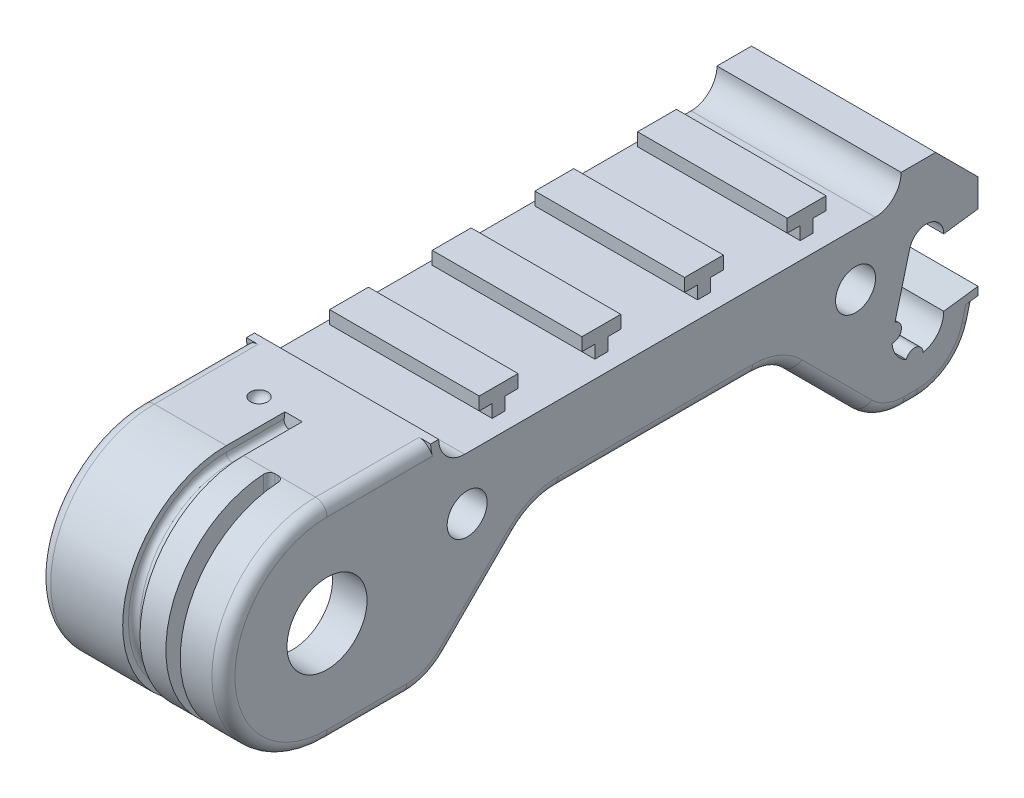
ISO-10303-21;
HEADER;
FILE_DESCRIPTION(('STEP AP214'),'2;1');
FILE_NAME('part.step','',(''),(''),'','','');
FILE_SCHEMA(('AUTOMOTIVE_DESIGN { 1 0 10303 214 1 1 1 1 }'));
ENDSEC;
DATA;
#1=APPLICATION_CONTEXT('core data for automotive mechanical design processes');
#2=APPLICATION_PROTOCOL_DEFINITION('international standard','automotive_design',2000,#1);
#3=PRODUCT_CONTEXT('',#1,'mechanical');
#4=PRODUCT('Part','Part','',(#3));
#5=PRODUCT_RELATED_PRODUCT_CATEGORY('part','',(#4));
#6=PRODUCT_DEFINITION_FORMATION('','',#4);
#7=PRODUCT_DEFINITION_CONTEXT('part definition',#1,'design');
#8=PRODUCT_DEFINITION('design','',#6,#7);
#9=PRODUCT_DEFINITION_SHAPE('','',#8);
#10=(LENGTH_UNIT() NAMED_UNIT(*) SI_UNIT(.MILLI.,.METRE.));
#11=(NAMED_UNIT(*) PLANE_ANGLE_UNIT() SI_UNIT($,.RADIAN.));
#12=(NAMED_UNIT(*) SI_UNIT($,.STERADIAN.) SOLID_ANGLE_UNIT());
#13=UNCERTAINTY_MEASURE_WITH_UNIT(LENGTH_MEASURE(1.E-05),#10,'distance_accuracy_value','');
#14=(GEOMETRIC_REPRESENTATION_CONTEXT(3) GLOBAL_UNCERTAINTY_ASSIGNED_CONTEXT((#13)) GLOBAL_UNIT_ASSIGNED_CONTEXT((#10,
#11,#12)) REPRESENTATION_CONTEXT('',''));
#15=CARTESIAN_POINT('',(0.,0.,0.));
#16=DIRECTION('',(0.,0.,1.));
#17=DIRECTION('',(1.,0.,0.));
#18=AXIS2_PLACEMENT_3D('',#15,#16,#17);
#19=CARTESIAN_POINT('',(-49.6758968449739,9.,-11.95));
#20=DIRECTION('',(1.,0.,0.));
#21=DIRECTION('',(0.,0.,-1.));
#22=AXIS2_PLACEMENT_3D('',#19,#20,#21);
#23=CYLINDRICAL_SURFACE('',#22,2.95);
#24=DIRECTION('',(1.,0.,0.));
#25=VECTOR('',#24,1.);
#26=CARTESIAN_POINT('',(-8.08521355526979,9.,-9.));
#27=LINE('',#26,#25);
#28=CARTESIAN_POINT('',(-8.,9.,-9.));
#29=VERTEX_POINT('',#28);
#30=CARTESIAN_POINT('',(-7.,9.,-9.));
#31=VERTEX_POINT('',#30);
#32=EDGE_CURVE('E710',#29,#31,#27,.T.);
#33=ORIENTED_EDGE('',*,*,#32,.F.);
#34=CARTESIAN_POINT('',(-8.,9.,-11.95));
#35=DIRECTION('',(1.,0.,0.));
#36=DIRECTION('',(0.,0.,-1.));
#37=AXIS2_PLACEMENT_3D('',#34,#35,#36);
#38=CIRCLE('',#37,2.95);
#39=CARTESIAN_POINT('',(-8.,8.,-9.17466218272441));
#40=VERTEX_POINT('',#39);
#41=EDGE_CURVE('E722',#40,#29,#38,.F.);
#42=ORIENTED_EDGE('',*,*,#41,.F.);
#43=CARTESIAN_POINT('',(-8.,8.,-9.17466218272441));
#44=CARTESIAN_POINT('',(-7.99999978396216,8.02632724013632,-9.16517418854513));
#45=CARTESIAN_POINT('',(-7.99895933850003,8.05278217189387,-9.15606773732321));
#46=CARTESIAN_POINT('',(-7.9947442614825,8.10579259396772,-9.13865322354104));
#47=CARTESIAN_POINT('',(-7.99156899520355,8.13234811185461,-9.13034539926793));
#48=CARTESIAN_POINT('',(-7.97876828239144,8.21186568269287,-9.10669402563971));
#49=CARTESIAN_POINT('',(-7.96586809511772,8.26472278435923,-9.0926067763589));
#50=CARTESIAN_POINT('',(-7.93126166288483,8.36844284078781,-9.06790162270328));
#51=CARTESIAN_POINT('',(-7.90953600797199,8.41930112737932,-9.05729145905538));
#52=CARTESIAN_POINT('',(-7.85769067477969,8.51713352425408,-9.0393622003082));
#53=CARTESIAN_POINT('',(-7.8275775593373,8.56411063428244,-9.03204054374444));
#54=CARTESIAN_POINT('',(-7.76073057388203,8.65132333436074,-9.02035674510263));
#55=CARTESIAN_POINT('',(-7.72421241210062,8.69171414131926,-9.01591542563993));
#56=CARTESIAN_POINT('',(-7.64498948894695,8.7661219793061,-9.00904769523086));
#57=CARTESIAN_POINT('',(-7.60228219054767,8.80013638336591,-9.00662211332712));
#58=CARTESIAN_POINT('',(-7.5113814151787,8.86111427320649,-9.00311056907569));
#59=CARTESIAN_POINT('',(-7.46313346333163,8.88799729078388,-9.00203942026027));
#60=CARTESIAN_POINT('',(-7.36287218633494,8.9334621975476,-9.00066261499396));
#61=CARTESIAN_POINT('',(-7.31086002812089,8.95204664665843,-9.0003567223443));
#62=CARTESIAN_POINT('',(-7.21569733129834,8.97742752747,-9.00006427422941));
#63=CARTESIAN_POINT('',(-7.1729801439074,8.9858800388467,-9.00002413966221));
#64=CARTESIAN_POINT('',(-7.0868468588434,8.99717062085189,-9.00000020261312));
#65=CARTESIAN_POINT('',(-7.0434313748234,9.0000133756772,-9.00001635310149));
#66=CARTESIAN_POINT('',(-7.,9.,-9.));
#67=B_SPLINE_CURVE_WITH_KNOTS('',3,(#43,#44,#45,#46,#47,#48,#49,#50,#51,#52,#53,#54,#55,#56,#57,
#58,#59,#60,#61,#62,#63,#64,#65,#66),.UNSPECIFIED.,.F.,.F.,(4,2,2,2,2,2,2,2,2,2,2,4),(0.,
0.0839111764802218,0.167847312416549,0.33558095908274,0.50368551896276,0.671658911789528,
0.834793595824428,0.997995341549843,1.16296701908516,1.32788777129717,1.45816811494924,
1.58833962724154),.UNSPECIFIED.);
#68=EDGE_CURVE('E44',#40,#31,#67,.T.);
#69=ORIENTED_EDGE('',*,*,#68,.T.);
#70=EDGE_LOOP('',(#33,#42,#69));
#71=FACE_BOUND('',#70,.T.);
#72=ADVANCED_FACE('F34',(#71),#23,.T.);
#73=CARTESIAN_POINT('',(8.,-3.61499550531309,-56.5464239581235));
#74=DIRECTION('',(0.,0.99144486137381,0.130526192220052));
#75=DIRECTION('',(0.,-0.130526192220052,0.99144486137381));
#76=AXIS2_PLACEMENT_3D('',#73,#74,#75);
#77=PLANE('',#76);
#78=DIRECTION('',(0.,0.130526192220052,-0.99144486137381));
#79=VECTOR('',#78,1.);
#80=CARTESIAN_POINT('',(-8.,-3.61499550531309,-56.5464239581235));
#81=LINE('',#80,#79);
#82=CARTESIAN_POINT('',(-8.,-3.7559634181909,-55.4756663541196));
#83=VERTEX_POINT('',#82);
#84=CARTESIAN_POINT('',(-8.,-3.61499550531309,-56.5464239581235));
#85=VERTEX_POINT('',#84);
#86=EDGE_CURVE('E792',#83,#85,#81,.T.);
#87=ORIENTED_EDGE('',*,*,#86,.T.);
#88=DIRECTION('',(1.,0.,0.));
#89=VECTOR('',#88,1.);
#90=CARTESIAN_POINT('',(-8.08521355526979,-3.61499550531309,-56.5464239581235));
#91=LINE('',#90,#89);
#92=CARTESIAN_POINT('',(-7.,-3.61499550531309,-56.5464239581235));
#93=VERTEX_POINT('',#92);
#94=EDGE_CURVE('E1580',#85,#93,#91,.T.);
#95=ORIENTED_EDGE('',*,*,#94,.T.);
#96=CARTESIAN_POINT('',(-7.,-3.7559634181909,-55.4756663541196));
#97=DIRECTION('',(0.,0.99144486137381,0.130526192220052));
#98=DIRECTION('',(0.,-0.130526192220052,0.99144486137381));
#99=AXIS2_PLACEMENT_3D('',#96,#97,#98);
#100=ELLIPSE('',#99,1.07999712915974,1.);
#101=EDGE_CURVE('E1104',#93,#83,#100,.T.);
#102=ORIENTED_EDGE('',*,*,#101,.T.);
#103=EDGE_LOOP('',(#87,#95,#102));
#104=FACE_BOUND('',#103,.T.);
#105=ADVANCED_FACE('F1185',(#104),#77,.F.);
#106=CARTESIAN_POINT('',(-5.,-9.,0.));
#107=DIRECTION('',(0.,0.,1.));
#108=DIRECTION('',(1.,0.,0.));
#109=AXIS2_PLACEMENT_3D('',#106,#107,#108);
#110=PLANE('',#109);
#111=DIRECTION('',(1.,0.,0.));
#112=VECTOR('',#111,1.);
#113=CARTESIAN_POINT('',(-5.,-9.,0.));
#114=LINE('',#113,#112);
#115=CARTESIAN_POINT('',(4.25,-9.,0.));
#116=VERTEX_POINT('',#115);
#117=CARTESIAN_POINT('',(5.,-9.,0.));
#118=VERTEX_POINT('',#117);
#119=EDGE_CURVE('E1277',#116,#118,#114,.T.);
#120=ORIENTED_EDGE('',*,*,#119,.F.);
#121=DIRECTION('',(0.,-1.,0.));
#122=VECTOR('',#121,1.);
#123=CARTESIAN_POINT('',(4.25,9.,0.));
#124=LINE('',#123,#122);
#125=CARTESIAN_POINT('',(4.25,-5.,0.));
#126=VERTEX_POINT('',#125);
#127=EDGE_CURVE('E1629',#126,#116,#124,.T.);
#128=ORIENTED_EDGE('',*,*,#127,.F.);
#129=DIRECTION('',(1.,0.,0.));
#130=VECTOR('',#129,1.);
#131=CARTESIAN_POINT('',(-5.,-5.,0.));
#132=LINE('',#131,#130);
#133=CARTESIAN_POINT('',(5.,-5.,0.));
#134=VERTEX_POINT('',#133);
#135=EDGE_CURVE('E1281',#126,#134,#132,.T.);
#136=ORIENTED_EDGE('',*,*,#135,.T.);
#137=DIRECTION('',(0.,-1.,0.));
#138=VECTOR('',#137,1.);
#139=CARTESIAN_POINT('',(5.,-9.,0.));
#140=LINE('',#139,#138);
#141=EDGE_CURVE('E1680',#134,#118,#140,.T.);
#142=ORIENTED_EDGE('',*,*,#141,.T.);
#143=EDGE_LOOP('',(#120,#128,#136,#142));
#144=FACE_BOUND('',#143,.T.);
#145=ADVANCED_FACE('F1706',(#144),#110,.F.);
#146=CARTESIAN_POINT('',(8.,0.,0.));
#147=DIRECTION('',(-1.,0.,0.));
#148=DIRECTION('',(0.,0.,1.));
#149=AXIS2_PLACEMENT_3D('',#146,#147,#148);
#150=CYLINDRICAL_SURFACE('',#149,9.);
#151=CARTESIAN_POINT('',(0.75,-9.,0.));
#152=VERTEX_POINT('',#151);
#153=CARTESIAN_POINT('',(2.5,-9.,0.));
#154=VERTEX_POINT('',#153);
#155=EDGE_CURVE('E1270',#152,#154,#114,.T.);
#156=ORIENTED_EDGE('',*,*,#155,.T.);
#157=CARTESIAN_POINT('',(2.5,-9.,0.));
#158=CARTESIAN_POINT('',(2.52812828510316,-8.99999624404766,-2.38896996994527E-05));
#159=CARTESIAN_POINT('',(2.55624944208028,-8.9999999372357,0.00237217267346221));
#160=CARTESIAN_POINT('',(2.6116749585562,-8.99999446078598,0.011827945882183));
#161=CARTESIAN_POINT('',(2.63897993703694,-8.99998530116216,0.0188840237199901));
#162=CARTESIAN_POINT('',(2.69202957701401,-8.99992642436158,0.0374885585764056));
#163=CARTESIAN_POINT('',(2.71777347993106,-8.99987668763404,0.0490391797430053));
#164=CARTESIAN_POINT('',(2.76695246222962,-8.99968695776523,0.0762947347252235));
#165=CARTESIAN_POINT('',(2.79038794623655,-8.99954698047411,0.0919989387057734));
#166=CARTESIAN_POINT('',(2.83428623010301,-8.99911932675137,0.127115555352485));
#167=CARTESIAN_POINT('',(2.85474944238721,-8.99883167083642,0.146527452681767));
#168=CARTESIAN_POINT('',(2.89212951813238,-8.99804995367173,0.188512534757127));
#169=CARTESIAN_POINT('',(2.90904573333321,-8.99755585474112,0.211086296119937));
#170=CARTESIAN_POINT('',(2.93884133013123,-8.99631160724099,0.25873682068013));
#171=CARTESIAN_POINT('',(2.95172212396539,-8.99556154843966,0.283812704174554));
#172=CARTESIAN_POINT('',(2.97308709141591,-8.99377236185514,0.335756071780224));
#173=CARTESIAN_POINT('',(2.98157374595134,-8.9927333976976,0.362622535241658));
#174=CARTESIAN_POINT('',(2.99182034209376,-8.99076349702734,0.408043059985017));
#175=CARTESIAN_POINT('',(2.9948863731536,-8.98991597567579,0.42631690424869));
#176=CARTESIAN_POINT('',(2.99897595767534,-8.98809866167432,0.463059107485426));
#177=CARTESIAN_POINT('',(3.00000243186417,-8.9871290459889,0.481527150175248));
#178=CARTESIAN_POINT('',(3.,-8.98610037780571,0.500000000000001));
#179=B_SPLINE_CURVE_WITH_KNOTS('',3,(#157,#158,#159,#160,#161,#162,#163,#164,#165,#166,#167,
#168,#169,#170,#171,#172,#173,#174,#175,#176,#177,#178),.UNSPECIFIED.,.F.,.F.,(4,2,2,2,2,2,2,2,
2,2,4),(0.,0.0842727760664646,0.168479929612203,0.252727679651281,0.336960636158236,
0.421181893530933,0.505418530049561,0.58962565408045,0.673785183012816,0.729324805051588,
0.784784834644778),.UNSPECIFIED.);
#180=CARTESIAN_POINT('',(3.,-8.98610037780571,0.5));
#181=VERTEX_POINT('',#180);
#182=EDGE_CURVE('E1201',#154,#181,#179,.T.);
#183=ORIENTED_EDGE('',*,*,#182,.T.);
#184=CARTESIAN_POINT('',(3.,0.,0.));
#185=DIRECTION('',(-1.,0.,0.));
#186=DIRECTION('',(0.,-1.,0.));
#187=AXIS2_PLACEMENT_3D('',#184,#185,#186);
#188=CIRCLE('',#187,9.);
#189=CARTESIAN_POINT('',(3.,8.98610037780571,0.5));
#190=VERTEX_POINT('',#189);
#191=EDGE_CURVE('E1635',#181,#190,#188,.T.);
#192=ORIENTED_EDGE('',*,*,#191,.T.);
#193=CARTESIAN_POINT('',(3.,8.98610037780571,0.5));
#194=CARTESIAN_POINT('',(2.9999758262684,8.98766793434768,0.47191899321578));
#195=CARTESIAN_POINT('',(3.00236423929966,8.9890935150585,0.443836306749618));
#196=CARTESIAN_POINT('',(3.01179637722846,8.99165352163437,0.3884713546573));
#197=CARTESIAN_POINT('',(3.01883656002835,8.99278816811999,0.361188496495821));
#198=CARTESIAN_POINT('',(3.03740776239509,8.99476202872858,0.308167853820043));
#199=CARTESIAN_POINT('',(3.04894115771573,8.99560108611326,0.28243089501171));
#200=CARTESIAN_POINT('',(3.07616375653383,8.99701035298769,0.233256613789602));
#201=CARTESIAN_POINT('',(3.09185216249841,8.9975806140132,0.20981885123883));
#202=CARTESIAN_POINT('',(3.12692848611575,8.99849720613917,0.165924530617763));
#203=CARTESIAN_POINT('',(3.14631336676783,8.99884372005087,0.145465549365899));
#204=CARTESIAN_POINT('',(3.18824587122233,8.99937043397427,0.108083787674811));
#205=CARTESIAN_POINT('',(3.21079413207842,8.99955060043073,0.091161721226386));
#206=CARTESIAN_POINT('',(3.25842071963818,8.99980343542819,0.0613318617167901));
#207=CARTESIAN_POINT('',(3.28350042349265,8.99987604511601,0.0484262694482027));
#208=CARTESIAN_POINT('',(3.33546496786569,8.9999658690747,0.0270129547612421));
#209=CARTESIAN_POINT('',(3.3623487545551,8.99998311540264,0.0185026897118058));
#210=CARTESIAN_POINT('',(3.40782844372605,8.99999717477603,0.00821847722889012));
#211=CARTESIAN_POINT('',(3.42613971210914,8.99999893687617,0.00513847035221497));
#212=CARTESIAN_POINT('',(3.46296477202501,9.00000000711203,0.00102945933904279));
#213=CARTESIAN_POINT('',(3.48147824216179,8.99999931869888,-2.42603688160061E-06));
#214=CARTESIAN_POINT('',(3.5,9.,0.));
#215=B_SPLINE_CURVE_WITH_KNOTS('',3,(#193,#194,#195,#196,#197,#198,#199,#200,#201,#202,#203,
#204,#205,#206,#207,#208,#209,#210,#211,#212,#213,#214),.UNSPECIFIED.,.F.,.F.,(4,2,2,2,2,2,2,2,
2,2,4),(0.,0.0842636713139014,0.168463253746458,0.252707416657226,0.336935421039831,
0.421094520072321,0.505270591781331,0.589492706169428,0.673666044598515,0.729264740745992,
0.784785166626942),.UNSPECIFIED.);
#216=CARTESIAN_POINT('',(3.5,9.,0.));
#217=VERTEX_POINT('',#216);
#218=EDGE_CURVE('E920',#190,#217,#215,.T.);
#219=ORIENTED_EDGE('',*,*,#218,.T.);
#220=DIRECTION('',(-1.,0.,0.));
#221=VECTOR('',#220,1.);
#222=CARTESIAN_POINT('',(8.,9.,0.));
#223=LINE('',#222,#221);
#224=CARTESIAN_POINT('',(0.75,9.,0.));
#225=VERTEX_POINT('',#224);
#226=EDGE_CURVE('E815',#217,#225,#223,.T.);
#227=ORIENTED_EDGE('',*,*,#226,.T.);
#228=CARTESIAN_POINT('',(0.75,0.,0.));
#229=DIRECTION('',(1.,0.,0.));
#230=DIRECTION('',(0.,0.,-1.));
#231=AXIS2_PLACEMENT_3D('',#228,#229,#230);
#232=CIRCLE('',#231,9.);
#233=EDGE_CURVE('E1276',#225,#152,#232,.T.);
#234=ORIENTED_EDGE('',*,*,#233,.T.);
#235=EDGE_LOOP('',(#156,#183,#192,#219,#227,#234));
#236=FACE_BOUND('',#235,.T.);
#237=ADVANCED_FACE('F1194',(#236),#150,.T.);
#238=CARTESIAN_POINT('',(-5.,0.,0.));
#239=DIRECTION('',(1.,0.,0.));
#240=DIRECTION('',(0.,0.,-1.));
#241=AXIS2_PLACEMENT_3D('',#238,#239,#240);
#242=CYLINDRICAL_SURFACE('',#241,5.);
#243=ORIENTED_EDGE('',*,*,#135,.F.);
#244=CARTESIAN_POINT('',(4.25,0.,0.));
#245=DIRECTION('',(1.,0.,0.));
#246=DIRECTION('',(0.,1.,0.));
#247=AXIS2_PLACEMENT_3D('',#244,#245,#246);
#248=CIRCLE('',#247,5.);
#249=CARTESIAN_POINT('',(4.25,4.9749371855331,0.5));
#250=VERTEX_POINT('',#249);
#251=EDGE_CURVE('E840',#126,#250,#248,.F.);
#252=ORIENTED_EDGE('',*,*,#251,.T.);
#253=CARTESIAN_POINT('',(4.25,4.9749371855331,0.5));
#254=CARTESIAN_POINT('',(4.25002479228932,4.97775775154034,0.472026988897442));
#255=CARTESIAN_POINT('',(4.24765383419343,4.9803240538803,0.444032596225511));
#256=CARTESIAN_POINT('',(4.23827589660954,4.98493450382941,0.388807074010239));
#257=CARTESIAN_POINT('',(4.23127219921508,4.98697901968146,0.361575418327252));
#258=CARTESIAN_POINT('',(4.21277795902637,4.99053743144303,0.308622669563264));
#259=CARTESIAN_POINT('',(4.2012845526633,4.99205098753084,0.282902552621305));
#260=CARTESIAN_POINT('',(4.17413926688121,4.99459404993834,0.233741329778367));
#261=CARTESIAN_POINT('',(4.15848833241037,4.99562366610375,0.21029970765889));
#262=CARTESIAN_POINT('',(4.12351336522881,4.99727777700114,0.166423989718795));
#263=CARTESIAN_POINT('',(4.10419907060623,4.99790332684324,0.145982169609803));
#264=CARTESIAN_POINT('',(4.06241255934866,4.99885522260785,0.108612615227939));
#265=CARTESIAN_POINT('',(4.03993966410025,4.99918150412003,0.0916856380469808));
#266=CARTESIAN_POINT('',(3.99244690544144,4.99964033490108,0.061813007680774));
#267=CARTESIAN_POINT('',(3.96742371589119,4.99977262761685,0.0488726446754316));
#268=CARTESIAN_POINT('',(3.91556696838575,4.99993668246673,0.0273751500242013));
#269=CARTESIAN_POINT('',(3.8887344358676,4.99996850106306,0.018815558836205));
#270=CARTESIAN_POINT('',(3.84312282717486,4.99999470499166,0.008390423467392));
#271=CARTESIAN_POINT('',(3.82462579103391,4.9999980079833,0.00524611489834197));
#272=CARTESIAN_POINT('',(3.78742172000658,5.00000001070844,0.0010510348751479));
#273=CARTESIAN_POINT('',(3.76871500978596,4.99999871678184,-2.61681069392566E-06));
#274=CARTESIAN_POINT('',(3.75,5.,0.));
#275=B_SPLINE_CURVE_WITH_KNOTS('',3,(#253,#254,#255,#256,#257,#258,#259,#260,#261,#262,#263,
#264,#265,#266,#267,#268,#269,#270,#271,#272,#273,#274),.UNSPECIFIED.,.F.,.F.,(4,2,2,2,2,2,2,2,
2,2,4),(0.,0.0842376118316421,0.168415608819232,0.252647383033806,0.336860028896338,
0.420851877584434,0.504861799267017,0.588982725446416,0.673056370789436,0.729233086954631,
0.785332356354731),.UNSPECIFIED.);
#276=CARTESIAN_POINT('',(3.75,5.,0.));
#277=VERTEX_POINT('',#276);
#278=EDGE_CURVE('E889',#250,#277,#275,.T.);
#279=ORIENTED_EDGE('',*,*,#278,.T.);
#280=DIRECTION('',(1.,0.,0.));
#281=VECTOR('',#280,1.);
#282=CARTESIAN_POINT('',(-5.,5.,0.));
#283=LINE('',#282,#281);
#284=CARTESIAN_POINT('',(5.,5.,0.));
#285=VERTEX_POINT('',#284);
#286=EDGE_CURVE('E1279',#277,#285,#283,.T.);
#287=ORIENTED_EDGE('',*,*,#286,.T.);
#288=CARTESIAN_POINT('',(5.,0.,0.));
#289=DIRECTION('',(1.,0.,0.));
#290=DIRECTION('',(0.,0.,-1.));
#291=AXIS2_PLACEMENT_3D('',#288,#289,#290);
#292=CIRCLE('',#291,5.);
#293=EDGE_CURVE('E1660',#285,#134,#292,.T.);
#294=ORIENTED_EDGE('',*,*,#293,.T.);
#295=EDGE_LOOP('',(#243,#252,#279,#287,#294));
#296=FACE_BOUND('',#295,.T.);
#297=ADVANCED_FACE('F880',(#296),#242,.F.);
#298=CARTESIAN_POINT('',(8.,9.,0.));
#299=DIRECTION('',(0.,-1.,0.));
#300=DIRECTION('',(0.,0.,-1.));
#301=AXIS2_PLACEMENT_3D('',#298,#299,#300);
#302=PLANE('',#301);
#303=CARTESIAN_POINT('',(-3.,9.,-5.0936117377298));
#304=DIRECTION('',(0.,1.,0.));
#305=DIRECTION('',(0.,0.,1.));
#306=AXIS2_PLACEMENT_3D('',#303,#304,#305);
#307=CIRCLE('',#306,0.75);
#308=CARTESIAN_POINT('',(-3.,9.,-4.34361173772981));
#309=VERTEX_POINT('',#308);
#310=EDGE_CURVE('E1626',#309,#309,#307,.T.);
#311=ORIENTED_EDGE('',*,*,#310,.F.);
#312=EDGE_LOOP('',(#311));
#313=FACE_BOUND('',#312,.T.);
#314=DIRECTION('',(0.,0.,1.));
#315=VECTOR('',#314,1.);
#316=CARTESIAN_POINT('',(7.,9.,-9.));
#317=LINE('',#316,#315);
#318=CARTESIAN_POINT('',(7.,9.,0.));
#319=VERTEX_POINT('',#318);
#320=CARTESIAN_POINT('',(7.,9.,-9.));
#321=VERTEX_POINT('',#320);
#322=EDGE_CURVE('E706',#319,#321,#317,.F.);
#323=ORIENTED_EDGE('',*,*,#322,.T.);
#324=CARTESIAN_POINT('',(8.,9.,-9.));
#325=VERTEX_POINT('',#324);
#326=EDGE_CURVE('E702',#321,#325,#27,.T.);
#327=ORIENTED_EDGE('',*,*,#326,.T.);
#328=DIRECTION('',(0.,0.,-1.));
#329=VECTOR('',#328,1.);
#330=CARTESIAN_POINT('',(8.,9.,0.));
#331=LINE('',#330,#329);
#332=CARTESIAN_POINT('',(8.,9.,-9.7));
#333=VERTEX_POINT('',#332);
#334=EDGE_CURVE('E52',#325,#333,#331,.T.);
#335=ORIENTED_EDGE('',*,*,#334,.T.);
#336=DIRECTION('',(1.,0.,0.));
#337=VECTOR('',#336,1.);
#338=CARTESIAN_POINT('',(-8.,9.,-9.7));
#339=LINE('',#338,#337);
#340=CARTESIAN_POINT('',(-8.,9.,-9.7));
#341=VERTEX_POINT('',#340);
#342=EDGE_CURVE('E1570',#341,#333,#339,.T.);
#343=ORIENTED_EDGE('',*,*,#342,.F.);
#344=DIRECTION('',(0.,0.,-1.));
#345=VECTOR('',#344,1.);
#346=CARTESIAN_POINT('',(-8.,9.,0.));
#347=LINE('',#346,#345);
#348=EDGE_CURVE('E1568',#29,#341,#347,.T.);
#349=ORIENTED_EDGE('',*,*,#348,.F.);
#350=ORIENTED_EDGE('',*,*,#32,.T.);
#351=DIRECTION('',(0.,0.,1.));
#352=VECTOR('',#351,1.);
#353=CARTESIAN_POINT('',(-7.,9.,0.));
#354=LINE('',#353,#352);
#355=CARTESIAN_POINT('',(-7.,9.,0.));
#356=VERTEX_POINT('',#355);
#357=EDGE_CURVE('E1102',#31,#356,#354,.T.);
#358=ORIENTED_EDGE('',*,*,#357,.T.);
#359=CARTESIAN_POINT('',(-0.75,9.,0.));
#360=VERTEX_POINT('',#359);
#361=EDGE_CURVE('E805',#360,#356,#223,.T.);
#362=ORIENTED_EDGE('',*,*,#361,.F.);
#363=DIRECTION('',(0.,0.,1.));
#364=VECTOR('',#363,1.);
#365=CARTESIAN_POINT('',(-0.75,9.,-5.0936117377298));
#366=LINE('',#365,#364);
#367=CARTESIAN_POINT('',(-0.75,9.,-5.0936117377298));
#368=VERTEX_POINT('',#367);
#369=EDGE_CURVE('E1640',#368,#360,#366,.T.);
#370=ORIENTED_EDGE('',*,*,#369,.F.);
#371=DIRECTION('',(1.,0.,0.));
#372=VECTOR('',#371,1.);
#373=CARTESIAN_POINT('',(-0.75,9.,-5.0936117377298));
#374=LINE('',#373,#372);
#375=CARTESIAN_POINT('',(0.75,9.,-5.0936117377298));
#376=VERTEX_POINT('',#375);
#377=EDGE_CURVE('E1657',#368,#376,#374,.T.);
#378=ORIENTED_EDGE('',*,*,#377,.T.);
#379=DIRECTION('',(0.,0.,1.));
#380=VECTOR('',#379,1.);
#381=CARTESIAN_POINT('',(0.75,9.,-5.0936117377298));
#382=LINE('',#381,#380);
#383=EDGE_CURVE('E1639',#376,#225,#382,.T.);
#384=ORIENTED_EDGE('',*,*,#383,.T.);
#385=ORIENTED_EDGE('',*,*,#226,.F.);
#386=DIRECTION('',(1.,0.,0.));
#387=VECTOR('',#386,1.);
#388=CARTESIAN_POINT('',(4.25,9.,0.));
#389=LINE('',#388,#387);
#390=CARTESIAN_POINT('',(3.75,9.,0.));
#391=VERTEX_POINT('',#390);
#392=EDGE_CURVE('E1632',#217,#391,#389,.T.);
#393=ORIENTED_EDGE('',*,*,#392,.T.);
#394=EDGE_CURVE('E812',#319,#391,#223,.T.);
#395=ORIENTED_EDGE('',*,*,#394,.F.);
#396=EDGE_LOOP('',(#323,#327,#335,#343,#349,#350,#358,#362,#370,#378,#384,#385,#393,#395));
#397=FACE_BOUND('',#396,.T.);
#398=ADVANCED_FACE('F703',(#313,#397),#302,.F.);
#399=ORIENTED_EDGE('',*,*,#361,.T.);
#400=CARTESIAN_POINT('',(-7.,0.,0.));
#401=DIRECTION('',(1.,0.,0.));
#402=DIRECTION('',(0.,0.,-1.));
#403=AXIS2_PLACEMENT_3D('',#400,#401,#402);
#404=CIRCLE('',#403,9.);
#405=CARTESIAN_POINT('',(-7.,-9.,0.));
#406=VERTEX_POINT('',#405);
#407=EDGE_CURVE('E1056',#356,#406,#404,.T.);
#408=ORIENTED_EDGE('',*,*,#407,.T.);
#409=DIRECTION('',(-1.,0.,0.));
#410=VECTOR('',#409,1.);
#411=CARTESIAN_POINT('',(8.,-9.,0.));
#412=LINE('',#411,#410);
#413=CARTESIAN_POINT('',(-5.,-9.,0.));
#414=VERTEX_POINT('',#413);
#415=EDGE_CURVE('E817',#414,#406,#412,.T.);
#416=ORIENTED_EDGE('',*,*,#415,.F.);
#417=CARTESIAN_POINT('',(-0.75,-9.,0.));
#418=VERTEX_POINT('',#417);
#419=EDGE_CURVE('E1257',#414,#418,#114,.T.);
#420=ORIENTED_EDGE('',*,*,#419,.T.);
#421=CARTESIAN_POINT('',(-0.75,0.,0.));
#422=DIRECTION('',(1.,0.,0.));
#423=DIRECTION('',(0.,0.,-1.));
#424=AXIS2_PLACEMENT_3D('',#421,#422,#423);
#425=CIRCLE('',#424,9.);
#426=EDGE_CURVE('E1642',#360,#418,#425,.T.);
#427=ORIENTED_EDGE('',*,*,#426,.F.);
#428=EDGE_LOOP('',(#399,#408,#416,#420,#427));
#429=FACE_BOUND('',#428,.T.);
#430=ADVANCED_FACE('F1195',(#429),#150,.T.);
#431=DIRECTION('',(0.,-1.,0.));
#432=VECTOR('',#431,1.);
#433=CARTESIAN_POINT('',(-5.,-9.,0.));
#434=LINE('',#433,#432);
#435=CARTESIAN_POINT('',(-5.,-5.47722557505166,0.));
#436=VERTEX_POINT('',#435);
#437=EDGE_CURVE('E1247',#436,#414,#434,.T.);
#438=ORIENTED_EDGE('',*,*,#437,.F.);
#439=DIRECTION('',(1.,0.,0.));
#440=VECTOR('',#439,1.);
#441=CARTESIAN_POINT('',(-5.,-5.47722557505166,0.));
#442=LINE('',#441,#440);
#443=CARTESIAN_POINT('',(2.5,-5.47722557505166,0.));
#444=VERTEX_POINT('',#443);
#445=EDGE_CURVE('E856',#436,#444,#442,.T.);
#446=ORIENTED_EDGE('',*,*,#445,.T.);
#447=DIRECTION('',(0.,1.,0.));
#448=VECTOR('',#447,1.);
#449=CARTESIAN_POINT('',(2.5,-9.,0.));
#450=LINE('',#449,#448);
#451=EDGE_CURVE('E854',#444,#154,#450,.F.);
#452=ORIENTED_EDGE('',*,*,#451,.T.);
#453=ORIENTED_EDGE('',*,*,#155,.F.);
#454=DIRECTION('',(0.,1.,0.));
#455=VECTOR('',#454,1.);
#456=CARTESIAN_POINT('',(0.75,-8.,0.));
#457=LINE('',#456,#455);
#458=CARTESIAN_POINT('',(0.75,-8.5,0.));
#459=VERTEX_POINT('',#458);
#460=EDGE_CURVE('E1654',#152,#459,#457,.T.);
#461=ORIENTED_EDGE('',*,*,#460,.T.);
#462=CARTESIAN_POINT('',(0.25,-8.5,0.));
#463=DIRECTION('',(0.,0.,1.));
#464=DIRECTION('',(1.,0.,0.));
#465=AXIS2_PLACEMENT_3D('',#462,#463,#464);
#466=CIRCLE('',#465,0.5);
#467=CARTESIAN_POINT('',(0.25,-8.,0.));
#468=VERTEX_POINT('',#467);
#469=EDGE_CURVE('E929',#459,#468,#466,.T.);
#470=ORIENTED_EDGE('',*,*,#469,.T.);
#471=DIRECTION('',(1.,0.,0.));
#472=VECTOR('',#471,1.);
#473=CARTESIAN_POINT('',(-0.75,-8.,0.));
#474=LINE('',#473,#472);
#475=CARTESIAN_POINT('',(-0.25,-8.,0.));
#476=VERTEX_POINT('',#475);
#477=EDGE_CURVE('E1650',#476,#468,#474,.T.);
#478=ORIENTED_EDGE('',*,*,#477,.F.);
#479=CARTESIAN_POINT('',(-0.25,-8.5,0.));
#480=DIRECTION('',(0.,0.,1.));
#481=DIRECTION('',(1.,0.,0.));
#482=AXIS2_PLACEMENT_3D('',#479,#480,#481);
#483=CIRCLE('',#482,0.5);
#484=CARTESIAN_POINT('',(-0.75,-8.5,0.));
#485=VERTEX_POINT('',#484);
#486=EDGE_CURVE('E931',#476,#485,#483,.T.);
#487=ORIENTED_EDGE('',*,*,#486,.T.);
#488=DIRECTION('',(0.,1.,0.));
#489=VECTOR('',#488,1.);
#490=CARTESIAN_POINT('',(-0.75,-8.,0.));
#491=LINE('',#490,#489);
#492=EDGE_CURVE('E1645',#418,#485,#491,.T.);
#493=ORIENTED_EDGE('',*,*,#492,.F.);
#494=ORIENTED_EDGE('',*,*,#419,.F.);
#495=EDGE_LOOP('',(#438,#446,#452,#453,#461,#470,#478,#487,#493,#494));
#496=FACE_BOUND('',#495,.T.);
#497=ADVANCED_FACE('F881',(#496),#110,.F.);
#498=CARTESIAN_POINT('',(8.,-9.,0.));
#499=DIRECTION('',(0.,1.,0.));
#500=DIRECTION('',(0.,0.,1.));
#501=AXIS2_PLACEMENT_3D('',#498,#499,#500);
#502=PLANE('',#501);
#503=ORIENTED_EDGE('',*,*,#415,.T.);
#504=DIRECTION('',(0.,0.,-1.));
#505=VECTOR('',#504,1.);
#506=CARTESIAN_POINT('',(-7.,-9.,0.));
#507=LINE('',#506,#505);
#508=CARTESIAN_POINT('',(-7.,-9.,-6.92893218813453));
#509=VERTEX_POINT('',#508);
#510=EDGE_CURVE('E1058',#406,#509,#507,.T.);
#511=ORIENTED_EDGE('',*,*,#510,.T.);
#512=DIRECTION('',(1.,0.,0.));
#513=VECTOR('',#512,1.);
#514=CARTESIAN_POINT('',(-5.,-9.,-6.92893218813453));
#515=LINE('',#514,#513);
#516=CARTESIAN_POINT('',(-5.,-9.,-6.92893218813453));
#517=VERTEX_POINT('',#516);
#518=EDGE_CURVE('E979',#509,#517,#515,.T.);
#519=ORIENTED_EDGE('',*,*,#518,.T.);
#520=DIRECTION('',(0.,0.,-1.));
#521=VECTOR('',#520,1.);
#522=CARTESIAN_POINT('',(-5.,-9.,0.));
#523=LINE('',#522,#521);
#524=EDGE_CURVE('E1259',#414,#517,#523,.T.);
#525=ORIENTED_EDGE('',*,*,#524,.F.);
#526=EDGE_LOOP('',(#503,#511,#519,#525));
#527=FACE_BOUND('',#526,.T.);
#528=ADVANCED_FACE('F1189',(#527),#502,.F.);
#529=CARTESIAN_POINT('',(-8.,19.5232119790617,-19.5232119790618));
#530=DIRECTION('',(0.,-0.707106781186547,0.707106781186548));
#531=DIRECTION('',(0.,-0.707106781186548,-0.707106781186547));
#532=AXIS2_PLACEMENT_3D('',#529,#530,#531);
#533=PLANE('',#532);
#534=DIRECTION('',(1.,0.,0.));
#535=VECTOR('',#534,1.);
#536=CARTESIAN_POINT('',(-8.,-1.46446609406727,-40.5108900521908));
#537=LINE('',#536,#535);
#538=CARTESIAN_POINT('',(-5.,-1.46446609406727,-40.5108900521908));
#539=VERTEX_POINT('',#538);
#540=CARTESIAN_POINT('',(-7.,-1.46446609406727,-40.5108900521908));
#541=VERTEX_POINT('',#540);
#542=EDGE_CURVE('E953',#539,#541,#537,.F.);
#543=ORIENTED_EDGE('',*,*,#542,.T.);
#544=DIRECTION('',(0.,-0.707106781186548,-0.707106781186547));
#545=VECTOR('',#544,1.);
#546=CARTESIAN_POINT('',(-7.,-7.53553390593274,-46.5819578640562));
#547=LINE('',#546,#545);
#548=CARTESIAN_POINT('',(-7.,-7.53553390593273,-46.5819578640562));
#549=VERTEX_POINT('',#548);
#550=EDGE_CURVE('E1072',#541,#549,#547,.T.);
#551=ORIENTED_EDGE('',*,*,#550,.T.);
#552=DIRECTION('',(1.,0.,0.));
#553=VECTOR('',#552,1.);
#554=CARTESIAN_POINT('',(8.,-7.53553390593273,-46.5819578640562));
#555=LINE('',#554,#553);
#556=CARTESIAN_POINT('',(7.,-7.53553390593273,-46.5819578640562));
#557=VERTEX_POINT('',#556);
#558=EDGE_CURVE('E956',#549,#557,#555,.T.);
#559=ORIENTED_EDGE('',*,*,#558,.T.);
#560=DIRECTION('',(0.,-0.707106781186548,-0.707106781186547));
#561=VECTOR('',#560,1.);
#562=CARTESIAN_POINT('',(7.,19.5232119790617,-19.5232119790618));
#563=LINE('',#562,#561);
#564=CARTESIAN_POINT('',(7.,-1.46446609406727,-40.5108900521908));
#565=VERTEX_POINT('',#564);
#566=EDGE_CURVE('E1070',#557,#565,#563,.F.);
#567=ORIENTED_EDGE('',*,*,#566,.T.);
#568=DIRECTION('',(1.,0.,0.));
#569=VECTOR('',#568,1.);
#570=CARTESIAN_POINT('',(5.,-1.46446609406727,-40.5108900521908));
#571=LINE('',#570,#569);
#572=CARTESIAN_POINT('',(5.,-1.46446609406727,-40.5108900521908));
#573=VERTEX_POINT('',#572);
#574=EDGE_CURVE('E951',#565,#573,#571,.F.);
#575=ORIENTED_EDGE('',*,*,#574,.T.);
#576=DIRECTION('',(0.,0.707106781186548,0.707106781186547));
#577=VECTOR('',#576,1.);
#578=CARTESIAN_POINT('',(5.,19.5232119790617,-19.5232119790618));
#579=LINE('',#578,#577);
#580=CARTESIAN_POINT('',(5.,-5.69366369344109,-44.7400876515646));
#581=VERTEX_POINT('',#580);
#582=EDGE_CURVE('E1291',#581,#573,#579,.T.);
#583=ORIENTED_EDGE('',*,*,#582,.F.);
#584=DIRECTION('',(1.,0.,0.));
#585=VECTOR('',#584,1.);
#586=CARTESIAN_POINT('',(-8.,-5.69366369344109,-44.7400876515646));
#587=LINE('',#586,#585);
#588=CARTESIAN_POINT('',(-5.,-5.69366369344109,-44.7400876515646));
#589=VERTEX_POINT('',#588);
#590=EDGE_CURVE('E835',#589,#581,#587,.T.);
#591=ORIENTED_EDGE('',*,*,#590,.F.);
#592=DIRECTION('',(0.,0.707106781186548,0.707106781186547));
#593=VECTOR('',#592,1.);
#594=CARTESIAN_POINT('',(-5.,19.5232119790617,-19.5232119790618));
#595=LINE('',#594,#593);
#596=EDGE_CURVE('E1297',#589,#539,#595,.T.);
#597=ORIENTED_EDGE('',*,*,#596,.T.);
#598=EDGE_LOOP('',(#543,#551,#559,#567,#575,#583,#591,#597));
#599=FACE_BOUND('',#598,.T.);
#600=ADVANCED_FACE('F1130',(#599),#533,.T.);
#601=CARTESIAN_POINT('',(-8.,-9.,-9.));
#602=DIRECTION('',(0.,-0.707106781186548,-0.707106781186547));
#603=DIRECTION('',(0.,0.707106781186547,-0.707106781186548));
#604=AXIS2_PLACEMENT_3D('',#601,#602,#603);
#605=PLANE('',#604);
#606=DIRECTION('',(1.,0.,0.));
#607=VECTOR('',#606,1.);
#608=CARTESIAN_POINT('',(-8.,-7.53553390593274,-10.4644660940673));
#609=LINE('',#608,#607);
#610=CARTESIAN_POINT('',(-5.,-7.53553390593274,-10.4644660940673));
#611=VERTEX_POINT('',#610);
#612=CARTESIAN_POINT('',(-7.,-7.53553390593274,-10.4644660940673));
#613=VERTEX_POINT('',#612);
#614=EDGE_CURVE('E974',#611,#613,#609,.F.);
#615=ORIENTED_EDGE('',*,*,#614,.T.);
#616=DIRECTION('',(0.,0.707106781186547,-0.707106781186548));
#617=VECTOR('',#616,1.);
#618=CARTESIAN_POINT('',(-7.,-1.46446609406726,-16.5355339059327));
#619=LINE('',#618,#617);
#620=CARTESIAN_POINT('',(-7.,-1.46446609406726,-16.5355339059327));
#621=VERTEX_POINT('',#620);
#622=EDGE_CURVE('E1062',#613,#621,#619,.T.);
#623=ORIENTED_EDGE('',*,*,#622,.T.);
#624=DIRECTION('',(1.,0.,0.));
#625=VECTOR('',#624,1.);
#626=CARTESIAN_POINT('',(-5.,-1.46446609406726,-16.5355339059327));
#627=LINE('',#626,#625);
#628=CARTESIAN_POINT('',(-5.,-1.46446609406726,-16.5355339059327));
#629=VERTEX_POINT('',#628);
#630=EDGE_CURVE('E977',#621,#629,#627,.T.);
#631=ORIENTED_EDGE('',*,*,#630,.T.);
#632=DIRECTION('',(0.,-0.707106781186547,0.707106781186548));
#633=VECTOR('',#632,1.);
#634=CARTESIAN_POINT('',(-5.,-9.,-9.));
#635=LINE('',#634,#633);
#636=EDGE_CURVE('E1294',#629,#611,#635,.T.);
#637=ORIENTED_EDGE('',*,*,#636,.T.);
#638=EDGE_LOOP('',(#615,#623,#631,#637));
#639=FACE_BOUND('',#638,.T.);
#640=ADVANCED_FACE('F1756',(#639),#605,.T.);
#641=CARTESIAN_POINT('',(-8.,0.,0.));
#642=DIRECTION('',(0.,-1.,0.));
#643=DIRECTION('',(0.,0.,-1.));
#644=AXIS2_PLACEMENT_3D('',#641,#642,#643);
#645=PLANE('',#644);
#646=DIRECTION('',(1.,0.,0.));
#647=VECTOR('',#646,1.);
#648=CARTESIAN_POINT('',(-8.,0.,-20.0710678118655));
#649=LINE('',#648,#647);
#650=CARTESIAN_POINT('',(-5.,0.,-20.0710678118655));
#651=VERTEX_POINT('',#650);
#652=CARTESIAN_POINT('',(-7.,0.,-20.0710678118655));
#653=VERTEX_POINT('',#652);
#654=EDGE_CURVE('E959',#651,#653,#649,.F.);
#655=ORIENTED_EDGE('',*,*,#654,.T.);
#656=DIRECTION('',(0.,0.,-1.));
#657=VECTOR('',#656,1.);
#658=CARTESIAN_POINT('',(-7.,0.,-36.975356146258));
#659=LINE('',#658,#657);
#660=CARTESIAN_POINT('',(-7.,0.,-36.975356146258));
#661=VERTEX_POINT('',#660);
#662=EDGE_CURVE('E1066',#653,#661,#659,.T.);
#663=ORIENTED_EDGE('',*,*,#662,.T.);
#664=DIRECTION('',(1.,0.,0.));
#665=VECTOR('',#664,1.);
#666=CARTESIAN_POINT('',(-5.,0.,-36.975356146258));
#667=LINE('',#666,#665);
#668=CARTESIAN_POINT('',(-5.,0.,-36.975356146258));
#669=VERTEX_POINT('',#668);
#670=EDGE_CURVE('E962',#661,#669,#667,.T.);
#671=ORIENTED_EDGE('',*,*,#670,.T.);
#672=DIRECTION('',(0.,0.,1.));
#673=VECTOR('',#672,1.);
#674=CARTESIAN_POINT('',(-5.,0.,0.));
#675=LINE('',#674,#673);
#676=EDGE_CURVE('E832',#669,#651,#675,.T.);
#677=ORIENTED_EDGE('',*,*,#676,.T.);
#678=EDGE_LOOP('',(#655,#663,#671,#677));
#679=FACE_BOUND('',#678,.T.);
#680=ADVANCED_FACE('F1767',(#679),#645,.T.);
#681=CARTESIAN_POINT('',(-8.,6.75,-11.95));
#682=DIRECTION('',(0.,-1.,0.));
#683=DIRECTION('',(0.,0.,-1.));
#684=AXIS2_PLACEMENT_3D('',#681,#682,#683);
#685=PLANE('',#684);
#686=DIRECTION('',(-1.,0.,0.));
#687=VECTOR('',#686,1.);
#688=CARTESIAN_POINT('',(6.5,6.75,-43.7249390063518));
#689=LINE('',#688,#687);
#690=CARTESIAN_POINT('',(6.5,6.74999999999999,-43.7249390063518));
#691=VERTEX_POINT('',#690);
#692=CARTESIAN_POINT('',(-6.5,6.74999999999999,-43.7249390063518));
#693=VERTEX_POINT('',#692);
#694=EDGE_CURVE('E1340',#691,#693,#689,.T.);
#695=ORIENTED_EDGE('',*,*,#694,.F.);
#696=DIRECTION('',(0.,0.,-1.));
#697=VECTOR('',#696,1.);
#698=CARTESIAN_POINT('',(6.5,6.75,-42.5999390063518));
#699=LINE('',#698,#697);
#700=CARTESIAN_POINT('',(6.5,6.74999999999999,-42.5999390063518));
#701=VERTEX_POINT('',#700);
#702=EDGE_CURVE('E1316',#701,#691,#699,.T.);
#703=ORIENTED_EDGE('',*,*,#702,.F.);
#704=DIRECTION('',(-1.,0.,0.));
#705=VECTOR('',#704,1.);
#706=CARTESIAN_POINT('',(6.5,6.75,-42.5999390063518));
#707=LINE('',#706,#705);
#708=CARTESIAN_POINT('',(-6.5,6.75,-42.5999390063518));
#709=VERTEX_POINT('',#708);
#710=EDGE_CURVE('E1343',#701,#709,#707,.T.);
#711=ORIENTED_EDGE('',*,*,#710,.T.);
#712=DIRECTION('',(0.,0.,-1.));
#713=VECTOR('',#712,1.);
#714=CARTESIAN_POINT('',(-6.5,6.75,-42.5999390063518));
#715=LINE('',#714,#713);
#716=EDGE_CURVE('E1335',#709,#693,#715,.T.);
#717=ORIENTED_EDGE('',*,*,#716,.T.);
#718=EDGE_LOOP('',(#695,#703,#711,#717));
#719=FACE_BOUND('',#718,.T.);
#720=DIRECTION('',(0.,0.,-1.));
#721=VECTOR('',#720,1.);
#722=CARTESIAN_POINT('',(6.5,6.75,-16.9714198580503));
#723=LINE('',#722,#721);
#724=CARTESIAN_POINT('',(6.5,6.75,-15.8464198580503));
#725=VERTEX_POINT('',#724);
#726=CARTESIAN_POINT('',(6.5,6.75,-16.9714198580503));
#727=VERTEX_POINT('',#726);
#728=EDGE_CURVE('E1488',#725,#727,#723,.T.);
#729=ORIENTED_EDGE('',*,*,#728,.F.);
#730=DIRECTION('',(-1.,0.,0.));
#731=VECTOR('',#730,1.);
#732=CARTESIAN_POINT('',(6.5,6.75,-15.8464198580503));
#733=LINE('',#732,#731);
#734=CARTESIAN_POINT('',(-6.5,6.75,-15.8464198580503));
#735=VERTEX_POINT('',#734);
#736=EDGE_CURVE('E1529',#725,#735,#733,.T.);
#737=ORIENTED_EDGE('',*,*,#736,.T.);
#738=DIRECTION('',(0.,0.,-1.));
#739=VECTOR('',#738,1.);
#740=CARTESIAN_POINT('',(-6.5,6.75,-16.9714198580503));
#741=LINE('',#740,#739);
#742=CARTESIAN_POINT('',(-6.5,6.75,-16.9714198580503));
#743=VERTEX_POINT('',#742);
#744=EDGE_CURVE('E1505',#735,#743,#741,.T.);
#745=ORIENTED_EDGE('',*,*,#744,.T.);
#746=DIRECTION('',(-1.,0.,0.));
#747=VECTOR('',#746,1.);
#748=CARTESIAN_POINT('',(6.5,6.75,-16.9714198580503));
#749=LINE('',#748,#747);
#750=EDGE_CURVE('E1526',#727,#743,#749,.T.);
#751=ORIENTED_EDGE('',*,*,#750,.F.);
#752=EDGE_LOOP('',(#729,#737,#745,#751));
#753=FACE_BOUND('',#752,.T.);
#754=DIRECTION('',(0.,0.,-1.));
#755=VECTOR('',#754,1.);
#756=CARTESIAN_POINT('',(8.,6.75,-11.95));
#757=LINE('',#756,#755);
#758=CARTESIAN_POINT('',(8.,6.75,-11.95));
#759=VERTEX_POINT('',#758);
#760=CARTESIAN_POINT('',(8.,6.74999999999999,-47.6213588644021));
#761=VERTEX_POINT('',#760);
#762=EDGE_CURVE('E1548',#759,#761,#757,.T.);
#763=ORIENTED_EDGE('',*,*,#762,.T.);
#764=DIRECTION('',(1.,0.,0.));
#765=VECTOR('',#764,1.);
#766=CARTESIAN_POINT('',(-8.,6.74999999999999,-47.6213588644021));
#767=LINE('',#766,#765);
#768=CARTESIAN_POINT('',(-8.,6.74999999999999,-47.6213588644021));
#769=VERTEX_POINT('',#768);
#770=EDGE_CURVE('E723',#769,#761,#767,.T.);
#771=ORIENTED_EDGE('',*,*,#770,.F.);
#772=DIRECTION('',(0.,0.,-1.));
#773=VECTOR('',#772,1.);
#774=CARTESIAN_POINT('',(-8.,6.75,-11.95));
#775=LINE('',#774,#773);
#776=CARTESIAN_POINT('',(-8.,6.75,-11.95));
#777=VERTEX_POINT('',#776);
#778=EDGE_CURVE('E1540',#777,#769,#775,.T.);
#779=ORIENTED_EDGE('',*,*,#778,.F.);
#780=DIRECTION('',(1.,0.,0.));
#781=VECTOR('',#780,1.);
#782=CARTESIAN_POINT('',(-8.,6.75,-11.95));
#783=LINE('',#782,#781);
#784=EDGE_CURVE('E728',#777,#759,#783,.T.);
#785=ORIENTED_EDGE('',*,*,#784,.T.);
#786=EDGE_LOOP('',(#763,#771,#779,#785));
#787=FACE_BOUND('',#786,.T.);
#788=DIRECTION('',(-1.,0.,0.));
#789=VECTOR('',#788,1.);
#790=CARTESIAN_POINT('',(6.5,6.75,-25.8892595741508));
#791=LINE('',#790,#789);
#792=CARTESIAN_POINT('',(6.5,6.75,-25.8892595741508));
#793=VERTEX_POINT('',#792);
#794=CARTESIAN_POINT('',(-6.5,6.75,-25.8892595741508));
#795=VERTEX_POINT('',#794);
#796=EDGE_CURVE('E1459',#793,#795,#791,.T.);
#797=ORIENTED_EDGE('',*,*,#796,.F.);
#798=DIRECTION('',(0.,0.,-1.));
#799=VECTOR('',#798,1.);
#800=CARTESIAN_POINT('',(6.5,6.75,-24.7642595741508));
#801=LINE('',#800,#799);
#802=CARTESIAN_POINT('',(6.5,6.75,-24.7642595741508));
#803=VERTEX_POINT('',#802);
#804=EDGE_CURVE('E1435',#803,#793,#801,.T.);
#805=ORIENTED_EDGE('',*,*,#804,.F.);
#806=DIRECTION('',(-1.,0.,0.));
#807=VECTOR('',#806,1.);
#808=CARTESIAN_POINT('',(6.5,6.75,-24.7642595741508));
#809=LINE('',#808,#807);
#810=CARTESIAN_POINT('',(-6.5,6.75,-24.7642595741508));
#811=VERTEX_POINT('',#810);
#812=EDGE_CURVE('E1462',#803,#811,#809,.T.);
#813=ORIENTED_EDGE('',*,*,#812,.T.);
#814=DIRECTION('',(0.,0.,-1.));
#815=VECTOR('',#814,1.);
#816=CARTESIAN_POINT('',(-6.5,6.75,-24.7642595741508));
#817=LINE('',#816,#815);
#818=EDGE_CURVE('E1454',#811,#795,#817,.T.);
#819=ORIENTED_EDGE('',*,*,#818,.T.);
#820=EDGE_LOOP('',(#797,#805,#813,#819));
#821=FACE_BOUND('',#820,.T.);
#822=DIRECTION('',(0.,0.,-1.));
#823=VECTOR('',#822,1.);
#824=CARTESIAN_POINT('',(6.5,6.75,-34.8070992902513));
#825=LINE('',#824,#823);
#826=CARTESIAN_POINT('',(6.5,6.75,-33.6820992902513));
#827=VERTEX_POINT('',#826);
#828=CARTESIAN_POINT('',(6.5,6.75,-34.8070992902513));
#829=VERTEX_POINT('',#828);
#830=EDGE_CURVE('E1369',#827,#829,#825,.T.);
#831=ORIENTED_EDGE('',*,*,#830,.F.);
#832=DIRECTION('',(-1.,0.,0.));
#833=VECTOR('',#832,1.);
#834=CARTESIAN_POINT('',(6.5,6.75,-33.6820992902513));
#835=LINE('',#834,#833);
#836=CARTESIAN_POINT('',(-6.5,6.75,-33.6820992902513));
#837=VERTEX_POINT('',#836);
#838=EDGE_CURVE('E1410',#827,#837,#835,.T.);
#839=ORIENTED_EDGE('',*,*,#838,.T.);
#840=DIRECTION('',(0.,0.,-1.));
#841=VECTOR('',#840,1.);
#842=CARTESIAN_POINT('',(-6.5,6.75,-34.8070992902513));
#843=LINE('',#842,#841);
#844=CARTESIAN_POINT('',(-6.5,6.74999999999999,-34.8070992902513));
#845=VERTEX_POINT('',#844);
#846=EDGE_CURVE('E1386',#837,#845,#843,.T.);
#847=ORIENTED_EDGE('',*,*,#846,.T.);
#848=DIRECTION('',(-1.,0.,0.));
#849=VECTOR('',#848,1.);
#850=CARTESIAN_POINT('',(6.5,6.75,-34.8070992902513));
#851=LINE('',#850,#849);
#852=EDGE_CURVE('E1407',#829,#845,#851,.T.);
#853=ORIENTED_EDGE('',*,*,#852,.F.);
#854=EDGE_LOOP('',(#831,#839,#847,#853));
#855=FACE_BOUND('',#854,.T.);
#856=ADVANCED_FACE('F1169',(#719,#753,#787,#821,#855),#685,.F.);
#857=CARTESIAN_POINT('',(8.,0.,0.));
#858=DIRECTION('',(1.,0.,0.));
#859=DIRECTION('',(0.,0.,-1.));
#860=AXIS2_PLACEMENT_3D('',#857,#858,#859);
#861=PLANE('',#860);
#862=ORIENTED_EDGE('',*,*,#334,.F.);
#863=CARTESIAN_POINT('',(8.,9.,-11.95));
#864=DIRECTION('',(1.,0.,0.));
#865=DIRECTION('',(0.,0.,-1.));
#866=AXIS2_PLACEMENT_3D('',#863,#864,#865);
#867=CIRCLE('',#866,2.95);
#868=CARTESIAN_POINT('',(8.,8.,-9.17466218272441));
#869=VERTEX_POINT('',#868);
#870=EDGE_CURVE('E716',#325,#869,#867,.T.);
#871=ORIENTED_EDGE('',*,*,#870,.T.);
#872=DIRECTION('',(0.,0.,1.));
#873=VECTOR('',#872,1.);
#874=CARTESIAN_POINT('',(8.,8.,0.));
#875=LINE('',#874,#873);
#876=CARTESIAN_POINT('',(8.,8.,0.));
#877=VERTEX_POINT('',#876);
#878=EDGE_CURVE('E1023',#869,#877,#875,.T.);
#879=ORIENTED_EDGE('',*,*,#878,.T.);
#880=CARTESIAN_POINT('',(8.,0.,0.));
#881=DIRECTION('',(1.,0.,0.));
#882=DIRECTION('',(0.,0.,-1.));
#883=AXIS2_PLACEMENT_3D('',#880,#881,#882);
#884=CIRCLE('',#883,8.);
#885=CARTESIAN_POINT('',(8.,-8.,0.));
#886=VERTEX_POINT('',#885);
#887=EDGE_CURVE('E1025',#877,#886,#884,.T.);
#888=ORIENTED_EDGE('',*,*,#887,.T.);
#889=DIRECTION('',(0.,0.,-1.));
#890=VECTOR('',#889,1.);
#891=CARTESIAN_POINT('',(8.,-8.,-6.92893218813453));
#892=LINE('',#891,#890);
#893=CARTESIAN_POINT('',(8.,-8.,-6.92893218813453));
#894=VERTEX_POINT('',#893);
#895=EDGE_CURVE('E1027',#886,#894,#892,.T.);
#896=ORIENTED_EDGE('',*,*,#895,.T.);
#897=CARTESIAN_POINT('',(8.,-4.,-6.92893218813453));
#898=DIRECTION('',(1.,0.,0.));
#899=DIRECTION('',(0.,0.,-1.));
#900=AXIS2_PLACEMENT_3D('',#897,#898,#899);
#901=CIRCLE('',#900,4.);
#902=CARTESIAN_POINT('',(8.,-6.82842712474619,-9.75735931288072));
#903=VERTEX_POINT('',#902);
#904=EDGE_CURVE('E1029',#894,#903,#901,.T.);
#905=ORIENTED_EDGE('',*,*,#904,.T.);
#906=DIRECTION('',(0.,0.707106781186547,-0.707106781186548));
#907=VECTOR('',#906,1.);
#908=CARTESIAN_POINT('',(8.,-8.29289321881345,-8.29289321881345));
#909=LINE('',#908,#907);
#910=CARTESIAN_POINT('',(8.,-0.757359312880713,-15.8284271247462));
#911=VERTEX_POINT('',#910);
#912=EDGE_CURVE('E1031',#903,#911,#909,.T.);
#913=ORIENTED_EDGE('',*,*,#912,.T.);
#914=CARTESIAN_POINT('',(8.,-5.,-20.0710678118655));
#915=DIRECTION('',(1.,0.,0.));
#916=DIRECTION('',(0.,0.,-1.));
#917=AXIS2_PLACEMENT_3D('',#914,#915,#916);
#918=CIRCLE('',#917,6.);
#919=CARTESIAN_POINT('',(8.,0.999999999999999,-20.0710678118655));
#920=VERTEX_POINT('',#919);
#921=EDGE_CURVE('E1033',#911,#920,#918,.F.);
#922=ORIENTED_EDGE('',*,*,#921,.T.);
#923=DIRECTION('',(0.,0.,-1.));
#924=VECTOR('',#923,1.);
#925=CARTESIAN_POINT('',(8.,1.,0.));
#926=LINE('',#925,#924);
#927=CARTESIAN_POINT('',(8.,1.,-36.975356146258));
#928=VERTEX_POINT('',#927);
#929=EDGE_CURVE('E1035',#920,#928,#926,.T.);
#930=ORIENTED_EDGE('',*,*,#929,.T.);
#931=CARTESIAN_POINT('',(8.,-5.,-36.975356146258));
#932=DIRECTION('',(1.,0.,0.));
#933=DIRECTION('',(0.,0.,-1.));
#934=AXIS2_PLACEMENT_3D('',#931,#932,#933);
#935=CIRCLE('',#934,6.);
#936=CARTESIAN_POINT('',(8.,-0.757359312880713,-41.2179968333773));
#937=VERTEX_POINT('',#936);
#938=EDGE_CURVE('E1037',#928,#937,#935,.F.);
#939=ORIENTED_EDGE('',*,*,#938,.T.);
#940=DIRECTION('',(0.,-0.707106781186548,-0.707106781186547));
#941=VECTOR('',#940,1.);
#942=CARTESIAN_POINT('',(8.,20.2303187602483,-20.2303187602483));
#943=LINE('',#942,#941);
#944=CARTESIAN_POINT('',(8.,-6.82842712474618,-47.2890646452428));
#945=VERTEX_POINT('',#944);
#946=EDGE_CURVE('E1039',#937,#945,#943,.T.);
#947=ORIENTED_EDGE('',*,*,#946,.T.);
#948=CARTESIAN_POINT('',(8.,-4.,-50.117491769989));
#949=DIRECTION('',(1.,0.,0.));
#950=DIRECTION('',(0.,0.,-1.));
#951=AXIS2_PLACEMENT_3D('',#948,#949,#950);
#952=CIRCLE('',#951,4.);
#953=CARTESIAN_POINT('',(8.,-8.,-50.117491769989));
#954=VERTEX_POINT('',#953);
#955=EDGE_CURVE('E1041',#945,#954,#952,.T.);
#956=ORIENTED_EDGE('',*,*,#955,.T.);
#957=DIRECTION('',(0.,0.,-1.));
#958=VECTOR('',#957,1.);
#959=CARTESIAN_POINT('',(8.,-8.,-51.2764907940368));
#960=LINE('',#959,#958);
#961=CARTESIAN_POINT('',(8.,-8.,-51.2764907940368));
#962=VERTEX_POINT('',#961);
#963=EDGE_CURVE('E1043',#954,#962,#960,.T.);
#964=ORIENTED_EDGE('',*,*,#963,.T.);
#965=CARTESIAN_POINT('',(8.,-4.,-51.2764907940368));
#966=DIRECTION('',(1.,0.,0.));
#967=DIRECTION('',(0.,0.,-1.));
#968=AXIS2_PLACEMENT_3D('',#965,#966,#967);
#969=CIRCLE('',#968,4.);
#970=CARTESIAN_POINT('',(8.,-5.01443976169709,-55.1457170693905));
#971=VERTEX_POINT('',#970);
#972=EDGE_CURVE('E1046',#962,#971,#969,.T.);
#973=ORIENTED_EDGE('',*,*,#972,.T.);
#974=DIRECTION('',(0.,-0.967306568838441,0.253609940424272));
#975=VECTOR('',#974,1.);
#976=CARTESIAN_POINT('',(8.,-3.36138556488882,-55.579117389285));
#977=LINE('',#976,#975);
#978=CARTESIAN_POINT('',(8.,-3.7559634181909,-55.4756663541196));
#979=VERTEX_POINT('',#978);
#980=EDGE_CURVE('E1048',#971,#979,#977,.F.);
#981=ORIENTED_EDGE('',*,*,#980,.T.);
#982=DIRECTION('',(0.,0.130526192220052,-0.99144486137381));
#983=VECTOR('',#982,1.);
#984=CARTESIAN_POINT('',(8.,-3.61499550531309,-56.5464239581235));
#985=LINE('',#984,#983);
#986=CARTESIAN_POINT('',(8.,-3.61499550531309,-56.5464239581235));
#987=VERTEX_POINT('',#986);
#988=EDGE_CURVE('E797',#979,#987,#985,.T.);
#989=ORIENTED_EDGE('',*,*,#988,.T.);
#990=DIRECTION('',(0.,-1.,0.));
#991=VECTOR('',#990,1.);
#992=CARTESIAN_POINT('',(8.,0.,-56.5464239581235));
#993=LINE('',#992,#991);
#994=CARTESIAN_POINT('',(8.,-2.908955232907,-56.5464239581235));
#995=VERTEX_POINT('',#994);
#996=EDGE_CURVE('E1572',#995,#987,#993,.T.);
#997=ORIENTED_EDGE('',*,*,#996,.F.);
#998=DIRECTION('',(0.,0.130526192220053,-0.99144486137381));
#999=VECTOR('',#998,1.);
#1000=CARTESIAN_POINT('',(8.,-1.22822971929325,-69.3128016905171));
#1001=LINE('',#1000,#999);
#1002=CARTESIAN_POINT('',(8.,-3.30053380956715,-53.5720893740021));
#1003=VERTEX_POINT('',#1002);
#1004=EDGE_CURVE('E785',#1003,#995,#1001,.T.);
#1005=ORIENTED_EDGE('',*,*,#1004,.F.);
#1006=CARTESIAN_POINT('',(8.,-3.30053380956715,-51.3220893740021));
#1007=DIRECTION('',(1.,0.,0.));
#1008=DIRECTION('',(0.,0.,1.));
#1009=AXIS2_PLACEMENT_3D('',#1006,#1007,#1008);
#1010=CIRCLE('',#1009,2.25);
#1011=CARTESIAN_POINT('',(8.,-5.50264337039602,-51.7838398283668));
#1012=VERTEX_POINT('',#1011);
#1013=EDGE_CURVE('E781',#1012,#1003,#1010,.T.);
#1014=ORIENTED_EDGE('',*,*,#1013,.F.);
#1015=CARTESIAN_POINT('',(8.,-5.53206797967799,-51.034417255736));
#1016=DIRECTION('',(1.,0.,0.));
#1017=DIRECTION('',(0.,0.,-1.));
#1018=AXIS2_PLACEMENT_3D('',#1015,#1016,#1017);
#1019=CIRCLE('',#1018,0.750000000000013);
#1020=CARTESIAN_POINT('',(8.,-5.31354434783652,-50.3169582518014));
#1021=VERTEX_POINT('',#1020);
#1022=EDGE_CURVE('E743',#1012,#1021,#1019,.T.);
#1023=ORIENTED_EDGE('',*,*,#1022,.T.);
#1024=CARTESIAN_POINT('',(8.,-3.47694554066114,-49.0790158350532));
#1025=VERTEX_POINT('',#1024);
#1026=EDGE_CURVE('E782',#1025,#1021,#1010,.T.);
#1027=ORIENTED_EDGE('',*,*,#1026,.F.);
#1028=CARTESIAN_POINT('',(8.,-2.72991144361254,-49.1456495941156));
#1029=DIRECTION('',(1.,0.,0.));
#1030=DIRECTION('',(0.,0.,-1.));
#1031=AXIS2_PLACEMENT_3D('',#1028,#1029,#1030);
#1032=CIRCLE('',#1031,0.749999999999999);
#1033=CARTESIAN_POINT('',(8.,-2.00443151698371,-49.3358570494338));
#1034=VERTEX_POINT('',#1033);
#1035=EDGE_CURVE('E749',#1025,#1034,#1032,.T.);
#1036=ORIENTED_EDGE('',*,*,#1035,.T.);
#1037=DIRECTION('',(0.,-0.967306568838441,0.253609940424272));
#1038=VECTOR('',#1037,1.);
#1039=CARTESIAN_POINT('',(8.,2.89779156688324,-50.6211295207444));
#1040=LINE('',#1039,#1038);
#1041=CARTESIAN_POINT('',(8.,2.89779156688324,-50.6211295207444));
#1042=VERTEX_POINT('',#1041);
#1043=EDGE_CURVE('E778',#1042,#1034,#1040,.T.);
#1044=ORIENTED_EDGE('',*,*,#1043,.F.);
#1045=CARTESIAN_POINT('',(8.,2.51737665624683,-52.0720893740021));
#1046=DIRECTION('',(1.,0.,0.));
#1047=DIRECTION('',(0.,0.,-1.));
#1048=AXIS2_PLACEMENT_3D('',#1045,#1046,#1047);
#1049=CIRCLE('',#1048,1.5);
#1050=CARTESIAN_POINT('',(8.,2.51737665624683,-53.5720893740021));
#1051=VERTEX_POINT('',#1050);
#1052=EDGE_CURVE('E758',#1051,#1042,#1049,.T.);
#1053=ORIENTED_EDGE('',*,*,#1052,.F.);
#1054=DIRECTION('',(0.,-0.130526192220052,0.99144486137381));
#1055=VECTOR('',#1054,1.);
#1056=CARTESIAN_POINT('',(8.,2.90895523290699,-56.5464239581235));
#1057=LINE('',#1056,#1055);
#1058=CARTESIAN_POINT('',(8.,2.90895523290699,-56.5464239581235));
#1059=VERTEX_POINT('',#1058);
#1060=EDGE_CURVE('E762',#1059,#1051,#1057,.T.);
#1061=ORIENTED_EDGE('',*,*,#1060,.F.);
#1062=DIRECTION('',(0.,1.,0.));
#1063=VECTOR('',#1062,1.);
#1064=CARTESIAN_POINT('',(8.,9.,-56.5464239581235));
#1065=LINE('',#1064,#1063);
#1066=CARTESIAN_POINT('',(8.,5.32493490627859,-56.5464239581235));
#1067=VERTEX_POINT('',#1066);
#1068=EDGE_CURVE('E800',#1059,#1067,#1065,.T.);
#1069=ORIENTED_EDGE('',*,*,#1068,.T.);
#1070=DIRECTION('',(0.,-0.707106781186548,-0.707106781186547));
#1071=VECTOR('',#1070,1.);
#1072=CARTESIAN_POINT('',(8.,9.,-52.8713588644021));
#1073=LINE('',#1072,#1071);
#1074=CARTESIAN_POINT('',(8.,9.,-52.8713588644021));
#1075=VERTEX_POINT('',#1074);
#1076=EDGE_CURVE('E734',#1075,#1067,#1073,.T.);
#1077=ORIENTED_EDGE('',*,*,#1076,.F.);
#1078=DIRECTION('',(0.,0.,1.));
#1079=VECTOR('',#1078,1.);
#1080=CARTESIAN_POINT('',(8.,9.,0.));
#1081=LINE('',#1080,#1079);
#1082=CARTESIAN_POINT('',(8.,9.,-49.8713588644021));
#1083=VERTEX_POINT('',#1082);
#1084=EDGE_CURVE('E803',#1075,#1083,#1081,.T.);
#1085=ORIENTED_EDGE('',*,*,#1084,.T.);
#1086=CARTESIAN_POINT('',(8.,9.,-47.6213588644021));
#1087=DIRECTION('',(1.,0.,0.));
#1088=DIRECTION('',(0.,0.,1.));
#1089=AXIS2_PLACEMENT_3D('',#1086,#1087,#1088);
#1090=CIRCLE('',#1089,2.25000000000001);
#1091=EDGE_CURVE('E1541',#761,#1083,#1090,.T.);
#1092=ORIENTED_EDGE('',*,*,#1091,.F.);
#1093=ORIENTED_EDGE('',*,*,#762,.F.);
#1094=CARTESIAN_POINT('',(8.,9.,-11.95));
#1095=DIRECTION('',(1.,0.,0.));
#1096=DIRECTION('',(0.,0.,-1.));
#1097=AXIS2_PLACEMENT_3D('',#1094,#1095,#1096);
#1098=CIRCLE('',#1097,2.25);
#1099=EDGE_CURVE('E718',#333,#759,#1098,.T.);
#1100=ORIENTED_EDGE('',*,*,#1099,.F.);
#1101=EDGE_LOOP('',(#862,#871,#879,#888,#896,#905,#913,#922,#930,#939,#947,#956,#964,#973,#981,
#989,#997,#1005,#1014,#1023,#1027,#1036,#1044,#1053,#1061,#1069,#1077,#1085,#1092,#1093,#1100));
#1102=FACE_BOUND('',#1101,.T.);
#1103=CARTESIAN_POINT('',(8.,2.1625,-45.9101151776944));
#1104=DIRECTION('',(1.,0.,0.));
#1105=DIRECTION('',(0.,0.,-1.));
#1106=AXIS2_PLACEMENT_3D('',#1103,#1104,#1105);
#1107=CIRCLE('',#1106,1.7375);
#1108=CARTESIAN_POINT('',(8.,2.1625,-47.6476151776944));
#1109=VERTEX_POINT('',#1108);
#1110=EDGE_CURVE('E936',#1109,#1109,#1107,.T.);
#1111=ORIENTED_EDGE('',*,*,#1110,.F.);
#1112=EDGE_LOOP('',(#1111));
#1113=FACE_BOUND('',#1112,.T.);
#1114=CARTESIAN_POINT('',(8.,2.1625,-12.175));
#1115=DIRECTION('',(1.,0.,0.));
#1116=DIRECTION('',(0.,0.,-1.));
#1117=AXIS2_PLACEMENT_3D('',#1114,#1115,#1116);
#1118=CIRCLE('',#1117,1.7375);
#1119=CARTESIAN_POINT('',(8.,2.1625,-13.9125));
#1120=VERTEX_POINT('',#1119);
#1121=EDGE_CURVE('E1604',#1120,#1120,#1118,.T.);
#1122=ORIENTED_EDGE('',*,*,#1121,.F.);
#1123=EDGE_LOOP('',(#1122));
#1124=FACE_BOUND('',#1123,.T.);
#1125=CARTESIAN_POINT('',(8.,0.,0.));
#1126=DIRECTION('',(1.,0.,0.));
#1127=DIRECTION('',(0.,0.,-1.));
#1128=AXIS2_PLACEMENT_3D('',#1125,#1126,#1127);
#1129=CIRCLE('',#1128,3.475);
#1130=CARTESIAN_POINT('',(8.,0.,-3.475));
#1131=VERTEX_POINT('',#1130);
#1132=EDGE_CURVE('E1619',#1131,#1131,#1129,.T.);
#1133=ORIENTED_EDGE('',*,*,#1132,.F.);
#1134=EDGE_LOOP('',(#1133));
#1135=FACE_BOUND('',#1134,.T.);
#1136=ADVANCED_FACE('F714',(#1102,#1113,#1124,#1135),#861,.T.);
#1137=CARTESIAN_POINT('',(-8.,0.,0.));
#1138=DIRECTION('',(1.,0.,0.));
#1139=DIRECTION('',(0.,0.,-1.));
#1140=AXIS2_PLACEMENT_3D('',#1137,#1138,#1139);
#1141=PLANE('',#1140);
#1142=CARTESIAN_POINT('',(-8.,2.1625,-45.9101151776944));
#1143=DIRECTION('',(1.,0.,0.));
#1144=DIRECTION('',(0.,0.,-1.));
#1145=AXIS2_PLACEMENT_3D('',#1142,#1143,#1144);
#1146=CIRCLE('',#1145,1.7375);
#1147=CARTESIAN_POINT('',(-8.,2.1625,-47.6476151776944));
#1148=VERTEX_POINT('',#1147);
#1149=EDGE_CURVE('E1591',#1148,#1148,#1146,.T.);
#1150=ORIENTED_EDGE('',*,*,#1149,.T.);
#1151=EDGE_LOOP('',(#1150));
#1152=FACE_BOUND('',#1151,.T.);
#1153=CARTESIAN_POINT('',(-8.,2.1625,-12.175));
#1154=DIRECTION('',(1.,0.,0.));
#1155=DIRECTION('',(0.,0.,-1.));
#1156=AXIS2_PLACEMENT_3D('',#1153,#1154,#1155);
#1157=CIRCLE('',#1156,1.7375);
#1158=CARTESIAN_POINT('',(-8.,2.1625,-13.9125));
#1159=VERTEX_POINT('',#1158);
#1160=EDGE_CURVE('E1605',#1159,#1159,#1157,.T.);
#1161=ORIENTED_EDGE('',*,*,#1160,.T.);
#1162=EDGE_LOOP('',(#1161));
#1163=FACE_BOUND('',#1162,.T.);
#1164=CARTESIAN_POINT('',(-8.,0.,0.));
#1165=DIRECTION('',(1.,0.,0.));
#1166=DIRECTION('',(0.,0.,-1.));
#1167=AXIS2_PLACEMENT_3D('',#1164,#1165,#1166);
#1168=CIRCLE('',#1167,3.475);
#1169=CARTESIAN_POINT('',(-8.,0.,-3.475));
#1170=VERTEX_POINT('',#1169);
#1171=EDGE_CURVE('E848',#1170,#1170,#1168,.T.);
#1172=ORIENTED_EDGE('',*,*,#1171,.T.);
#1173=EDGE_LOOP('',(#1172));
#1174=FACE_BOUND('',#1173,.T.);
#1175=ORIENTED_EDGE('',*,*,#41,.T.);
#1176=ORIENTED_EDGE('',*,*,#348,.T.);
#1177=CARTESIAN_POINT('',(-8.,9.,-11.95));
#1178=DIRECTION('',(1.,0.,0.));
#1179=DIRECTION('',(0.,0.,-1.));
#1180=AXIS2_PLACEMENT_3D('',#1177,#1178,#1179);
#1181=CIRCLE('',#1180,2.25);
#1182=EDGE_CURVE('E1538',#341,#777,#1181,.T.);
#1183=ORIENTED_EDGE('',*,*,#1182,.T.);
#1184=ORIENTED_EDGE('',*,*,#778,.T.);
#1185=CARTESIAN_POINT('',(-8.,9.,-47.6213588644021));
#1186=DIRECTION('',(1.,0.,0.));
#1187=DIRECTION('',(0.,0.,1.));
#1188=AXIS2_PLACEMENT_3D('',#1185,#1186,#1187);
#1189=CIRCLE('',#1188,2.25000000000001);
#1190=CARTESIAN_POINT('',(-8.,9.,-49.8713588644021));
#1191=VERTEX_POINT('',#1190);
#1192=EDGE_CURVE('E1544',#769,#1191,#1189,.T.);
#1193=ORIENTED_EDGE('',*,*,#1192,.T.);
#1194=DIRECTION('',(0.,0.,1.));
#1195=VECTOR('',#1194,1.);
#1196=CARTESIAN_POINT('',(-8.,9.,0.));
#1197=LINE('',#1196,#1195);
#1198=CARTESIAN_POINT('',(-8.,9.,-52.8713588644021));
#1199=VERTEX_POINT('',#1198);
#1200=EDGE_CURVE('E60',#1199,#1191,#1197,.T.);
#1201=ORIENTED_EDGE('',*,*,#1200,.F.);
#1202=DIRECTION('',(0.,-0.707106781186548,-0.707106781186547));
#1203=VECTOR('',#1202,1.);
#1204=CARTESIAN_POINT('',(-8.,9.,-52.8713588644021));
#1205=LINE('',#1204,#1203);
#1206=CARTESIAN_POINT('',(-8.,5.32493490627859,-56.5464239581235));
#1207=VERTEX_POINT('',#1206);
#1208=EDGE_CURVE('E735',#1199,#1207,#1205,.T.);
#1209=ORIENTED_EDGE('',*,*,#1208,.T.);
#1210=DIRECTION('',(0.,1.,0.));
#1211=VECTOR('',#1210,1.);
#1212=CARTESIAN_POINT('',(-8.,9.,-56.5464239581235));
#1213=LINE('',#1212,#1211);
#1214=CARTESIAN_POINT('',(-8.,2.90895523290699,-56.5464239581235));
#1215=VERTEX_POINT('',#1214);
#1216=EDGE_CURVE('E808',#1215,#1207,#1213,.T.);
#1217=ORIENTED_EDGE('',*,*,#1216,.F.);
#1218=DIRECTION('',(0.,-0.130526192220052,0.99144486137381));
#1219=VECTOR('',#1218,1.);
#1220=CARTESIAN_POINT('',(-8.,2.90895523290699,-56.5464239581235));
#1221=LINE('',#1220,#1219);
#1222=CARTESIAN_POINT('',(-8.,2.51737665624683,-53.5720893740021));
#1223=VERTEX_POINT('',#1222);
#1224=EDGE_CURVE('E759',#1215,#1223,#1221,.T.);
#1225=ORIENTED_EDGE('',*,*,#1224,.T.);
#1226=CARTESIAN_POINT('',(-8.,2.51737665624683,-52.0720893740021));
#1227=DIRECTION('',(1.,0.,0.));
#1228=DIRECTION('',(0.,0.,-1.));
#1229=AXIS2_PLACEMENT_3D('',#1226,#1227,#1228);
#1230=CIRCLE('',#1229,1.5);
#1231=CARTESIAN_POINT('',(-8.,2.89779156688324,-50.6211295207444));
#1232=VERTEX_POINT('',#1231);
#1233=EDGE_CURVE('E761',#1223,#1232,#1230,.T.);
#1234=ORIENTED_EDGE('',*,*,#1233,.T.);
#1235=DIRECTION('',(0.,-0.967306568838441,0.253609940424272));
#1236=VECTOR('',#1235,1.);
#1237=CARTESIAN_POINT('',(-8.,2.89779156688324,-50.6211295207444));
#1238=LINE('',#1237,#1236);
#1239=CARTESIAN_POINT('',(-8.,-2.00443151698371,-49.3358570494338));
#1240=VERTEX_POINT('',#1239);
#1241=EDGE_CURVE('E765',#1232,#1240,#1238,.T.);
#1242=ORIENTED_EDGE('',*,*,#1241,.T.);
#1243=CARTESIAN_POINT('',(-8.,-2.72991144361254,-49.1456495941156));
#1244=DIRECTION('',(1.,0.,0.));
#1245=DIRECTION('',(0.,0.,-1.));
#1246=AXIS2_PLACEMENT_3D('',#1243,#1244,#1245);
#1247=CIRCLE('',#1246,0.749999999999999);
#1248=CARTESIAN_POINT('',(-8.,-3.47694554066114,-49.0790158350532));
#1249=VERTEX_POINT('',#1248);
#1250=EDGE_CURVE('E752',#1240,#1249,#1247,.F.);
#1251=ORIENTED_EDGE('',*,*,#1250,.T.);
#1252=CARTESIAN_POINT('',(-8.,-3.30053380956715,-51.3220893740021));
#1253=DIRECTION('',(1.,0.,0.));
#1254=DIRECTION('',(0.,0.,1.));
#1255=AXIS2_PLACEMENT_3D('',#1252,#1253,#1254);
#1256=CIRCLE('',#1255,2.25);
#1257=CARTESIAN_POINT('',(-8.,-5.31354434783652,-50.3169582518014));
#1258=VERTEX_POINT('',#1257);
#1259=EDGE_CURVE('E769',#1249,#1258,#1256,.T.);
#1260=ORIENTED_EDGE('',*,*,#1259,.T.);
#1261=CARTESIAN_POINT('',(-8.,-5.53206797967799,-51.034417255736));
#1262=DIRECTION('',(1.,0.,0.));
#1263=DIRECTION('',(0.,0.,-1.));
#1264=AXIS2_PLACEMENT_3D('',#1261,#1262,#1263);
#1265=CIRCLE('',#1264,0.750000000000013);
#1266=CARTESIAN_POINT('',(-8.,-5.50264337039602,-51.7838398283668));
#1267=VERTEX_POINT('',#1266);
#1268=EDGE_CURVE('E747',#1258,#1267,#1265,.F.);
#1269=ORIENTED_EDGE('',*,*,#1268,.T.);
#1270=CARTESIAN_POINT('',(-8.,-3.30053380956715,-53.5720893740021));
#1271=VERTEX_POINT('',#1270);
#1272=EDGE_CURVE('E768',#1267,#1271,#1256,.T.);
#1273=ORIENTED_EDGE('',*,*,#1272,.T.);
#1274=DIRECTION('',(0.,0.130526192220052,-0.99144486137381));
#1275=VECTOR('',#1274,1.);
#1276=CARTESIAN_POINT('',(-8.,-2.90895523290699,-56.5464239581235));
#1277=LINE('',#1276,#1275);
#1278=CARTESIAN_POINT('',(-8.,-2.908955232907,-56.5464239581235));
#1279=VERTEX_POINT('',#1278);
#1280=EDGE_CURVE('E772',#1271,#1279,#1277,.T.);
#1281=ORIENTED_EDGE('',*,*,#1280,.T.);
#1282=DIRECTION('',(0.,-1.,0.));
#1283=VECTOR('',#1282,1.);
#1284=CARTESIAN_POINT('',(-8.,0.,-56.5464239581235));
#1285=LINE('',#1284,#1283);
#1286=EDGE_CURVE('E1584',#1279,#85,#1285,.T.);
#1287=ORIENTED_EDGE('',*,*,#1286,.T.);
#1288=ORIENTED_EDGE('',*,*,#86,.F.);
#1289=DIRECTION('',(0.,-0.967306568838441,0.253609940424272));
#1290=VECTOR('',#1289,1.);
#1291=CARTESIAN_POINT('',(-8.,-13.8507867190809,-52.8289898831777));
#1292=LINE('',#1291,#1290);
#1293=CARTESIAN_POINT('',(-8.,-5.01443976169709,-55.1457170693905));
#1294=VERTEX_POINT('',#1293);
#1295=EDGE_CURVE('E1021',#83,#1294,#1292,.T.);
#1296=ORIENTED_EDGE('',*,*,#1295,.T.);
#1297=CARTESIAN_POINT('',(-8.,-4.,-51.2764907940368));
#1298=DIRECTION('',(1.,0.,0.));
#1299=DIRECTION('',(0.,0.,-1.));
#1300=AXIS2_PLACEMENT_3D('',#1297,#1298,#1299);
#1301=CIRCLE('',#1300,4.);
#1302=CARTESIAN_POINT('',(-8.,-8.,-51.2764907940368));
#1303=VERTEX_POINT('',#1302);
#1304=EDGE_CURVE('E1019',#1294,#1303,#1301,.F.);
#1305=ORIENTED_EDGE('',*,*,#1304,.T.);
#1306=DIRECTION('',(0.,0.,-1.));
#1307=VECTOR('',#1306,1.);
#1308=CARTESIAN_POINT('',(-8.,-8.,0.));
#1309=LINE('',#1308,#1307);
#1310=CARTESIAN_POINT('',(-8.,-8.,-50.117491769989));
#1311=VERTEX_POINT('',#1310);
#1312=EDGE_CURVE('E1017',#1303,#1311,#1309,.F.);
#1313=ORIENTED_EDGE('',*,*,#1312,.T.);
#1314=CARTESIAN_POINT('',(-8.,-4.,-50.117491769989));
#1315=DIRECTION('',(1.,0.,0.));
#1316=DIRECTION('',(0.,0.,-1.));
#1317=AXIS2_PLACEMENT_3D('',#1314,#1315,#1316);
#1318=CIRCLE('',#1317,4.);
#1319=CARTESIAN_POINT('',(-8.,-6.82842712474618,-47.2890646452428));
#1320=VERTEX_POINT('',#1319);
#1321=EDGE_CURVE('E1015',#1311,#1320,#1318,.F.);
#1322=ORIENTED_EDGE('',*,*,#1321,.T.);
#1323=DIRECTION('',(0.,-0.707106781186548,-0.707106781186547));
#1324=VECTOR('',#1323,1.);
#1325=CARTESIAN_POINT('',(-8.,-0.757359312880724,-41.2179968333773));
#1326=LINE('',#1325,#1324);
#1327=CARTESIAN_POINT('',(-8.,-0.757359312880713,-41.2179968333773));
#1328=VERTEX_POINT('',#1327);
#1329=EDGE_CURVE('E1013',#1320,#1328,#1326,.F.);
#1330=ORIENTED_EDGE('',*,*,#1329,.T.);
#1331=CARTESIAN_POINT('',(-8.,-5.,-36.975356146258));
#1332=DIRECTION('',(1.,0.,0.));
#1333=DIRECTION('',(0.,0.,-1.));
#1334=AXIS2_PLACEMENT_3D('',#1331,#1332,#1333);
#1335=CIRCLE('',#1334,6.);
#1336=CARTESIAN_POINT('',(-8.,1.,-36.975356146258));
#1337=VERTEX_POINT('',#1336);
#1338=EDGE_CURVE('E1011',#1328,#1337,#1335,.T.);
#1339=ORIENTED_EDGE('',*,*,#1338,.T.);
#1340=DIRECTION('',(0.,0.,-1.));
#1341=VECTOR('',#1340,1.);
#1342=CARTESIAN_POINT('',(-8.,1.,-20.0710678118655));
#1343=LINE('',#1342,#1341);
#1344=CARTESIAN_POINT('',(-8.,0.999999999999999,-20.0710678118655));
#1345=VERTEX_POINT('',#1344);
#1346=EDGE_CURVE('E1009',#1337,#1345,#1343,.F.);
#1347=ORIENTED_EDGE('',*,*,#1346,.T.);
#1348=CARTESIAN_POINT('',(-8.,-5.,-20.0710678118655));
#1349=DIRECTION('',(1.,0.,0.));
#1350=DIRECTION('',(0.,0.,-1.));
#1351=AXIS2_PLACEMENT_3D('',#1348,#1349,#1350);
#1352=CIRCLE('',#1351,6.);
#1353=CARTESIAN_POINT('',(-8.,-0.757359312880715,-15.8284271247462));
#1354=VERTEX_POINT('',#1353);
#1355=EDGE_CURVE('E1007',#1345,#1354,#1352,.T.);
#1356=ORIENTED_EDGE('',*,*,#1355,.T.);
#1357=DIRECTION('',(0.,0.707106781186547,-0.707106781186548));
#1358=VECTOR('',#1357,1.);
#1359=CARTESIAN_POINT('',(-8.,-6.82842712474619,-9.75735931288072));
#1360=LINE('',#1359,#1358);
#1361=CARTESIAN_POINT('',(-8.,-6.82842712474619,-9.75735931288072));
#1362=VERTEX_POINT('',#1361);
#1363=EDGE_CURVE('E1005',#1354,#1362,#1360,.F.);
#1364=ORIENTED_EDGE('',*,*,#1363,.T.);
#1365=CARTESIAN_POINT('',(-8.,-4.,-6.92893218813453));
#1366=DIRECTION('',(1.,0.,0.));
#1367=DIRECTION('',(0.,0.,-1.));
#1368=AXIS2_PLACEMENT_3D('',#1365,#1366,#1367);
#1369=CIRCLE('',#1368,4.);
#1370=CARTESIAN_POINT('',(-8.,-8.,-6.92893218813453));
#1371=VERTEX_POINT('',#1370);
#1372=EDGE_CURVE('E1003',#1362,#1371,#1369,.F.);
#1373=ORIENTED_EDGE('',*,*,#1372,.T.);
#1374=DIRECTION('',(0.,0.,-1.));
#1375=VECTOR('',#1374,1.);
#1376=CARTESIAN_POINT('',(-8.,-8.,0.));
#1377=LINE('',#1376,#1375);
#1378=CARTESIAN_POINT('',(-8.,-8.,0.));
#1379=VERTEX_POINT('',#1378);
#1380=EDGE_CURVE('E1001',#1371,#1379,#1377,.F.);
#1381=ORIENTED_EDGE('',*,*,#1380,.T.);
#1382=CARTESIAN_POINT('',(-8.,0.,0.));
#1383=DIRECTION('',(1.,0.,0.));
#1384=DIRECTION('',(0.,0.,-1.));
#1385=AXIS2_PLACEMENT_3D('',#1382,#1383,#1384);
#1386=CIRCLE('',#1385,8.);
#1387=CARTESIAN_POINT('',(-8.,8.,0.));
#1388=VERTEX_POINT('',#1387);
#1389=EDGE_CURVE('E999',#1379,#1388,#1386,.F.);
#1390=ORIENTED_EDGE('',*,*,#1389,.T.);
#1391=DIRECTION('',(0.,0.,1.));
#1392=VECTOR('',#1391,1.);
#1393=CARTESIAN_POINT('',(-8.,8.,0.));
#1394=LINE('',#1393,#1392);
#1395=EDGE_CURVE('E996',#1388,#40,#1394,.F.);
#1396=ORIENTED_EDGE('',*,*,#1395,.T.);
#1397=EDGE_LOOP('',(#1175,#1176,#1183,#1184,#1193,#1201,#1209,#1217,#1225,#1234,#1242,#1251,
#1260,#1269,#1273,#1281,#1287,#1288,#1296,#1305,#1313,#1322,#1330,#1339,#1347,#1356,#1364,#1373,
#1381,#1390,#1396));
#1398=FACE_BOUND('',#1397,.T.);
#1399=ADVANCED_FACE('F1168',(#1152,#1163,#1174,#1398),#1141,.F.);
#1400=DIRECTION('',(1.,0.,0.));
#1401=VECTOR('',#1400,1.);
#1402=CARTESIAN_POINT('',(-8.,-9.,-50.117491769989));
#1403=LINE('',#1402,#1401);
#1404=CARTESIAN_POINT('',(7.,-9.,-50.117491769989));
#1405=VERTEX_POINT('',#1404);
#1406=CARTESIAN_POINT('',(-7.,-9.,-50.117491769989));
#1407=VERTEX_POINT('',#1406);
#1408=EDGE_CURVE('E933',#1405,#1407,#1403,.F.);
#1409=ORIENTED_EDGE('',*,*,#1408,.T.);
#1410=DIRECTION('',(0.,0.,-1.));
#1411=VECTOR('',#1410,1.);
#1412=CARTESIAN_POINT('',(-7.,-9.,0.));
#1413=LINE('',#1412,#1411);
#1414=CARTESIAN_POINT('',(-7.,-9.,-51.2764907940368));
#1415=VERTEX_POINT('',#1414);
#1416=EDGE_CURVE('E1053',#1407,#1415,#1413,.T.);
#1417=ORIENTED_EDGE('',*,*,#1416,.T.);
#1418=DIRECTION('',(1.,0.,0.));
#1419=VECTOR('',#1418,1.);
#1420=CARTESIAN_POINT('',(8.,-9.,-51.2764907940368));
#1421=LINE('',#1420,#1419);
#1422=CARTESIAN_POINT('',(7.,-9.,-51.2764907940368));
#1423=VERTEX_POINT('',#1422);
#1424=EDGE_CURVE('E945',#1415,#1423,#1421,.T.);
#1425=ORIENTED_EDGE('',*,*,#1424,.T.);
#1426=DIRECTION('',(0.,0.,-1.));
#1427=VECTOR('',#1426,1.);
#1428=CARTESIAN_POINT('',(7.,-9.,-50.117491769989));
#1429=LINE('',#1428,#1427);
#1430=EDGE_CURVE('E1051',#1423,#1405,#1429,.F.);
#1431=ORIENTED_EDGE('',*,*,#1430,.T.);
#1432=EDGE_LOOP('',(#1409,#1417,#1425,#1431));
#1433=FACE_BOUND('',#1432,.T.);
#1434=ADVANCED_FACE('F1172',(#1433),#502,.F.);
#1435=DIRECTION('',(1.,0.,0.));
#1436=VECTOR('',#1435,1.);
#1437=CARTESIAN_POINT('',(8.,-9.,-6.92893218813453));
#1438=LINE('',#1437,#1436);
#1439=CARTESIAN_POINT('',(5.,-9.,-6.92893218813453));
#1440=VERTEX_POINT('',#1439);
#1441=CARTESIAN_POINT('',(7.,-9.,-6.92893218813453));
#1442=VERTEX_POINT('',#1441);
#1443=EDGE_CURVE('E983',#1440,#1442,#1438,.T.);
#1444=ORIENTED_EDGE('',*,*,#1443,.T.);
#1445=DIRECTION('',(0.,0.,-1.));
#1446=VECTOR('',#1445,1.);
#1447=CARTESIAN_POINT('',(7.,-9.,0.));
#1448=LINE('',#1447,#1446);
#1449=CARTESIAN_POINT('',(7.,-9.,0.));
#1450=VERTEX_POINT('',#1449);
#1451=EDGE_CURVE('E1097',#1442,#1450,#1448,.F.);
#1452=ORIENTED_EDGE('',*,*,#1451,.T.);
#1453=EDGE_CURVE('E818',#1450,#118,#412,.T.);
#1454=ORIENTED_EDGE('',*,*,#1453,.T.);
#1455=DIRECTION('',(0.,0.,-1.));
#1456=VECTOR('',#1455,1.);
#1457=CARTESIAN_POINT('',(5.,-9.,0.));
#1458=LINE('',#1457,#1456);
#1459=EDGE_CURVE('E1683',#118,#1440,#1458,.T.);
#1460=ORIENTED_EDGE('',*,*,#1459,.T.);
#1461=EDGE_LOOP('',(#1444,#1452,#1454,#1460));
#1462=FACE_BOUND('',#1461,.T.);
#1463=ADVANCED_FACE('F1187',(#1462),#502,.F.);
#1464=CARTESIAN_POINT('',(-8.,-3.30053380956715,-51.3220893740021));
#1465=DIRECTION('',(1.,0.,0.));
#1466=DIRECTION('',(0.,0.,-1.));
#1467=AXIS2_PLACEMENT_3D('',#1464,#1465,#1466);
#1468=CYLINDRICAL_SURFACE('',#1467,2.25);
#1469=ORIENTED_EDGE('',*,*,#1272,.F.);
#1470=DIRECTION('',(1.,0.,0.));
#1471=VECTOR('',#1470,1.);
#1472=CARTESIAN_POINT('',(0.,-5.50264337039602,-51.7838398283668));
#1473=LINE('',#1472,#1471);
#1474=EDGE_CURVE('E826',#1267,#1012,#1473,.T.);
#1475=ORIENTED_EDGE('',*,*,#1474,.T.);
#1476=ORIENTED_EDGE('',*,*,#1013,.T.);
#1477=DIRECTION('',(1.,0.,0.));
#1478=VECTOR('',#1477,1.);
#1479=CARTESIAN_POINT('',(-8.,-3.30053380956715,-53.5720893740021));
#1480=LINE('',#1479,#1478);
#1481=EDGE_CURVE('E789',#1271,#1003,#1480,.T.);
#1482=ORIENTED_EDGE('',*,*,#1481,.F.);
#1483=EDGE_LOOP('',(#1469,#1475,#1476,#1482));
#1484=FACE_BOUND('',#1483,.T.);
#1485=ADVANCED_FACE('F1159',(#1484),#1468,.F.);
#1486=ORIENTED_EDGE('',*,*,#1453,.F.);
#1487=CARTESIAN_POINT('',(7.,0.,0.));
#1488=DIRECTION('',(1.,0.,0.));
#1489=DIRECTION('',(0.,0.,-1.));
#1490=AXIS2_PLACEMENT_3D('',#1487,#1488,#1489);
#1491=CIRCLE('',#1490,9.);
#1492=EDGE_CURVE('E1099',#1450,#319,#1491,.F.);
#1493=ORIENTED_EDGE('',*,*,#1492,.T.);
#1494=ORIENTED_EDGE('',*,*,#394,.T.);
#1495=CARTESIAN_POINT('',(3.75,9.,0.));
#1496=CARTESIAN_POINT('',(3.77812828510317,8.99999624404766,-2.38896996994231E-05));
#1497=CARTESIAN_POINT('',(3.80624944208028,8.9999999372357,0.0023721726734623));
#1498=CARTESIAN_POINT('',(3.8616749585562,8.99999446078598,0.0118279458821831));
#1499=CARTESIAN_POINT('',(3.88897993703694,8.99998530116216,0.0188840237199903));
#1500=CARTESIAN_POINT('',(3.94202957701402,8.99992642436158,0.0374885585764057));
#1501=CARTESIAN_POINT('',(3.96777347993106,8.99987668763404,0.0490391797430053));
#1502=CARTESIAN_POINT('',(4.01695246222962,8.99968695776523,0.0762947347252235));
#1503=CARTESIAN_POINT('',(4.04038794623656,8.99954698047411,0.0919989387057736));
#1504=CARTESIAN_POINT('',(4.08428623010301,8.99911932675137,0.127115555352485));
#1505=CARTESIAN_POINT('',(4.10474944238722,8.99883167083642,0.146527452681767));
#1506=CARTESIAN_POINT('',(4.14212951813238,8.99804995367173,0.188512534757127));
#1507=CARTESIAN_POINT('',(4.15904573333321,8.99755585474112,0.211086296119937));
#1508=CARTESIAN_POINT('',(4.18884133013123,8.99631160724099,0.25873682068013));
#1509=CARTESIAN_POINT('',(4.20172212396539,8.99556154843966,0.283812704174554));
#1510=CARTESIAN_POINT('',(4.22308709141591,8.99377236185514,0.335756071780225));
#1511=CARTESIAN_POINT('',(4.23157374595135,8.9927333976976,0.362622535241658));
#1512=CARTESIAN_POINT('',(4.24182034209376,8.99076349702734,0.408043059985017));
#1513=CARTESIAN_POINT('',(4.2448863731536,8.98991597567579,0.42631690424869));
#1514=CARTESIAN_POINT('',(4.24897595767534,8.98809866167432,0.463059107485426));
#1515=CARTESIAN_POINT('',(4.25000243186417,8.9871290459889,0.481527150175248));
#1516=CARTESIAN_POINT('',(4.25,8.98610037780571,0.500000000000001));
#1517=B_SPLINE_CURVE_WITH_KNOTS('',3,(#1495,#1496,#1497,#1498,#1499,#1500,#1501,#1502,#1503,
#1504,#1505,#1506,#1507,#1508,#1509,#1510,#1511,#1512,#1513,#1514,#1515,#1516),.UNSPECIFIED.,
.F.,.F.,(4,2,2,2,2,2,2,2,2,2,4),(0.,0.0842727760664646,0.168479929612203,0.252727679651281,
0.336960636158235,0.421181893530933,0.505418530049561,0.589625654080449,0.673785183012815,
0.729324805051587,0.784784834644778),.UNSPECIFIED.);
#1518=CARTESIAN_POINT('',(4.25,8.98610037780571,0.5));
#1519=VERTEX_POINT('',#1518);
#1520=EDGE_CURVE('E896',#391,#1519,#1517,.T.);
#1521=ORIENTED_EDGE('',*,*,#1520,.T.);
#1522=CARTESIAN_POINT('',(4.25,0.,0.));
#1523=DIRECTION('',(1.,0.,0.));
#1524=DIRECTION('',(0.,1.,0.));
#1525=AXIS2_PLACEMENT_3D('',#1522,#1523,#1524);
#1526=CIRCLE('',#1525,9.);
#1527=EDGE_CURVE('E1637',#1519,#116,#1526,.T.);
#1528=ORIENTED_EDGE('',*,*,#1527,.T.);
#1529=ORIENTED_EDGE('',*,*,#119,.T.);
#1530=EDGE_LOOP('',(#1486,#1493,#1494,#1521,#1528,#1529));
#1531=FACE_BOUND('',#1530,.T.);
#1532=ADVANCED_FACE('F1183',(#1531),#150,.T.);
#1533=CARTESIAN_POINT('',(7.,-3.7559634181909,-55.4756663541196));
#1534=DIRECTION('',(0.,0.99144486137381,0.130526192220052));
#1535=DIRECTION('',(0.,0.130526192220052,-0.99144486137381));
#1536=AXIS2_PLACEMENT_3D('',#1533,#1534,#1535);
#1537=ELLIPSE('',#1536,1.07999712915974,1.);
#1538=CARTESIAN_POINT('',(7.,-3.61499550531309,-56.5464239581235));
#1539=VERTEX_POINT('',#1538);
#1540=EDGE_CURVE('E1107',#979,#1539,#1537,.T.);
#1541=ORIENTED_EDGE('',*,*,#1540,.T.);
#1542=EDGE_CURVE('E1577',#1539,#987,#91,.T.);
#1543=ORIENTED_EDGE('',*,*,#1542,.T.);
#1544=ORIENTED_EDGE('',*,*,#988,.F.);
#1545=EDGE_LOOP('',(#1541,#1543,#1544));
#1546=FACE_BOUND('',#1545,.T.);
#1547=ADVANCED_FACE('F1179',(#1546),#77,.F.);
#1548=CARTESIAN_POINT('',(8.,9.,-56.5464239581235));
#1549=DIRECTION('',(0.,0.,1.));
#1550=DIRECTION('',(1.,0.,0.));
#1551=AXIS2_PLACEMENT_3D('',#1548,#1549,#1550);
#1552=PLANE('',#1551);
#1553=ORIENTED_EDGE('',*,*,#1216,.T.);
#1554=DIRECTION('',(1.,0.,0.));
#1555=VECTOR('',#1554,1.);
#1556=CARTESIAN_POINT('',(-8.,5.32493490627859,-56.5464239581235));
#1557=LINE('',#1556,#1555);
#1558=EDGE_CURVE('E740',#1207,#1067,#1557,.T.);
#1559=ORIENTED_EDGE('',*,*,#1558,.T.);
#1560=ORIENTED_EDGE('',*,*,#1068,.F.);
#1561=DIRECTION('',(1.,0.,0.));
#1562=VECTOR('',#1561,1.);
#1563=CARTESIAN_POINT('',(-8.,2.90895523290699,-56.5464239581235));
#1564=LINE('',#1563,#1562);
#1565=EDGE_CURVE('E1587',#1215,#1059,#1564,.T.);
#1566=ORIENTED_EDGE('',*,*,#1565,.F.);
#1567=EDGE_LOOP('',(#1553,#1559,#1560,#1566));
#1568=FACE_BOUND('',#1567,.T.);
#1569=ADVANCED_FACE('F1176',(#1568),#1552,.F.);
#1570=ORIENTED_EDGE('',*,*,#1200,.T.);
#1571=DIRECTION('',(1.,0.,0.));
#1572=VECTOR('',#1571,1.);
#1573=CARTESIAN_POINT('',(-8.,9.,-49.8713588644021));
#1574=LINE('',#1573,#1572);
#1575=EDGE_CURVE('E1565',#1083,#1191,#1574,.F.);
#1576=ORIENTED_EDGE('',*,*,#1575,.F.);
#1577=ORIENTED_EDGE('',*,*,#1084,.F.);
#1578=DIRECTION('',(1.,0.,0.));
#1579=VECTOR('',#1578,1.);
#1580=CARTESIAN_POINT('',(-8.,9.,-52.8713588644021));
#1581=LINE('',#1580,#1579);
#1582=EDGE_CURVE('E738',#1199,#1075,#1581,.T.);
#1583=ORIENTED_EDGE('',*,*,#1582,.F.);
#1584=EDGE_LOOP('',(#1570,#1576,#1577,#1583));
#1585=FACE_BOUND('',#1584,.T.);
#1586=ADVANCED_FACE('F1149',(#1585),#302,.F.);
#1587=CARTESIAN_POINT('',(-8.,2.90895523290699,-56.5464239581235));
#1588=DIRECTION('',(0.,0.99144486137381,0.130526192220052));
#1589=DIRECTION('',(0.,-0.130526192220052,0.99144486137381));
#1590=AXIS2_PLACEMENT_3D('',#1587,#1588,#1589);
#1591=PLANE('',#1590);
#1592=ORIENTED_EDGE('',*,*,#1224,.F.);
#1593=ORIENTED_EDGE('',*,*,#1565,.T.);
#1594=ORIENTED_EDGE('',*,*,#1060,.T.);
#1595=DIRECTION('',(1.,0.,0.));
#1596=VECTOR('',#1595,1.);
#1597=CARTESIAN_POINT('',(-8.,2.51737665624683,-53.5720893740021));
#1598=LINE('',#1597,#1596);
#1599=EDGE_CURVE('E775',#1223,#1051,#1598,.T.);
#1600=ORIENTED_EDGE('',*,*,#1599,.F.);
#1601=EDGE_LOOP('',(#1592,#1593,#1594,#1600));
#1602=FACE_BOUND('',#1601,.T.);
#1603=ADVANCED_FACE('F1145',(#1602),#1591,.F.);
#1604=CARTESIAN_POINT('',(-8.,-1.22822971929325,-69.3128016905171));
#1605=DIRECTION('',(0.,-0.99144486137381,-0.130526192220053));
#1606=DIRECTION('',(0.,0.130526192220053,-0.99144486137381));
#1607=AXIS2_PLACEMENT_3D('',#1604,#1605,#1606);
#1608=PLANE('',#1607);
#1609=ORIENTED_EDGE('',*,*,#1004,.T.);
#1610=DIRECTION('',(-1.,0.,0.));
#1611=VECTOR('',#1610,1.);
#1612=CARTESIAN_POINT('',(-8.,-2.908955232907,-56.5464239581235));
#1613=LINE('',#1612,#1611);
#1614=EDGE_CURVE('E1581',#995,#1279,#1613,.T.);
#1615=ORIENTED_EDGE('',*,*,#1614,.T.);
#1616=ORIENTED_EDGE('',*,*,#1280,.F.);
#1617=ORIENTED_EDGE('',*,*,#1481,.T.);
#1618=EDGE_LOOP('',(#1609,#1615,#1616,#1617));
#1619=FACE_BOUND('',#1618,.T.);
#1620=ADVANCED_FACE('F1148',(#1619),#1608,.F.);
#1621=ORIENTED_EDGE('',*,*,#1026,.T.);
#1622=DIRECTION('',(1.,0.,0.));
#1623=VECTOR('',#1622,1.);
#1624=CARTESIAN_POINT('',(0.,-5.31354434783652,-50.3169582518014));
#1625=LINE('',#1624,#1623);
#1626=EDGE_CURVE('E823',#1021,#1258,#1625,.F.);
#1627=ORIENTED_EDGE('',*,*,#1626,.T.);
#1628=ORIENTED_EDGE('',*,*,#1259,.F.);
#1629=DIRECTION('',(1.,0.,0.));
#1630=VECTOR('',#1629,1.);
#1631=CARTESIAN_POINT('',(0.,-3.47694554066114,-49.0790158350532));
#1632=LINE('',#1631,#1630);
#1633=EDGE_CURVE('E755',#1249,#1025,#1632,.T.);
#1634=ORIENTED_EDGE('',*,*,#1633,.T.);
#1635=EDGE_LOOP('',(#1621,#1627,#1628,#1634));
#1636=FACE_BOUND('',#1635,.T.);
#1637=ADVANCED_FACE('F1153',(#1636),#1468,.F.);
#1638=CARTESIAN_POINT('',(-8.,2.89779156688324,-50.6211295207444));
#1639=DIRECTION('',(0.,0.253609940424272,0.967306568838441));
#1640=DIRECTION('',(0.,-0.967306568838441,0.253609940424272));
#1641=AXIS2_PLACEMENT_3D('',#1638,#1639,#1640);
#1642=PLANE('',#1641);
#1643=ORIENTED_EDGE('',*,*,#1043,.T.);
#1644=DIRECTION('',(1.,0.,0.));
#1645=VECTOR('',#1644,1.);
#1646=CARTESIAN_POINT('',(-10.1213203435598,-2.00443151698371,-49.3358570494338));
#1647=LINE('',#1646,#1645);
#1648=EDGE_CURVE('E820',#1034,#1240,#1647,.F.);
#1649=ORIENTED_EDGE('',*,*,#1648,.T.);
#1650=ORIENTED_EDGE('',*,*,#1241,.F.);
#1651=DIRECTION('',(1.,0.,0.));
#1652=VECTOR('',#1651,1.);
#1653=CARTESIAN_POINT('',(-8.,2.89779156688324,-50.6211295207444));
#1654=LINE('',#1653,#1652);
#1655=EDGE_CURVE('E793',#1232,#1042,#1654,.T.);
#1656=ORIENTED_EDGE('',*,*,#1655,.T.);
#1657=EDGE_LOOP('',(#1643,#1649,#1650,#1656));
#1658=FACE_BOUND('',#1657,.T.);
#1659=ADVANCED_FACE('F1157',(#1658),#1642,.F.);
#1660=CARTESIAN_POINT('',(-8.,2.51737665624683,-52.0720893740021));
#1661=DIRECTION('',(1.,0.,0.));
#1662=DIRECTION('',(0.,0.,-1.));
#1663=AXIS2_PLACEMENT_3D('',#1660,#1661,#1662);
#1664=CYLINDRICAL_SURFACE('',#1663,1.5);
#1665=ORIENTED_EDGE('',*,*,#1052,.T.);
#1666=ORIENTED_EDGE('',*,*,#1655,.F.);
#1667=ORIENTED_EDGE('',*,*,#1233,.F.);
#1668=ORIENTED_EDGE('',*,*,#1599,.T.);
#1669=EDGE_LOOP('',(#1665,#1666,#1667,#1668));
#1670=FACE_BOUND('',#1669,.T.);
#1671=ADVANCED_FACE('F1143',(#1670),#1664,.F.);
#1672=CARTESIAN_POINT('',(-10.1213203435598,-2.72991144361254,-49.1456495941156));
#1673=DIRECTION('',(1.,0.,0.));
#1674=DIRECTION('',(0.,0.,-1.));
#1675=AXIS2_PLACEMENT_3D('',#1672,#1673,#1674);
#1676=CYLINDRICAL_SURFACE('',#1675,0.749999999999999);
#1677=ORIENTED_EDGE('',*,*,#1633,.F.);
#1678=ORIENTED_EDGE('',*,*,#1250,.F.);
#1679=ORIENTED_EDGE('',*,*,#1648,.F.);
#1680=ORIENTED_EDGE('',*,*,#1035,.F.);
#1681=EDGE_LOOP('',(#1677,#1678,#1679,#1680));
#1682=FACE_BOUND('',#1681,.T.);
#1683=ADVANCED_FACE('F1139',(#1682),#1676,.T.);
#1684=CARTESIAN_POINT('',(-10.1213203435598,-5.53206797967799,-51.034417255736));
#1685=DIRECTION('',(1.,0.,0.));
#1686=DIRECTION('',(0.,0.,-1.));
#1687=AXIS2_PLACEMENT_3D('',#1684,#1685,#1686);
#1688=CYLINDRICAL_SURFACE('',#1687,0.750000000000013);
#1689=ORIENTED_EDGE('',*,*,#1474,.F.);
#1690=ORIENTED_EDGE('',*,*,#1268,.F.);
#1691=ORIENTED_EDGE('',*,*,#1626,.F.);
#1692=ORIENTED_EDGE('',*,*,#1022,.F.);
#1693=EDGE_LOOP('',(#1689,#1690,#1691,#1692));
#1694=FACE_BOUND('',#1693,.T.);
#1695=ADVANCED_FACE('F1135',(#1694),#1688,.T.);
#1696=CARTESIAN_POINT('',(-8.,9.,-52.8713588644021));
#1697=DIRECTION('',(0.,-0.707106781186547,0.707106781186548));
#1698=DIRECTION('',(0.,-0.707106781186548,-0.707106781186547));
#1699=AXIS2_PLACEMENT_3D('',#1696,#1697,#1698);
#1700=PLANE('',#1699);
#1701=CARTESIAN_POINT('',(0.,7.93933982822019,-53.9320190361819));
#1702=DIRECTION('',(0.,0.707106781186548,-0.707106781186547));
#1703=DIRECTION('',(0.,0.707106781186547,0.707106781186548));
#1704=AXIS2_PLACEMENT_3D('',#1701,#1702,#1703);
#1705=CIRCLE('',#1704,0.75);
#1706=CARTESIAN_POINT('',(0.,8.4696699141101,-53.401688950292));
#1707=VERTEX_POINT('',#1706);
#1708=EDGE_CURVE('E726',#1707,#1707,#1705,.T.);
#1709=ORIENTED_EDGE('',*,*,#1708,.F.);
#1710=EDGE_LOOP('',(#1709));
#1711=FACE_BOUND('',#1710,.T.);
#1712=ORIENTED_EDGE('',*,*,#1076,.T.);
#1713=ORIENTED_EDGE('',*,*,#1558,.F.);
#1714=ORIENTED_EDGE('',*,*,#1208,.F.);
#1715=ORIENTED_EDGE('',*,*,#1582,.T.);
#1716=EDGE_LOOP('',(#1712,#1713,#1714,#1715));
#1717=FACE_BOUND('',#1716,.T.);
#1718=ADVANCED_FACE('F1129',(#1711,#1717),#1700,.F.);
#1719=ORIENTED_EDGE('',*,*,#326,.F.);
#1720=CARTESIAN_POINT('',(7.,9.,-9.));
#1721=CARTESIAN_POINT('',(7.02810272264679,8.99999980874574,-9.00000230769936));
#1722=CARTESIAN_POINT('',(7.05619199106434,8.99881461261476,-8.9999997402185));
#1723=CARTESIAN_POINT('',(7.11217011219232,8.99408633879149,-9.00000453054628));
#1724=CARTESIAN_POINT('',(7.14005897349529,8.99054336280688,-9.00001188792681));
#1725=CARTESIAN_POINT('',(7.2230882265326,8.97640944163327,-9.00007829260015));
#1726=CARTESIAN_POINT('',(7.27767356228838,8.96231342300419,-9.00018156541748));
#1727=CARTESIAN_POINT('',(7.38370668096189,8.92516536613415,-9.00089150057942));
#1728=CARTESIAN_POINT('',(7.43515274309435,8.90210846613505,-9.00149843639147));
#1729=CARTESIAN_POINT('',(7.53343234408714,8.84770378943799,-9.0038085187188));
#1730=CARTESIAN_POINT('',(7.58026663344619,8.81635736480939,-9.00551148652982));
#1731=CARTESIAN_POINT('',(7.66774930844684,8.7464786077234,-9.01070676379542));
#1732=CARTESIAN_POINT('',(7.7084261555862,8.70798129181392,-9.01419049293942));
#1733=CARTESIAN_POINT('',(7.78266983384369,8.62492258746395,-9.02364414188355));
#1734=CARTESIAN_POINT('',(7.81623860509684,8.58036285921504,-9.02961338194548));
#1735=CARTESIAN_POINT('',(7.87476396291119,8.4875844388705,-9.04447220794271));
#1736=CARTESIAN_POINT('',(7.89987550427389,8.43945387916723,-9.05330267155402));
#1737=CARTESIAN_POINT('',(7.94183036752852,8.34036628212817,-9.07424887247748));
#1738=CARTESIAN_POINT('',(7.9586721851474,8.28940873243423,-9.08636520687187));
#1739=CARTESIAN_POINT('',(7.98095791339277,8.1984309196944,-9.11069458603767));
#1740=CARTESIAN_POINT('',(7.98814643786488,8.15864044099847,-9.12222205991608));
#1741=CARTESIAN_POINT('',(7.99766992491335,8.07912700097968,-9.14709979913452));
#1742=CARTESIAN_POINT('',(8.00001380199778,8.03940405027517,-9.16044666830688));
#1743=CARTESIAN_POINT('',(8.,8.,-9.17466218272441));
#1744=B_SPLINE_CURVE_WITH_KNOTS('',3,(#1720,#1721,#1722,#1723,#1724,#1725,#1726,#1727,#1728,
#1729,#1730,#1731,#1732,#1733,#1734,#1735,#1736,#1737,#1738,#1739,#1740,#1741,#1742,#1743),
.UNSPECIFIED.,.F.,.F.,(4,2,2,2,2,2,2,2,2,2,2,4),(0.,0.0842564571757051,0.168509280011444,
0.336771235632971,0.505124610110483,0.673450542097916,0.840972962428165,1.00844959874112,
1.17266544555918,1.33691115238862,1.46273764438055,1.58833239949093),.UNSPECIFIED.);
#1745=EDGE_CURVE('E11',#321,#869,#1744,.T.);
#1746=ORIENTED_EDGE('',*,*,#1745,.T.);
#1747=ORIENTED_EDGE('',*,*,#870,.F.);
#1748=EDGE_LOOP('',(#1719,#1746,#1747));
#1749=FACE_BOUND('',#1748,.T.);
#1750=ADVANCED_FACE('F720',(#1749),#23,.T.);
#1751=DIRECTION('',(1.,0.,0.));
#1752=VECTOR('',#1751,1.);
#1753=CARTESIAN_POINT('',(8.,-1.46446609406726,-16.5355339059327));
#1754=LINE('',#1753,#1752);
#1755=CARTESIAN_POINT('',(5.,-1.46446609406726,-16.5355339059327));
#1756=VERTEX_POINT('',#1755);
#1757=CARTESIAN_POINT('',(7.,-1.46446609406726,-16.5355339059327));
#1758=VERTEX_POINT('',#1757);
#1759=EDGE_CURVE('E971',#1756,#1758,#1754,.T.);
#1760=ORIENTED_EDGE('',*,*,#1759,.T.);
#1761=DIRECTION('',(0.,0.707106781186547,-0.707106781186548));
#1762=VECTOR('',#1761,1.);
#1763=CARTESIAN_POINT('',(7.,-9.,-9.));
#1764=LINE('',#1763,#1762);
#1765=CARTESIAN_POINT('',(7.,-7.53553390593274,-10.4644660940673));
#1766=VERTEX_POINT('',#1765);
#1767=EDGE_CURVE('E1093',#1758,#1766,#1764,.F.);
#1768=ORIENTED_EDGE('',*,*,#1767,.T.);
#1769=DIRECTION('',(1.,0.,0.));
#1770=VECTOR('',#1769,1.);
#1771=CARTESIAN_POINT('',(5.,-7.53553390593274,-10.4644660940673));
#1772=LINE('',#1771,#1770);
#1773=CARTESIAN_POINT('',(5.,-7.53553390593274,-10.4644660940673));
#1774=VERTEX_POINT('',#1773);
#1775=EDGE_CURVE('E969',#1766,#1774,#1772,.F.);
#1776=ORIENTED_EDGE('',*,*,#1775,.T.);
#1777=DIRECTION('',(0.,-0.707106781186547,0.707106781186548));
#1778=VECTOR('',#1777,1.);
#1779=CARTESIAN_POINT('',(5.,-9.,-9.));
#1780=LINE('',#1779,#1778);
#1781=EDGE_CURVE('E1288',#1756,#1774,#1780,.T.);
#1782=ORIENTED_EDGE('',*,*,#1781,.F.);
#1783=EDGE_LOOP('',(#1760,#1768,#1776,#1782));
#1784=FACE_BOUND('',#1783,.T.);
#1785=ADVANCED_FACE('F1128',(#1784),#605,.T.);
#1786=DIRECTION('',(1.,0.,0.));
#1787=VECTOR('',#1786,1.);
#1788=CARTESIAN_POINT('',(8.,0.,-36.975356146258));
#1789=LINE('',#1788,#1787);
#1790=CARTESIAN_POINT('',(5.,0.,-36.975356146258));
#1791=VERTEX_POINT('',#1790);
#1792=CARTESIAN_POINT('',(7.,0.,-36.975356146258));
#1793=VERTEX_POINT('',#1792);
#1794=EDGE_CURVE('E966',#1791,#1793,#1789,.T.);
#1795=ORIENTED_EDGE('',*,*,#1794,.T.);
#1796=DIRECTION('',(0.,0.,-1.));
#1797=VECTOR('',#1796,1.);
#1798=CARTESIAN_POINT('',(7.,0.,0.));
#1799=LINE('',#1798,#1797);
#1800=CARTESIAN_POINT('',(7.,0.,-20.0710678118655));
#1801=VERTEX_POINT('',#1800);
#1802=EDGE_CURVE('E1089',#1793,#1801,#1799,.F.);
#1803=ORIENTED_EDGE('',*,*,#1802,.T.);
#1804=DIRECTION('',(1.,0.,0.));
#1805=VECTOR('',#1804,1.);
#1806=CARTESIAN_POINT('',(5.,0.,-20.0710678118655));
#1807=LINE('',#1806,#1805);
#1808=CARTESIAN_POINT('',(5.,0.,-20.0710678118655));
#1809=VERTEX_POINT('',#1808);
#1810=EDGE_CURVE('E964',#1801,#1809,#1807,.F.);
#1811=ORIENTED_EDGE('',*,*,#1810,.T.);
#1812=DIRECTION('',(0.,0.,1.));
#1813=VECTOR('',#1812,1.);
#1814=CARTESIAN_POINT('',(5.,0.,0.));
#1815=LINE('',#1814,#1813);
#1816=EDGE_CURVE('E829',#1791,#1809,#1815,.T.);
#1817=ORIENTED_EDGE('',*,*,#1816,.F.);
#1818=EDGE_LOOP('',(#1795,#1803,#1811,#1817));
#1819=FACE_BOUND('',#1818,.T.);
#1820=ADVANCED_FACE('F1948',(#1819),#645,.T.);
#1821=CARTESIAN_POINT('',(-8.,-3.61499550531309,-56.5464239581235));
#1822=DIRECTION('',(0.,0.253609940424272,0.967306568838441));
#1823=DIRECTION('',(0.,-0.967306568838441,0.253609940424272));
#1824=AXIS2_PLACEMENT_3D('',#1821,#1822,#1823);
#1825=PLANE('',#1824);
#1826=DIRECTION('',(1.,0.,0.));
#1827=VECTOR('',#1826,1.);
#1828=CARTESIAN_POINT('',(-8.,-5.26804970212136,-56.113023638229));
#1829=LINE('',#1828,#1827);
#1830=CARTESIAN_POINT('',(7.,-5.26804970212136,-56.113023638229));
#1831=VERTEX_POINT('',#1830);
#1832=CARTESIAN_POINT('',(-7.,-5.26804970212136,-56.113023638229));
#1833=VERTEX_POINT('',#1832);
#1834=EDGE_CURVE('E948',#1831,#1833,#1829,.F.);
#1835=ORIENTED_EDGE('',*,*,#1834,.T.);
#1836=DIRECTION('',(0.,-0.967306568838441,0.253609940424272));
#1837=VECTOR('',#1836,1.);
#1838=CARTESIAN_POINT('',(-7.,-3.61499550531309,-56.5464239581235));
#1839=LINE('',#1838,#1837);
#1840=EDGE_CURVE('E1084',#1833,#93,#1839,.F.);
#1841=ORIENTED_EDGE('',*,*,#1840,.T.);
#1842=DIRECTION('',(-1.,0.,0.));
#1843=VECTOR('',#1842,1.);
#1844=CARTESIAN_POINT('',(8.,-3.61499550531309,-56.5464239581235));
#1845=LINE('',#1844,#1843);
#1846=EDGE_CURVE('E814',#1539,#93,#1845,.T.);
#1847=ORIENTED_EDGE('',*,*,#1846,.F.);
#1848=DIRECTION('',(0.,-0.967306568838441,0.253609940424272));
#1849=VECTOR('',#1848,1.);
#1850=CARTESIAN_POINT('',(7.,-5.26804970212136,-56.113023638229));
#1851=LINE('',#1850,#1849);
#1852=EDGE_CURVE('E1082',#1539,#1831,#1851,.T.);
#1853=ORIENTED_EDGE('',*,*,#1852,.T.);
#1854=EDGE_LOOP('',(#1835,#1841,#1847,#1853));
#1855=FACE_BOUND('',#1854,.T.);
#1856=ADVANCED_FACE('F2532',(#1855),#1825,.F.);
#1857=CARTESIAN_POINT('',(-8.,9.,-11.95));
#1858=DIRECTION('',(1.,0.,0.));
#1859=DIRECTION('',(0.,0.,-1.));
#1860=AXIS2_PLACEMENT_3D('',#1857,#1858,#1859);
#1861=CYLINDRICAL_SURFACE('',#1860,2.25);
#1862=ORIENTED_EDGE('',*,*,#1182,.F.);
#1863=ORIENTED_EDGE('',*,*,#342,.T.);
#1864=ORIENTED_EDGE('',*,*,#1099,.T.);
#1865=ORIENTED_EDGE('',*,*,#784,.F.);
#1866=EDGE_LOOP('',(#1862,#1863,#1864,#1865));
#1867=FACE_BOUND('',#1866,.T.);
#1868=ADVANCED_FACE('F1569',(#1867),#1861,.F.);
#1869=CARTESIAN_POINT('',(-8.,9.,-47.6213588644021));
#1870=DIRECTION('',(1.,0.,0.));
#1871=DIRECTION('',(0.,0.,-1.));
#1872=AXIS2_PLACEMENT_3D('',#1869,#1870,#1871);
#1873=CYLINDRICAL_SURFACE('',#1872,2.25000000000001);
#1874=ORIENTED_EDGE('',*,*,#1091,.T.);
#1875=ORIENTED_EDGE('',*,*,#1575,.T.);
#1876=ORIENTED_EDGE('',*,*,#1192,.F.);
#1877=ORIENTED_EDGE('',*,*,#770,.T.);
#1878=EDGE_LOOP('',(#1874,#1875,#1876,#1877));
#1879=FACE_BOUND('',#1878,.T.);
#1880=ADVANCED_FACE('F1564',(#1879),#1873,.F.);
#1881=CARTESIAN_POINT('',(6.5,7.875,-14.7214198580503));
#1882=DIRECTION('',(0.,0.,-1.));
#1883=DIRECTION('',(-1.,0.,0.));
#1884=AXIS2_PLACEMENT_3D('',#1881,#1882,#1883);
#1885=PLANE('',#1884);
#1886=DIRECTION('',(0.,-1.,0.));
#1887=VECTOR('',#1886,1.);
#1888=CARTESIAN_POINT('',(-6.5,7.875,-14.7214198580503));
#1889=LINE('',#1888,#1887);
#1890=CARTESIAN_POINT('',(-6.5,9.,-14.7214198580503));
#1891=VERTEX_POINT('',#1890);
#1892=CARTESIAN_POINT('',(-6.5,7.875,-14.7214198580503));
#1893=VERTEX_POINT('',#1892);
#1894=EDGE_CURVE('E1479',#1891,#1893,#1889,.T.);
#1895=ORIENTED_EDGE('',*,*,#1894,.T.);
#1896=DIRECTION('',(-1.,0.,0.));
#1897=VECTOR('',#1896,1.);
#1898=CARTESIAN_POINT('',(6.5,7.875,-14.7214198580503));
#1899=LINE('',#1898,#1897);
#1900=CARTESIAN_POINT('',(6.5,7.875,-14.7214198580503));
#1901=VERTEX_POINT('',#1900);
#1902=EDGE_CURVE('E1535',#1901,#1893,#1899,.T.);
#1903=ORIENTED_EDGE('',*,*,#1902,.F.);
#1904=DIRECTION('',(0.,-1.,0.));
#1905=VECTOR('',#1904,1.);
#1906=CARTESIAN_POINT('',(6.5,7.875,-14.7214198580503));
#1907=LINE('',#1906,#1905);
#1908=CARTESIAN_POINT('',(6.5,9.,-14.7214198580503));
#1909=VERTEX_POINT('',#1908);
#1910=EDGE_CURVE('E1480',#1909,#1901,#1907,.T.);
#1911=ORIENTED_EDGE('',*,*,#1910,.F.);
#1912=DIRECTION('',(-1.,0.,0.));
#1913=VECTOR('',#1912,1.);
#1914=CARTESIAN_POINT('',(6.5,9.,-14.7214198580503));
#1915=LINE('',#1914,#1913);
#1916=EDGE_CURVE('E1498',#1909,#1891,#1915,.T.);
#1917=ORIENTED_EDGE('',*,*,#1916,.T.);
#1918=EDGE_LOOP('',(#1895,#1903,#1911,#1917));
#1919=FACE_BOUND('',#1918,.T.);
#1920=ADVANCED_FACE('F2630',(#1919),#1885,.F.);
#1921=CARTESIAN_POINT('',(6.5,7.875,-15.8464198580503));
#1922=DIRECTION('',(0.,1.,0.));
#1923=DIRECTION('',(0.,0.,1.));
#1924=AXIS2_PLACEMENT_3D('',#1921,#1922,#1923);
#1925=PLANE('',#1924);
#1926=DIRECTION('',(0.,0.,-1.));
#1927=VECTOR('',#1926,1.);
#1928=CARTESIAN_POINT('',(-6.5,7.875,-15.8464198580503));
#1929=LINE('',#1928,#1927);
#1930=CARTESIAN_POINT('',(-6.5,7.875,-15.8464198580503));
#1931=VERTEX_POINT('',#1930);
#1932=EDGE_CURVE('E1501',#1893,#1931,#1929,.T.);
#1933=ORIENTED_EDGE('',*,*,#1932,.T.);
#1934=DIRECTION('',(-1.,0.,0.));
#1935=VECTOR('',#1934,1.);
#1936=CARTESIAN_POINT('',(6.5,7.875,-15.8464198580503));
#1937=LINE('',#1936,#1935);
#1938=CARTESIAN_POINT('',(6.5,7.875,-15.8464198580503));
#1939=VERTEX_POINT('',#1938);
#1940=EDGE_CURVE('E1532',#1939,#1931,#1937,.T.);
#1941=ORIENTED_EDGE('',*,*,#1940,.F.);
#1942=DIRECTION('',(0.,0.,-1.));
#1943=VECTOR('',#1942,1.);
#1944=CARTESIAN_POINT('',(6.5,7.875,-15.8464198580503));
#1945=LINE('',#1944,#1943);
#1946=EDGE_CURVE('E1483',#1901,#1939,#1945,.T.);
#1947=ORIENTED_EDGE('',*,*,#1946,.F.);
#1948=ORIENTED_EDGE('',*,*,#1902,.T.);
#1949=EDGE_LOOP('',(#1933,#1941,#1947,#1948));
#1950=FACE_BOUND('',#1949,.T.);
#1951=ADVANCED_FACE('F2636',(#1950),#1925,.F.);
#1952=CARTESIAN_POINT('',(6.5,6.75,-15.8464198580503));
#1953=DIRECTION('',(0.,0.,-1.));
#1954=DIRECTION('',(-1.,0.,0.));
#1955=AXIS2_PLACEMENT_3D('',#1952,#1953,#1954);
#1956=PLANE('',#1955);
#1957=DIRECTION('',(0.,-1.,0.));
#1958=VECTOR('',#1957,1.);
#1959=CARTESIAN_POINT('',(-6.5,6.75,-15.8464198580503));
#1960=LINE('',#1959,#1958);
#1961=EDGE_CURVE('E1503',#1931,#735,#1960,.T.);
#1962=ORIENTED_EDGE('',*,*,#1961,.T.);
#1963=ORIENTED_EDGE('',*,*,#736,.F.);
#1964=DIRECTION('',(0.,-1.,0.));
#1965=VECTOR('',#1964,1.);
#1966=CARTESIAN_POINT('',(6.5,6.75,-15.8464198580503));
#1967=LINE('',#1966,#1965);
#1968=EDGE_CURVE('E1486',#1939,#725,#1967,.T.);
#1969=ORIENTED_EDGE('',*,*,#1968,.F.);
#1970=ORIENTED_EDGE('',*,*,#1940,.T.);
#1971=EDGE_LOOP('',(#1962,#1963,#1969,#1970));
#1972=FACE_BOUND('',#1971,.T.);
#1973=ADVANCED_FACE('F2645',(#1972),#1956,.F.);
#1974=CARTESIAN_POINT('',(6.5,7.875,-16.9714198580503));
#1975=DIRECTION('',(0.,0.,1.));
#1976=DIRECTION('',(0.,-1.,0.));
#1977=AXIS2_PLACEMENT_3D('',#1974,#1975,#1976);
#1978=PLANE('',#1977);
#1979=DIRECTION('',(0.,1.,0.));
#1980=VECTOR('',#1979,1.);
#1981=CARTESIAN_POINT('',(-6.5,7.875,-16.9714198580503));
#1982=LINE('',#1981,#1980);
#1983=CARTESIAN_POINT('',(-6.5,7.875,-16.9714198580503));
#1984=VERTEX_POINT('',#1983);
#1985=EDGE_CURVE('E1508',#743,#1984,#1982,.T.);
#1986=ORIENTED_EDGE('',*,*,#1985,.T.);
#1987=DIRECTION('',(-1.,0.,0.));
#1988=VECTOR('',#1987,1.);
#1989=CARTESIAN_POINT('',(6.5,7.875,-16.9714198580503));
#1990=LINE('',#1989,#1988);
#1991=CARTESIAN_POINT('',(6.5,7.875,-16.9714198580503));
#1992=VERTEX_POINT('',#1991);
#1993=EDGE_CURVE('E1523',#1992,#1984,#1990,.T.);
#1994=ORIENTED_EDGE('',*,*,#1993,.F.);
#1995=DIRECTION('',(0.,1.,0.));
#1996=VECTOR('',#1995,1.);
#1997=CARTESIAN_POINT('',(6.5,7.875,-16.9714198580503));
#1998=LINE('',#1997,#1996);
#1999=EDGE_CURVE('E1490',#727,#1992,#1998,.T.);
#2000=ORIENTED_EDGE('',*,*,#1999,.F.);
#2001=ORIENTED_EDGE('',*,*,#750,.T.);
#2002=EDGE_LOOP('',(#1986,#1994,#2000,#2001));
#2003=FACE_BOUND('',#2002,.T.);
#2004=ADVANCED_FACE('F2654',(#2003),#1978,.F.);
#2005=CARTESIAN_POINT('',(6.5,7.875,-18.0964198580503));
#2006=DIRECTION('',(0.,1.,0.));
#2007=DIRECTION('',(0.,0.,1.));
#2008=AXIS2_PLACEMENT_3D('',#2005,#2006,#2007);
#2009=PLANE('',#2008);
#2010=DIRECTION('',(0.,0.,-1.));
#2011=VECTOR('',#2010,1.);
#2012=CARTESIAN_POINT('',(-6.5,7.875,-18.0964198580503));
#2013=LINE('',#2012,#2011);
#2014=CARTESIAN_POINT('',(-6.5,7.875,-18.0964198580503));
#2015=VERTEX_POINT('',#2014);
#2016=EDGE_CURVE('E1510',#1984,#2015,#2013,.T.);
#2017=ORIENTED_EDGE('',*,*,#2016,.T.);
#2018=DIRECTION('',(-1.,0.,0.));
#2019=VECTOR('',#2018,1.);
#2020=CARTESIAN_POINT('',(6.5,7.875,-18.0964198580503));
#2021=LINE('',#2020,#2019);
#2022=CARTESIAN_POINT('',(6.5,7.875,-18.0964198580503));
#2023=VERTEX_POINT('',#2022);
#2024=EDGE_CURVE('E1520',#2023,#2015,#2021,.T.);
#2025=ORIENTED_EDGE('',*,*,#2024,.F.);
#2026=DIRECTION('',(0.,0.,-1.));
#2027=VECTOR('',#2026,1.);
#2028=CARTESIAN_POINT('',(6.5,7.875,-18.0964198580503));
#2029=LINE('',#2028,#2027);
#2030=EDGE_CURVE('E1492',#1992,#2023,#2029,.T.);
#2031=ORIENTED_EDGE('',*,*,#2030,.F.);
#2032=ORIENTED_EDGE('',*,*,#1993,.T.);
#2033=EDGE_LOOP('',(#2017,#2025,#2031,#2032));
#2034=FACE_BOUND('',#2033,.T.);
#2035=ADVANCED_FACE('F2663',(#2034),#2009,.F.);
#2036=CARTESIAN_POINT('',(6.5,9.,-18.0964198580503));
#2037=DIRECTION('',(0.,0.,1.));
#2038=DIRECTION('',(1.,0.,0.));
#2039=AXIS2_PLACEMENT_3D('',#2036,#2037,#2038);
#2040=PLANE('',#2039);
#2041=DIRECTION('',(0.,1.,0.));
#2042=VECTOR('',#2041,1.);
#2043=CARTESIAN_POINT('',(-6.5,9.,-18.0964198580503));
#2044=LINE('',#2043,#2042);
#2045=CARTESIAN_POINT('',(-6.5,9.,-18.0964198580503));
#2046=VERTEX_POINT('',#2045);
#2047=EDGE_CURVE('E1512',#2015,#2046,#2044,.T.);
#2048=ORIENTED_EDGE('',*,*,#2047,.T.);
#2049=DIRECTION('',(-1.,0.,0.));
#2050=VECTOR('',#2049,1.);
#2051=CARTESIAN_POINT('',(6.5,9.,-18.0964198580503));
#2052=LINE('',#2051,#2050);
#2053=CARTESIAN_POINT('',(6.5,9.,-18.0964198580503));
#2054=VERTEX_POINT('',#2053);
#2055=EDGE_CURVE('E1517',#2054,#2046,#2052,.T.);
#2056=ORIENTED_EDGE('',*,*,#2055,.F.);
#2057=DIRECTION('',(0.,1.,0.));
#2058=VECTOR('',#2057,1.);
#2059=CARTESIAN_POINT('',(6.5,9.,-18.0964198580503));
#2060=LINE('',#2059,#2058);
#2061=EDGE_CURVE('E1494',#2023,#2054,#2060,.T.);
#2062=ORIENTED_EDGE('',*,*,#2061,.F.);
#2063=ORIENTED_EDGE('',*,*,#2024,.T.);
#2064=EDGE_LOOP('',(#2048,#2056,#2062,#2063));
#2065=FACE_BOUND('',#2064,.T.);
#2066=ADVANCED_FACE('F2672',(#2065),#2040,.F.);
#2067=CARTESIAN_POINT('',(6.5,9.,-14.7214198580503));
#2068=DIRECTION('',(0.,-1.,0.));
#2069=DIRECTION('',(0.,0.,-1.));
#2070=AXIS2_PLACEMENT_3D('',#2067,#2068,#2069);
#2071=PLANE('',#2070);
#2072=DIRECTION('',(0.,0.,1.));
#2073=VECTOR('',#2072,1.);
#2074=CARTESIAN_POINT('',(-6.5,9.,-14.7214198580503));
#2075=LINE('',#2074,#2073);
#2076=EDGE_CURVE('E1484',#2046,#1891,#2075,.T.);
#2077=ORIENTED_EDGE('',*,*,#2076,.T.);
#2078=ORIENTED_EDGE('',*,*,#1916,.F.);
#2079=DIRECTION('',(0.,0.,1.));
#2080=VECTOR('',#2079,1.);
#2081=CARTESIAN_POINT('',(6.5,9.,-14.7214198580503));
#2082=LINE('',#2081,#2080);
#2083=EDGE_CURVE('E1496',#2054,#1909,#2082,.T.);
#2084=ORIENTED_EDGE('',*,*,#2083,.F.);
#2085=ORIENTED_EDGE('',*,*,#2055,.T.);
#2086=EDGE_LOOP('',(#2077,#2078,#2084,#2085));
#2087=FACE_BOUND('',#2086,.T.);
#2088=ADVANCED_FACE('F2681',(#2087),#2071,.F.);
#2089=CARTESIAN_POINT('',(6.5,0.,0.));
#2090=DIRECTION('',(-1.,0.,0.));
#2091=DIRECTION('',(0.,0.,1.));
#2092=AXIS2_PLACEMENT_3D('',#2089,#2090,#2091);
#2093=PLANE('',#2092);
#2094=ORIENTED_EDGE('',*,*,#1910,.T.);
#2095=ORIENTED_EDGE('',*,*,#1946,.T.);
#2096=ORIENTED_EDGE('',*,*,#1968,.T.);
#2097=ORIENTED_EDGE('',*,*,#728,.T.);
#2098=ORIENTED_EDGE('',*,*,#1999,.T.);
#2099=ORIENTED_EDGE('',*,*,#2030,.T.);
#2100=ORIENTED_EDGE('',*,*,#2061,.T.);
#2101=ORIENTED_EDGE('',*,*,#2083,.T.);
#2102=EDGE_LOOP('',(#2094,#2095,#2096,#2097,#2098,#2099,#2100,#2101));
#2103=FACE_BOUND('',#2102,.T.);
#2104=ADVANCED_FACE('F2690',(#2103),#2093,.F.);
#2105=CARTESIAN_POINT('',(-6.5,0.,0.));
#2106=DIRECTION('',(-1.,0.,0.));
#2107=DIRECTION('',(0.,0.,1.));
#2108=AXIS2_PLACEMENT_3D('',#2105,#2106,#2107);
#2109=PLANE('',#2108);
#2110=ORIENTED_EDGE('',*,*,#1894,.F.);
#2111=ORIENTED_EDGE('',*,*,#2076,.F.);
#2112=ORIENTED_EDGE('',*,*,#2047,.F.);
#2113=ORIENTED_EDGE('',*,*,#2016,.F.);
#2114=ORIENTED_EDGE('',*,*,#1985,.F.);
#2115=ORIENTED_EDGE('',*,*,#744,.F.);
#2116=ORIENTED_EDGE('',*,*,#1961,.F.);
#2117=ORIENTED_EDGE('',*,*,#1932,.F.);
#2118=EDGE_LOOP('',(#2110,#2111,#2112,#2113,#2114,#2115,#2116,#2117));
#2119=FACE_BOUND('',#2118,.T.);
#2120=ADVANCED_FACE('F2699',(#2119),#2109,.T.);
#2121=CARTESIAN_POINT('',(6.5,7.875,-25.8892595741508));
#2122=DIRECTION('',(0.,1.,0.));
#2123=DIRECTION('',(0.,0.,1.));
#2124=AXIS2_PLACEMENT_3D('',#2121,#2122,#2123);
#2125=PLANE('',#2124);
#2126=DIRECTION('',(0.,0.,-1.));
#2127=VECTOR('',#2126,1.);
#2128=CARTESIAN_POINT('',(-6.5,7.875,-25.8892595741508));
#2129=LINE('',#2128,#2127);
#2130=CARTESIAN_POINT('',(-6.5,7.875,-25.8892595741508));
#2131=VERTEX_POINT('',#2130);
#2132=CARTESIAN_POINT('',(-6.5,7.875,-27.0142595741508));
#2133=VERTEX_POINT('',#2132);
#2134=EDGE_CURVE('E1419',#2131,#2133,#2129,.T.);
#2135=ORIENTED_EDGE('',*,*,#2134,.T.);
#2136=DIRECTION('',(-1.,0.,0.));
#2137=VECTOR('',#2136,1.);
#2138=CARTESIAN_POINT('',(6.5,7.875,-27.0142595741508));
#2139=LINE('',#2138,#2137);
#2140=CARTESIAN_POINT('',(6.5,7.875,-27.0142595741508));
#2141=VERTEX_POINT('',#2140);
#2142=EDGE_CURVE('E1476',#2141,#2133,#2139,.T.);
#2143=ORIENTED_EDGE('',*,*,#2142,.F.);
#2144=DIRECTION('',(0.,0.,-1.));
#2145=VECTOR('',#2144,1.);
#2146=CARTESIAN_POINT('',(6.5,7.875,-25.8892595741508));
#2147=LINE('',#2146,#2145);
#2148=CARTESIAN_POINT('',(6.5,7.875,-25.8892595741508));
#2149=VERTEX_POINT('',#2148);
#2150=EDGE_CURVE('E1420',#2149,#2141,#2147,.T.);
#2151=ORIENTED_EDGE('',*,*,#2150,.F.);
#2152=DIRECTION('',(-1.,0.,0.));
#2153=VECTOR('',#2152,1.);
#2154=CARTESIAN_POINT('',(6.5,7.875,-25.8892595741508));
#2155=LINE('',#2154,#2153);
#2156=EDGE_CURVE('E1440',#2149,#2131,#2155,.T.);
#2157=ORIENTED_EDGE('',*,*,#2156,.T.);
#2158=EDGE_LOOP('',(#2135,#2143,#2151,#2157));
#2159=FACE_BOUND('',#2158,.T.);
#2160=ADVANCED_FACE('F2708',(#2159),#2125,.F.);
#2161=CARTESIAN_POINT('',(6.5,7.875,-27.0142595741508));
#2162=DIRECTION('',(0.,0.,1.));
#2163=DIRECTION('',(1.,0.,0.));
#2164=AXIS2_PLACEMENT_3D('',#2161,#2162,#2163);
#2165=PLANE('',#2164);
#2166=DIRECTION('',(0.,1.,0.));
#2167=VECTOR('',#2166,1.);
#2168=CARTESIAN_POINT('',(-6.5,7.875,-27.0142595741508));
#2169=LINE('',#2168,#2167);
#2170=CARTESIAN_POINT('',(-6.5,9.,-27.0142595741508));
#2171=VERTEX_POINT('',#2170);
#2172=EDGE_CURVE('E1443',#2133,#2171,#2169,.T.);
#2173=ORIENTED_EDGE('',*,*,#2172,.T.);
#2174=DIRECTION('',(-1.,0.,0.));
#2175=VECTOR('',#2174,1.);
#2176=CARTESIAN_POINT('',(6.5,9.,-27.0142595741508));
#2177=LINE('',#2176,#2175);
#2178=CARTESIAN_POINT('',(6.5,9.,-27.0142595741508));
#2179=VERTEX_POINT('',#2178);
#2180=EDGE_CURVE('E1473',#2179,#2171,#2177,.T.);
#2181=ORIENTED_EDGE('',*,*,#2180,.F.);
#2182=DIRECTION('',(0.,1.,0.));
#2183=VECTOR('',#2182,1.);
#2184=CARTESIAN_POINT('',(6.5,7.875,-27.0142595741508));
#2185=LINE('',#2184,#2183);
#2186=EDGE_CURVE('E1423',#2141,#2179,#2185,.T.);
#2187=ORIENTED_EDGE('',*,*,#2186,.F.);
#2188=ORIENTED_EDGE('',*,*,#2142,.T.);
#2189=EDGE_LOOP('',(#2173,#2181,#2187,#2188));
#2190=FACE_BOUND('',#2189,.T.);
#2191=ADVANCED_FACE('F2717',(#2190),#2165,.F.);
#2192=CARTESIAN_POINT('',(6.5,9.,-27.0142595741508));
#2193=DIRECTION('',(0.,-1.,0.));
#2194=DIRECTION('',(0.,0.,-1.));
#2195=AXIS2_PLACEMENT_3D('',#2192,#2193,#2194);
#2196=PLANE('',#2195);
#2197=DIRECTION('',(0.,0.,1.));
#2198=VECTOR('',#2197,1.);
#2199=CARTESIAN_POINT('',(-6.5,9.,-27.0142595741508));
#2200=LINE('',#2199,#2198);
#2201=CARTESIAN_POINT('',(-6.5,9.,-23.6392595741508));
#2202=VERTEX_POINT('',#2201);
#2203=EDGE_CURVE('E1445',#2171,#2202,#2200,.T.);
#2204=ORIENTED_EDGE('',*,*,#2203,.T.);
#2205=DIRECTION('',(-1.,0.,0.));
#2206=VECTOR('',#2205,1.);
#2207=CARTESIAN_POINT('',(6.5,9.,-23.6392595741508));
#2208=LINE('',#2207,#2206);
#2209=CARTESIAN_POINT('',(6.5,9.,-23.6392595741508));
#2210=VERTEX_POINT('',#2209);
#2211=EDGE_CURVE('E1470',#2210,#2202,#2208,.T.);
#2212=ORIENTED_EDGE('',*,*,#2211,.F.);
#2213=DIRECTION('',(0.,0.,1.));
#2214=VECTOR('',#2213,1.);
#2215=CARTESIAN_POINT('',(6.5,9.,-27.0142595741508));
#2216=LINE('',#2215,#2214);
#2217=EDGE_CURVE('E1426',#2179,#2210,#2216,.T.);
#2218=ORIENTED_EDGE('',*,*,#2217,.F.);
#2219=ORIENTED_EDGE('',*,*,#2180,.T.);
#2220=EDGE_LOOP('',(#2204,#2212,#2218,#2219));
#2221=FACE_BOUND('',#2220,.T.);
#2222=ADVANCED_FACE('F2726',(#2221),#2196,.F.);
#2223=CARTESIAN_POINT('',(6.5,9.,-23.6392595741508));
#2224=DIRECTION('',(0.,0.,-1.));
#2225=DIRECTION('',(-1.,0.,0.));
#2226=AXIS2_PLACEMENT_3D('',#2223,#2224,#2225);
#2227=PLANE('',#2226);
#2228=DIRECTION('',(0.,-1.,0.));
#2229=VECTOR('',#2228,1.);
#2230=CARTESIAN_POINT('',(-6.5,9.,-23.6392595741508));
#2231=LINE('',#2230,#2229);
#2232=CARTESIAN_POINT('',(-6.5,7.875,-23.6392595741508));
#2233=VERTEX_POINT('',#2232);
#2234=EDGE_CURVE('E1447',#2202,#2233,#2231,.T.);
#2235=ORIENTED_EDGE('',*,*,#2234,.T.);
#2236=DIRECTION('',(-1.,0.,0.));
#2237=VECTOR('',#2236,1.);
#2238=CARTESIAN_POINT('',(6.5,7.875,-23.6392595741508));
#2239=LINE('',#2238,#2237);
#2240=CARTESIAN_POINT('',(6.5,7.875,-23.6392595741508));
#2241=VERTEX_POINT('',#2240);
#2242=EDGE_CURVE('E1467',#2241,#2233,#2239,.T.);
#2243=ORIENTED_EDGE('',*,*,#2242,.F.);
#2244=DIRECTION('',(0.,-1.,0.));
#2245=VECTOR('',#2244,1.);
#2246=CARTESIAN_POINT('',(6.5,9.,-23.6392595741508));
#2247=LINE('',#2246,#2245);
#2248=EDGE_CURVE('E1428',#2210,#2241,#2247,.T.);
#2249=ORIENTED_EDGE('',*,*,#2248,.F.);
#2250=ORIENTED_EDGE('',*,*,#2211,.T.);
#2251=EDGE_LOOP('',(#2235,#2243,#2249,#2250));
#2252=FACE_BOUND('',#2251,.T.);
#2253=ADVANCED_FACE('F2735',(#2252),#2227,.F.);
#2254=CARTESIAN_POINT('',(6.5,7.875,-23.6392595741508));
#2255=DIRECTION('',(0.,1.,0.));
#2256=DIRECTION('',(0.,0.,1.));
#2257=AXIS2_PLACEMENT_3D('',#2254,#2255,#2256);
#2258=PLANE('',#2257);
#2259=DIRECTION('',(0.,0.,-1.));
#2260=VECTOR('',#2259,1.);
#2261=CARTESIAN_POINT('',(-6.5,7.875,-23.6392595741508));
#2262=LINE('',#2261,#2260);
#2263=CARTESIAN_POINT('',(-6.5,7.875,-24.7642595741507));
#2264=VERTEX_POINT('',#2263);
#2265=EDGE_CURVE('E1449',#2233,#2264,#2262,.T.);
#2266=ORIENTED_EDGE('',*,*,#2265,.T.);
#2267=DIRECTION('',(-1.,0.,0.));
#2268=VECTOR('',#2267,1.);
#2269=CARTESIAN_POINT('',(6.5,7.875,-24.7642595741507));
#2270=LINE('',#2269,#2268);
#2271=CARTESIAN_POINT('',(6.5,7.875,-24.7642595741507));
#2272=VERTEX_POINT('',#2271);
#2273=EDGE_CURVE('E1464',#2272,#2264,#2270,.T.);
#2274=ORIENTED_EDGE('',*,*,#2273,.F.);
#2275=DIRECTION('',(0.,0.,-1.));
#2276=VECTOR('',#2275,1.);
#2277=CARTESIAN_POINT('',(6.5,7.875,-23.6392595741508));
#2278=LINE('',#2277,#2276);
#2279=EDGE_CURVE('E1430',#2241,#2272,#2278,.T.);
#2280=ORIENTED_EDGE('',*,*,#2279,.F.);
#2281=ORIENTED_EDGE('',*,*,#2242,.T.);
#2282=EDGE_LOOP('',(#2266,#2274,#2280,#2281));
#2283=FACE_BOUND('',#2282,.T.);
#2284=ADVANCED_FACE('F2744',(#2283),#2258,.F.);
#2285=CARTESIAN_POINT('',(6.5,7.875,-24.7642595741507));
#2286=DIRECTION('',(0.,0.,-1.));
#2287=DIRECTION('',(0.,1.,0.));
#2288=AXIS2_PLACEMENT_3D('',#2285,#2286,#2287);
#2289=PLANE('',#2288);
#2290=DIRECTION('',(0.,-1.,0.));
#2291=VECTOR('',#2290,1.);
#2292=CARTESIAN_POINT('',(-6.5,7.875,-24.7642595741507));
#2293=LINE('',#2292,#2291);
#2294=EDGE_CURVE('E1451',#2264,#811,#2293,.T.);
#2295=ORIENTED_EDGE('',*,*,#2294,.T.);
#2296=ORIENTED_EDGE('',*,*,#812,.F.);
#2297=DIRECTION('',(0.,-1.,0.));
#2298=VECTOR('',#2297,1.);
#2299=CARTESIAN_POINT('',(6.5,7.875,-24.7642595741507));
#2300=LINE('',#2299,#2298);
#2301=EDGE_CURVE('E1432',#2272,#803,#2300,.T.);
#2302=ORIENTED_EDGE('',*,*,#2301,.F.);
#2303=ORIENTED_EDGE('',*,*,#2273,.T.);
#2304=EDGE_LOOP('',(#2295,#2296,#2302,#2303));
#2305=FACE_BOUND('',#2304,.T.);
#2306=ADVANCED_FACE('F2753',(#2305),#2289,.F.);
#2307=CARTESIAN_POINT('',(6.5,6.75,-25.8892595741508));
#2308=DIRECTION('',(0.,0.,1.));
#2309=DIRECTION('',(1.,0.,0.));
#2310=AXIS2_PLACEMENT_3D('',#2307,#2308,#2309);
#2311=PLANE('',#2310);
#2312=DIRECTION('',(0.,1.,0.));
#2313=VECTOR('',#2312,1.);
#2314=CARTESIAN_POINT('',(-6.5,6.75,-25.8892595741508));
#2315=LINE('',#2314,#2313);
#2316=EDGE_CURVE('E1424',#795,#2131,#2315,.T.);
#2317=ORIENTED_EDGE('',*,*,#2316,.T.);
#2318=ORIENTED_EDGE('',*,*,#2156,.F.);
#2319=DIRECTION('',(0.,1.,0.));
#2320=VECTOR('',#2319,1.);
#2321=CARTESIAN_POINT('',(6.5,6.75,-25.8892595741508));
#2322=LINE('',#2321,#2320);
#2323=EDGE_CURVE('E1438',#793,#2149,#2322,.T.);
#2324=ORIENTED_EDGE('',*,*,#2323,.F.);
#2325=ORIENTED_EDGE('',*,*,#796,.T.);
#2326=EDGE_LOOP('',(#2317,#2318,#2324,#2325));
#2327=FACE_BOUND('',#2326,.T.);
#2328=ADVANCED_FACE('F2762',(#2327),#2311,.F.);
#2329=CARTESIAN_POINT('',(6.5,0.,0.));
#2330=DIRECTION('',(1.,0.,0.));
#2331=DIRECTION('',(0.,0.,-1.));
#2332=AXIS2_PLACEMENT_3D('',#2329,#2330,#2331);
#2333=PLANE('',#2332);
#2334=ORIENTED_EDGE('',*,*,#2150,.T.);
#2335=ORIENTED_EDGE('',*,*,#2186,.T.);
#2336=ORIENTED_EDGE('',*,*,#2217,.T.);
#2337=ORIENTED_EDGE('',*,*,#2248,.T.);
#2338=ORIENTED_EDGE('',*,*,#2279,.T.);
#2339=ORIENTED_EDGE('',*,*,#2301,.T.);
#2340=ORIENTED_EDGE('',*,*,#804,.T.);
#2341=ORIENTED_EDGE('',*,*,#2323,.T.);
#2342=EDGE_LOOP('',(#2334,#2335,#2336,#2337,#2338,#2339,#2340,#2341));
#2343=FACE_BOUND('',#2342,.T.);
#2344=ADVANCED_FACE('F2771',(#2343),#2333,.T.);
#2345=CARTESIAN_POINT('',(-6.5,0.,0.));
#2346=DIRECTION('',(1.,0.,0.));
#2347=DIRECTION('',(0.,0.,-1.));
#2348=AXIS2_PLACEMENT_3D('',#2345,#2346,#2347);
#2349=PLANE('',#2348);
#2350=ORIENTED_EDGE('',*,*,#2134,.F.);
#2351=ORIENTED_EDGE('',*,*,#2316,.F.);
#2352=ORIENTED_EDGE('',*,*,#818,.F.);
#2353=ORIENTED_EDGE('',*,*,#2294,.F.);
#2354=ORIENTED_EDGE('',*,*,#2265,.F.);
#2355=ORIENTED_EDGE('',*,*,#2234,.F.);
#2356=ORIENTED_EDGE('',*,*,#2203,.F.);
#2357=ORIENTED_EDGE('',*,*,#2172,.F.);
#2358=EDGE_LOOP('',(#2350,#2351,#2352,#2353,#2354,#2355,#2356,#2357));
#2359=FACE_BOUND('',#2358,.T.);
#2360=ADVANCED_FACE('F2780',(#2359),#2349,.F.);
#2361=CARTESIAN_POINT('',(6.5,7.875,-32.5570992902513));
#2362=DIRECTION('',(0.,0.,-1.));
#2363=DIRECTION('',(-1.,0.,0.));
#2364=AXIS2_PLACEMENT_3D('',#2361,#2362,#2363);
#2365=PLANE('',#2364);
#2366=DIRECTION('',(0.,-1.,0.));
#2367=VECTOR('',#2366,1.);
#2368=CARTESIAN_POINT('',(-6.5,7.875,-32.5570992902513));
#2369=LINE('',#2368,#2367);
#2370=CARTESIAN_POINT('',(-6.5,9.,-32.5570992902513));
#2371=VERTEX_POINT('',#2370);
#2372=CARTESIAN_POINT('',(-6.5,7.875,-32.5570992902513));
#2373=VERTEX_POINT('',#2372);
#2374=EDGE_CURVE('E1360',#2371,#2373,#2369,.T.);
#2375=ORIENTED_EDGE('',*,*,#2374,.T.);
#2376=DIRECTION('',(-1.,0.,0.));
#2377=VECTOR('',#2376,1.);
#2378=CARTESIAN_POINT('',(6.5,7.875,-32.5570992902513));
#2379=LINE('',#2378,#2377);
#2380=CARTESIAN_POINT('',(6.5,7.875,-32.5570992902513));
#2381=VERTEX_POINT('',#2380);
#2382=EDGE_CURVE('E1416',#2381,#2373,#2379,.T.);
#2383=ORIENTED_EDGE('',*,*,#2382,.F.);
#2384=DIRECTION('',(0.,-1.,0.));
#2385=VECTOR('',#2384,1.);
#2386=CARTESIAN_POINT('',(6.5,7.875,-32.5570992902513));
#2387=LINE('',#2386,#2385);
#2388=CARTESIAN_POINT('',(6.5,9.,-32.5570992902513));
#2389=VERTEX_POINT('',#2388);
#2390=EDGE_CURVE('E1361',#2389,#2381,#2387,.T.);
#2391=ORIENTED_EDGE('',*,*,#2390,.F.);
#2392=DIRECTION('',(-1.,0.,0.));
#2393=VECTOR('',#2392,1.);
#2394=CARTESIAN_POINT('',(6.5,9.,-32.5570992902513));
#2395=LINE('',#2394,#2393);
#2396=EDGE_CURVE('E1379',#2389,#2371,#2395,.T.);
#2397=ORIENTED_EDGE('',*,*,#2396,.T.);
#2398=EDGE_LOOP('',(#2375,#2383,#2391,#2397));
#2399=FACE_BOUND('',#2398,.T.);
#2400=ADVANCED_FACE('F2789',(#2399),#2365,.F.);
#2401=CARTESIAN_POINT('',(6.5,7.875,-33.6820992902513));
#2402=DIRECTION('',(0.,1.,0.));
#2403=DIRECTION('',(0.,0.,1.));
#2404=AXIS2_PLACEMENT_3D('',#2401,#2402,#2403);
#2405=PLANE('',#2404);
#2406=DIRECTION('',(0.,0.,-1.));
#2407=VECTOR('',#2406,1.);
#2408=CARTESIAN_POINT('',(-6.5,7.875,-33.6820992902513));
#2409=LINE('',#2408,#2407);
#2410=CARTESIAN_POINT('',(-6.5,7.875,-33.6820992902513));
#2411=VERTEX_POINT('',#2410);
#2412=EDGE_CURVE('E1382',#2373,#2411,#2409,.T.);
#2413=ORIENTED_EDGE('',*,*,#2412,.T.);
#2414=DIRECTION('',(-1.,0.,0.));
#2415=VECTOR('',#2414,1.);
#2416=CARTESIAN_POINT('',(6.5,7.875,-33.6820992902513));
#2417=LINE('',#2416,#2415);
#2418=CARTESIAN_POINT('',(6.5,7.875,-33.6820992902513));
#2419=VERTEX_POINT('',#2418);
#2420=EDGE_CURVE('E1413',#2419,#2411,#2417,.T.);
#2421=ORIENTED_EDGE('',*,*,#2420,.F.);
#2422=DIRECTION('',(0.,0.,-1.));
#2423=VECTOR('',#2422,1.);
#2424=CARTESIAN_POINT('',(6.5,7.875,-33.6820992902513));
#2425=LINE('',#2424,#2423);
#2426=EDGE_CURVE('E1364',#2381,#2419,#2425,.T.);
#2427=ORIENTED_EDGE('',*,*,#2426,.F.);
#2428=ORIENTED_EDGE('',*,*,#2382,.T.);
#2429=EDGE_LOOP('',(#2413,#2421,#2427,#2428));
#2430=FACE_BOUND('',#2429,.T.);
#2431=ADVANCED_FACE('F2798',(#2430),#2405,.F.);
#2432=CARTESIAN_POINT('',(6.5,6.75,-33.6820992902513));
#2433=DIRECTION('',(0.,0.,-1.));
#2434=DIRECTION('',(-1.,0.,0.));
#2435=AXIS2_PLACEMENT_3D('',#2432,#2433,#2434);
#2436=PLANE('',#2435);
#2437=DIRECTION('',(0.,-1.,0.));
#2438=VECTOR('',#2437,1.);
#2439=CARTESIAN_POINT('',(-6.5,6.75,-33.6820992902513));
#2440=LINE('',#2439,#2438);
#2441=EDGE_CURVE('E1384',#2411,#837,#2440,.T.);
#2442=ORIENTED_EDGE('',*,*,#2441,.T.);
#2443=ORIENTED_EDGE('',*,*,#838,.F.);
#2444=DIRECTION('',(0.,-1.,0.));
#2445=VECTOR('',#2444,1.);
#2446=CARTESIAN_POINT('',(6.5,6.75,-33.6820992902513));
#2447=LINE('',#2446,#2445);
#2448=EDGE_CURVE('E1367',#2419,#827,#2447,.T.);
#2449=ORIENTED_EDGE('',*,*,#2448,.F.);
#2450=ORIENTED_EDGE('',*,*,#2420,.T.);
#2451=EDGE_LOOP('',(#2442,#2443,#2449,#2450));
#2452=FACE_BOUND('',#2451,.T.);
#2453=ADVANCED_FACE('F2807',(#2452),#2436,.F.);
#2454=CARTESIAN_POINT('',(6.5,7.875,-34.8070992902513));
#2455=DIRECTION('',(0.,0.,1.));
#2456=DIRECTION('',(0.,-1.,0.));
#2457=AXIS2_PLACEMENT_3D('',#2454,#2455,#2456);
#2458=PLANE('',#2457);
#2459=DIRECTION('',(0.,1.,0.));
#2460=VECTOR('',#2459,1.);
#2461=CARTESIAN_POINT('',(-6.5,7.875,-34.8070992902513));
#2462=LINE('',#2461,#2460);
#2463=CARTESIAN_POINT('',(-6.5,7.875,-34.8070992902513));
#2464=VERTEX_POINT('',#2463);
#2465=EDGE_CURVE('E1389',#845,#2464,#2462,.T.);
#2466=ORIENTED_EDGE('',*,*,#2465,.T.);
#2467=DIRECTION('',(-1.,0.,0.));
#2468=VECTOR('',#2467,1.);
#2469=CARTESIAN_POINT('',(6.5,7.875,-34.8070992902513));
#2470=LINE('',#2469,#2468);
#2471=CARTESIAN_POINT('',(6.5,7.875,-34.8070992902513));
#2472=VERTEX_POINT('',#2471);
#2473=EDGE_CURVE('E1404',#2472,#2464,#2470,.T.);
#2474=ORIENTED_EDGE('',*,*,#2473,.F.);
#2475=DIRECTION('',(0.,1.,0.));
#2476=VECTOR('',#2475,1.);
#2477=CARTESIAN_POINT('',(6.5,7.875,-34.8070992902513));
#2478=LINE('',#2477,#2476);
#2479=EDGE_CURVE('E1371',#829,#2472,#2478,.T.);
#2480=ORIENTED_EDGE('',*,*,#2479,.F.);
#2481=ORIENTED_EDGE('',*,*,#852,.T.);
#2482=EDGE_LOOP('',(#2466,#2474,#2480,#2481));
#2483=FACE_BOUND('',#2482,.T.);
#2484=ADVANCED_FACE('F2816',(#2483),#2458,.F.);
#2485=CARTESIAN_POINT('',(6.5,7.875,-35.9320992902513));
#2486=DIRECTION('',(0.,1.,0.));
#2487=DIRECTION('',(0.,0.,1.));
#2488=AXIS2_PLACEMENT_3D('',#2485,#2486,#2487);
#2489=PLANE('',#2488);
#2490=DIRECTION('',(0.,0.,-1.));
#2491=VECTOR('',#2490,1.);
#2492=CARTESIAN_POINT('',(-6.5,7.875,-35.9320992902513));
#2493=LINE('',#2492,#2491);
#2494=CARTESIAN_POINT('',(-6.5,7.875,-35.9320992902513));
#2495=VERTEX_POINT('',#2494);
#2496=EDGE_CURVE('E1391',#2464,#2495,#2493,.T.);
#2497=ORIENTED_EDGE('',*,*,#2496,.T.);
#2498=DIRECTION('',(-1.,0.,0.));
#2499=VECTOR('',#2498,1.);
#2500=CARTESIAN_POINT('',(6.5,7.875,-35.9320992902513));
#2501=LINE('',#2500,#2499);
#2502=CARTESIAN_POINT('',(6.5,7.875,-35.9320992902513));
#2503=VERTEX_POINT('',#2502);
#2504=EDGE_CURVE('E1401',#2503,#2495,#2501,.T.);
#2505=ORIENTED_EDGE('',*,*,#2504,.F.);
#2506=DIRECTION('',(0.,0.,-1.));
#2507=VECTOR('',#2506,1.);
#2508=CARTESIAN_POINT('',(6.5,7.875,-35.9320992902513));
#2509=LINE('',#2508,#2507);
#2510=EDGE_CURVE('E1373',#2472,#2503,#2509,.T.);
#2511=ORIENTED_EDGE('',*,*,#2510,.F.);
#2512=ORIENTED_EDGE('',*,*,#2473,.T.);
#2513=EDGE_LOOP('',(#2497,#2505,#2511,#2512));
#2514=FACE_BOUND('',#2513,.T.);
#2515=ADVANCED_FACE('F2825',(#2514),#2489,.F.);
#2516=CARTESIAN_POINT('',(6.5,9.,-35.9320992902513));
#2517=DIRECTION('',(0.,0.,1.));
#2518=DIRECTION('',(1.,0.,0.));
#2519=AXIS2_PLACEMENT_3D('',#2516,#2517,#2518);
#2520=PLANE('',#2519);
#2521=DIRECTION('',(0.,1.,0.));
#2522=VECTOR('',#2521,1.);
#2523=CARTESIAN_POINT('',(-6.5,9.,-35.9320992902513));
#2524=LINE('',#2523,#2522);
#2525=CARTESIAN_POINT('',(-6.5,9.,-35.9320992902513));
#2526=VERTEX_POINT('',#2525);
#2527=EDGE_CURVE('E1393',#2495,#2526,#2524,.T.);
#2528=ORIENTED_EDGE('',*,*,#2527,.T.);
#2529=DIRECTION('',(-1.,0.,0.));
#2530=VECTOR('',#2529,1.);
#2531=CARTESIAN_POINT('',(6.5,9.,-35.9320992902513));
#2532=LINE('',#2531,#2530);
#2533=CARTESIAN_POINT('',(6.5,9.,-35.9320992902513));
#2534=VERTEX_POINT('',#2533);
#2535=EDGE_CURVE('E1398',#2534,#2526,#2532,.T.);
#2536=ORIENTED_EDGE('',*,*,#2535,.F.);
#2537=DIRECTION('',(0.,1.,0.));
#2538=VECTOR('',#2537,1.);
#2539=CARTESIAN_POINT('',(6.5,9.,-35.9320992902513));
#2540=LINE('',#2539,#2538);
#2541=EDGE_CURVE('E1375',#2503,#2534,#2540,.T.);
#2542=ORIENTED_EDGE('',*,*,#2541,.F.);
#2543=ORIENTED_EDGE('',*,*,#2504,.T.);
#2544=EDGE_LOOP('',(#2528,#2536,#2542,#2543));
#2545=FACE_BOUND('',#2544,.T.);
#2546=ADVANCED_FACE('F2834',(#2545),#2520,.F.);
#2547=CARTESIAN_POINT('',(6.5,9.,-32.5570992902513));
#2548=DIRECTION('',(0.,-1.,0.));
#2549=DIRECTION('',(0.,0.,-1.));
#2550=AXIS2_PLACEMENT_3D('',#2547,#2548,#2549);
#2551=PLANE('',#2550);
#2552=DIRECTION('',(0.,0.,1.));
#2553=VECTOR('',#2552,1.);
#2554=CARTESIAN_POINT('',(-6.5,9.,-32.5570992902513));
#2555=LINE('',#2554,#2553);
#2556=EDGE_CURVE('E1365',#2526,#2371,#2555,.T.);
#2557=ORIENTED_EDGE('',*,*,#2556,.T.);
#2558=ORIENTED_EDGE('',*,*,#2396,.F.);
#2559=DIRECTION('',(0.,0.,1.));
#2560=VECTOR('',#2559,1.);
#2561=CARTESIAN_POINT('',(6.5,9.,-32.5570992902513));
#2562=LINE('',#2561,#2560);
#2563=EDGE_CURVE('E1377',#2534,#2389,#2562,.T.);
#2564=ORIENTED_EDGE('',*,*,#2563,.F.);
#2565=ORIENTED_EDGE('',*,*,#2535,.T.);
#2566=EDGE_LOOP('',(#2557,#2558,#2564,#2565));
#2567=FACE_BOUND('',#2566,.T.);
#2568=ADVANCED_FACE('F2843',(#2567),#2551,.F.);
#2569=CARTESIAN_POINT('',(6.5,0.,0.));
#2570=DIRECTION('',(-1.,0.,0.));
#2571=DIRECTION('',(0.,0.,1.));
#2572=AXIS2_PLACEMENT_3D('',#2569,#2570,#2571);
#2573=PLANE('',#2572);
#2574=ORIENTED_EDGE('',*,*,#2390,.T.);
#2575=ORIENTED_EDGE('',*,*,#2426,.T.);
#2576=ORIENTED_EDGE('',*,*,#2448,.T.);
#2577=ORIENTED_EDGE('',*,*,#830,.T.);
#2578=ORIENTED_EDGE('',*,*,#2479,.T.);
#2579=ORIENTED_EDGE('',*,*,#2510,.T.);
#2580=ORIENTED_EDGE('',*,*,#2541,.T.);
#2581=ORIENTED_EDGE('',*,*,#2563,.T.);
#2582=EDGE_LOOP('',(#2574,#2575,#2576,#2577,#2578,#2579,#2580,#2581));
#2583=FACE_BOUND('',#2582,.T.);
#2584=ADVANCED_FACE('F2852',(#2583),#2573,.F.);
#2585=CARTESIAN_POINT('',(-6.5,0.,0.));
#2586=DIRECTION('',(-1.,0.,0.));
#2587=DIRECTION('',(0.,0.,1.));
#2588=AXIS2_PLACEMENT_3D('',#2585,#2586,#2587);
#2589=PLANE('',#2588);
#2590=ORIENTED_EDGE('',*,*,#2374,.F.);
#2591=ORIENTED_EDGE('',*,*,#2556,.F.);
#2592=ORIENTED_EDGE('',*,*,#2527,.F.);
#2593=ORIENTED_EDGE('',*,*,#2496,.F.);
#2594=ORIENTED_EDGE('',*,*,#2465,.F.);
#2595=ORIENTED_EDGE('',*,*,#846,.F.);
#2596=ORIENTED_EDGE('',*,*,#2441,.F.);
#2597=ORIENTED_EDGE('',*,*,#2412,.F.);
#2598=EDGE_LOOP('',(#2590,#2591,#2592,#2593,#2594,#2595,#2596,#2597));
#2599=FACE_BOUND('',#2598,.T.);
#2600=ADVANCED_FACE('F2861',(#2599),#2589,.T.);
#2601=CARTESIAN_POINT('',(6.5,7.875,-43.7249390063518));
#2602=DIRECTION('',(0.,1.,0.));
#2603=DIRECTION('',(0.,0.,1.));
#2604=AXIS2_PLACEMENT_3D('',#2601,#2602,#2603);
#2605=PLANE('',#2604);
#2606=DIRECTION('',(0.,0.,-1.));
#2607=VECTOR('',#2606,1.);
#2608=CARTESIAN_POINT('',(-6.5,7.875,-43.7249390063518));
#2609=LINE('',#2608,#2607);
#2610=CARTESIAN_POINT('',(-6.5,7.875,-43.7249390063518));
#2611=VERTEX_POINT('',#2610);
#2612=CARTESIAN_POINT('',(-6.5,7.875,-44.8499390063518));
#2613=VERTEX_POINT('',#2612);
#2614=EDGE_CURVE('E1300',#2611,#2613,#2609,.T.);
#2615=ORIENTED_EDGE('',*,*,#2614,.T.);
#2616=DIRECTION('',(-1.,0.,0.));
#2617=VECTOR('',#2616,1.);
#2618=CARTESIAN_POINT('',(6.5,7.875,-44.8499390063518));
#2619=LINE('',#2618,#2617);
#2620=CARTESIAN_POINT('',(6.5,7.875,-44.8499390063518));
#2621=VERTEX_POINT('',#2620);
#2622=EDGE_CURVE('E1357',#2621,#2613,#2619,.T.);
#2623=ORIENTED_EDGE('',*,*,#2622,.F.);
#2624=DIRECTION('',(0.,0.,-1.));
#2625=VECTOR('',#2624,1.);
#2626=CARTESIAN_POINT('',(6.5,7.875,-43.7249390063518));
#2627=LINE('',#2626,#2625);
#2628=CARTESIAN_POINT('',(6.5,7.875,-43.7249390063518));
#2629=VERTEX_POINT('',#2628);
#2630=EDGE_CURVE('E1301',#2629,#2621,#2627,.T.);
#2631=ORIENTED_EDGE('',*,*,#2630,.F.);
#2632=DIRECTION('',(-1.,0.,0.));
#2633=VECTOR('',#2632,1.);
#2634=CARTESIAN_POINT('',(6.5,7.875,-43.7249390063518));
#2635=LINE('',#2634,#2633);
#2636=EDGE_CURVE('E1321',#2629,#2611,#2635,.T.);
#2637=ORIENTED_EDGE('',*,*,#2636,.T.);
#2638=EDGE_LOOP('',(#2615,#2623,#2631,#2637));
#2639=FACE_BOUND('',#2638,.T.);
#2640=ADVANCED_FACE('F2870',(#2639),#2605,.F.);
#2641=CARTESIAN_POINT('',(6.5,7.875,-44.8499390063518));
#2642=DIRECTION('',(0.,0.,1.));
#2643=DIRECTION('',(1.,0.,0.));
#2644=AXIS2_PLACEMENT_3D('',#2641,#2642,#2643);
#2645=PLANE('',#2644);
#2646=DIRECTION('',(0.,1.,0.));
#2647=VECTOR('',#2646,1.);
#2648=CARTESIAN_POINT('',(-6.5,7.875,-44.8499390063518));
#2649=LINE('',#2648,#2647);
#2650=CARTESIAN_POINT('',(-6.5,9.,-44.8499390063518));
#2651=VERTEX_POINT('',#2650);
#2652=EDGE_CURVE('E1324',#2613,#2651,#2649,.T.);
#2653=ORIENTED_EDGE('',*,*,#2652,.T.);
#2654=DIRECTION('',(-1.,0.,0.));
#2655=VECTOR('',#2654,1.);
#2656=CARTESIAN_POINT('',(6.5,9.,-44.8499390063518));
#2657=LINE('',#2656,#2655);
#2658=CARTESIAN_POINT('',(6.5,9.,-44.8499390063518));
#2659=VERTEX_POINT('',#2658);
#2660=EDGE_CURVE('E1354',#2659,#2651,#2657,.T.);
#2661=ORIENTED_EDGE('',*,*,#2660,.F.);
#2662=DIRECTION('',(0.,1.,0.));
#2663=VECTOR('',#2662,1.);
#2664=CARTESIAN_POINT('',(6.5,7.875,-44.8499390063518));
#2665=LINE('',#2664,#2663);
#2666=EDGE_CURVE('E1304',#2621,#2659,#2665,.T.);
#2667=ORIENTED_EDGE('',*,*,#2666,.F.);
#2668=ORIENTED_EDGE('',*,*,#2622,.T.);
#2669=EDGE_LOOP('',(#2653,#2661,#2667,#2668));
#2670=FACE_BOUND('',#2669,.T.);
#2671=ADVANCED_FACE('F2879',(#2670),#2645,.F.);
#2672=CARTESIAN_POINT('',(6.5,9.,-44.8499390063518));
#2673=DIRECTION('',(0.,-1.,0.));
#2674=DIRECTION('',(0.,0.,-1.));
#2675=AXIS2_PLACEMENT_3D('',#2672,#2673,#2674);
#2676=PLANE('',#2675);
#2677=DIRECTION('',(0.,0.,1.));
#2678=VECTOR('',#2677,1.);
#2679=CARTESIAN_POINT('',(-6.5,9.,-44.8499390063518));
#2680=LINE('',#2679,#2678);
#2681=CARTESIAN_POINT('',(-6.5,9.,-41.4749390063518));
#2682=VERTEX_POINT('',#2681);
#2683=EDGE_CURVE('E1326',#2651,#2682,#2680,.T.);
#2684=ORIENTED_EDGE('',*,*,#2683,.T.);
#2685=DIRECTION('',(-1.,0.,0.));
#2686=VECTOR('',#2685,1.);
#2687=CARTESIAN_POINT('',(6.5,9.,-41.4749390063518));
#2688=LINE('',#2687,#2686);
#2689=CARTESIAN_POINT('',(6.5,9.,-41.4749390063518));
#2690=VERTEX_POINT('',#2689);
#2691=EDGE_CURVE('E1351',#2690,#2682,#2688,.T.);
#2692=ORIENTED_EDGE('',*,*,#2691,.F.);
#2693=DIRECTION('',(0.,0.,1.));
#2694=VECTOR('',#2693,1.);
#2695=CARTESIAN_POINT('',(6.5,9.,-44.8499390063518));
#2696=LINE('',#2695,#2694);
#2697=EDGE_CURVE('E1307',#2659,#2690,#2696,.T.);
#2698=ORIENTED_EDGE('',*,*,#2697,.F.);
#2699=ORIENTED_EDGE('',*,*,#2660,.T.);
#2700=EDGE_LOOP('',(#2684,#2692,#2698,#2699));
#2701=FACE_BOUND('',#2700,.T.);
#2702=ADVANCED_FACE('F2888',(#2701),#2676,.F.);
#2703=CARTESIAN_POINT('',(6.5,9.,-41.4749390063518));
#2704=DIRECTION('',(0.,0.,-1.));
#2705=DIRECTION('',(-1.,0.,0.));
#2706=AXIS2_PLACEMENT_3D('',#2703,#2704,#2705);
#2707=PLANE('',#2706);
#2708=DIRECTION('',(0.,-1.,0.));
#2709=VECTOR('',#2708,1.);
#2710=CARTESIAN_POINT('',(-6.5,9.,-41.4749390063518));
#2711=LINE('',#2710,#2709);
#2712=CARTESIAN_POINT('',(-6.5,7.875,-41.4749390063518));
#2713=VERTEX_POINT('',#2712);
#2714=EDGE_CURVE('E1328',#2682,#2713,#2711,.T.);
#2715=ORIENTED_EDGE('',*,*,#2714,.T.);
#2716=DIRECTION('',(-1.,0.,0.));
#2717=VECTOR('',#2716,1.);
#2718=CARTESIAN_POINT('',(6.5,7.875,-41.4749390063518));
#2719=LINE('',#2718,#2717);
#2720=CARTESIAN_POINT('',(6.5,7.875,-41.4749390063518));
#2721=VERTEX_POINT('',#2720);
#2722=EDGE_CURVE('E1348',#2721,#2713,#2719,.T.);
#2723=ORIENTED_EDGE('',*,*,#2722,.F.);
#2724=DIRECTION('',(0.,-1.,0.));
#2725=VECTOR('',#2724,1.);
#2726=CARTESIAN_POINT('',(6.5,9.,-41.4749390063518));
#2727=LINE('',#2726,#2725);
#2728=EDGE_CURVE('E1309',#2690,#2721,#2727,.T.);
#2729=ORIENTED_EDGE('',*,*,#2728,.F.);
#2730=ORIENTED_EDGE('',*,*,#2691,.T.);
#2731=EDGE_LOOP('',(#2715,#2723,#2729,#2730));
#2732=FACE_BOUND('',#2731,.T.);
#2733=ADVANCED_FACE('F2897',(#2732),#2707,.F.);
#2734=CARTESIAN_POINT('',(6.5,7.875,-41.4749390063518));
#2735=DIRECTION('',(0.,1.,0.));
#2736=DIRECTION('',(0.,0.,1.));
#2737=AXIS2_PLACEMENT_3D('',#2734,#2735,#2736);
#2738=PLANE('',#2737);
#2739=DIRECTION('',(0.,0.,-1.));
#2740=VECTOR('',#2739,1.);
#2741=CARTESIAN_POINT('',(-6.5,7.875,-41.4749390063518));
#2742=LINE('',#2741,#2740);
#2743=CARTESIAN_POINT('',(-6.5,7.875,-42.5999390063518));
#2744=VERTEX_POINT('',#2743);
#2745=EDGE_CURVE('E1330',#2713,#2744,#2742,.T.);
#2746=ORIENTED_EDGE('',*,*,#2745,.T.);
#2747=DIRECTION('',(-1.,0.,0.));
#2748=VECTOR('',#2747,1.);
#2749=CARTESIAN_POINT('',(6.5,7.875,-42.5999390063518));
#2750=LINE('',#2749,#2748);
#2751=CARTESIAN_POINT('',(6.5,7.875,-42.5999390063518));
#2752=VERTEX_POINT('',#2751);
#2753=EDGE_CURVE('E1345',#2752,#2744,#2750,.T.);
#2754=ORIENTED_EDGE('',*,*,#2753,.F.);
#2755=DIRECTION('',(0.,0.,-1.));
#2756=VECTOR('',#2755,1.);
#2757=CARTESIAN_POINT('',(6.5,7.875,-41.4749390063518));
#2758=LINE('',#2757,#2756);
#2759=EDGE_CURVE('E1311',#2721,#2752,#2758,.T.);
#2760=ORIENTED_EDGE('',*,*,#2759,.F.);
#2761=ORIENTED_EDGE('',*,*,#2722,.T.);
#2762=EDGE_LOOP('',(#2746,#2754,#2760,#2761));
#2763=FACE_BOUND('',#2762,.T.);
#2764=ADVANCED_FACE('F2906',(#2763),#2738,.F.);
#2765=CARTESIAN_POINT('',(6.5,7.875,-42.5999390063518));
#2766=DIRECTION('',(0.,0.,-1.));
#2767=DIRECTION('',(-1.,0.,0.));
#2768=AXIS2_PLACEMENT_3D('',#2765,#2766,#2767);
#2769=PLANE('',#2768);
#2770=DIRECTION('',(0.,-1.,0.));
#2771=VECTOR('',#2770,1.);
#2772=CARTESIAN_POINT('',(-6.5,7.875,-42.5999390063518));
#2773=LINE('',#2772,#2771);
#2774=EDGE_CURVE('E1332',#2744,#709,#2773,.T.);
#2775=ORIENTED_EDGE('',*,*,#2774,.T.);
#2776=ORIENTED_EDGE('',*,*,#710,.F.);
#2777=DIRECTION('',(0.,-1.,0.));
#2778=VECTOR('',#2777,1.);
#2779=CARTESIAN_POINT('',(6.5,7.875,-42.5999390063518));
#2780=LINE('',#2779,#2778);
#2781=EDGE_CURVE('E1313',#2752,#701,#2780,.T.);
#2782=ORIENTED_EDGE('',*,*,#2781,.F.);
#2783=ORIENTED_EDGE('',*,*,#2753,.T.);
#2784=EDGE_LOOP('',(#2775,#2776,#2782,#2783));
#2785=FACE_BOUND('',#2784,.T.);
#2786=ADVANCED_FACE('F2915',(#2785),#2769,.F.);
#2787=CARTESIAN_POINT('',(6.5,6.75,-43.7249390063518));
#2788=DIRECTION('',(0.,0.,1.));
#2789=DIRECTION('',(1.,0.,0.));
#2790=AXIS2_PLACEMENT_3D('',#2787,#2788,#2789);
#2791=PLANE('',#2790);
#2792=DIRECTION('',(0.,1.,0.));
#2793=VECTOR('',#2792,1.);
#2794=CARTESIAN_POINT('',(-6.5,6.75,-43.7249390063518));
#2795=LINE('',#2794,#2793);
#2796=EDGE_CURVE('E1305',#693,#2611,#2795,.T.);
#2797=ORIENTED_EDGE('',*,*,#2796,.T.);
#2798=ORIENTED_EDGE('',*,*,#2636,.F.);
#2799=DIRECTION('',(0.,1.,0.));
#2800=VECTOR('',#2799,1.);
#2801=CARTESIAN_POINT('',(6.5,6.75,-43.7249390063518));
#2802=LINE('',#2801,#2800);
#2803=EDGE_CURVE('E1319',#691,#2629,#2802,.T.);
#2804=ORIENTED_EDGE('',*,*,#2803,.F.);
#2805=ORIENTED_EDGE('',*,*,#694,.T.);
#2806=EDGE_LOOP('',(#2797,#2798,#2804,#2805));
#2807=FACE_BOUND('',#2806,.T.);
#2808=ADVANCED_FACE('F2924',(#2807),#2791,.F.);
#2809=CARTESIAN_POINT('',(6.5,0.,0.));
#2810=DIRECTION('',(1.,0.,0.));
#2811=DIRECTION('',(0.,0.,-1.));
#2812=AXIS2_PLACEMENT_3D('',#2809,#2810,#2811);
#2813=PLANE('',#2812);
#2814=ORIENTED_EDGE('',*,*,#2630,.T.);
#2815=ORIENTED_EDGE('',*,*,#2666,.T.);
#2816=ORIENTED_EDGE('',*,*,#2697,.T.);
#2817=ORIENTED_EDGE('',*,*,#2728,.T.);
#2818=ORIENTED_EDGE('',*,*,#2759,.T.);
#2819=ORIENTED_EDGE('',*,*,#2781,.T.);
#2820=ORIENTED_EDGE('',*,*,#702,.T.);
#2821=ORIENTED_EDGE('',*,*,#2803,.T.);
#2822=EDGE_LOOP('',(#2814,#2815,#2816,#2817,#2818,#2819,#2820,#2821));
#2823=FACE_BOUND('',#2822,.T.);
#2824=ADVANCED_FACE('F883',(#2823),#2813,.T.);
#2825=CARTESIAN_POINT('',(-6.5,0.,0.));
#2826=DIRECTION('',(1.,0.,0.));
#2827=DIRECTION('',(0.,0.,-1.));
#2828=AXIS2_PLACEMENT_3D('',#2825,#2826,#2827);
#2829=PLANE('',#2828);
#2830=ORIENTED_EDGE('',*,*,#2614,.F.);
#2831=ORIENTED_EDGE('',*,*,#2796,.F.);
#2832=ORIENTED_EDGE('',*,*,#716,.F.);
#2833=ORIENTED_EDGE('',*,*,#2774,.F.);
#2834=ORIENTED_EDGE('',*,*,#2745,.F.);
#2835=ORIENTED_EDGE('',*,*,#2714,.F.);
#2836=ORIENTED_EDGE('',*,*,#2683,.F.);
#2837=ORIENTED_EDGE('',*,*,#2652,.F.);
#2838=EDGE_LOOP('',(#2830,#2831,#2832,#2833,#2834,#2835,#2836,#2837));
#2839=FACE_BOUND('',#2838,.T.);
#2840=ADVANCED_FACE('F2096',(#2839),#2829,.F.);
#2841=CARTESIAN_POINT('',(-5.,0.,0.));
#2842=DIRECTION('',(1.,0.,0.));
#2843=DIRECTION('',(0.,0.,-1.));
#2844=AXIS2_PLACEMENT_3D('',#2841,#2842,#2843);
#2845=PLANE('',#2844);
#2846=ORIENTED_EDGE('',*,*,#524,.T.);
#2847=CARTESIAN_POINT('',(-5.,-4.,-6.92893218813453));
#2848=DIRECTION('',(1.,0.,0.));
#2849=DIRECTION('',(0.,0.,-1.));
#2850=AXIS2_PLACEMENT_3D('',#2847,#2848,#2849);
#2851=CIRCLE('',#2850,5.);
#2852=EDGE_CURVE('E981',#517,#611,#2851,.T.);
#2853=ORIENTED_EDGE('',*,*,#2852,.T.);
#2854=ORIENTED_EDGE('',*,*,#636,.F.);
#2855=CARTESIAN_POINT('',(-5.,-5.,-20.0710678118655));
#2856=DIRECTION('',(1.,0.,0.));
#2857=DIRECTION('',(0.,0.,-1.));
#2858=AXIS2_PLACEMENT_3D('',#2855,#2856,#2857);
#2859=CIRCLE('',#2858,5.);
#2860=EDGE_CURVE('E994',#629,#651,#2859,.F.);
#2861=ORIENTED_EDGE('',*,*,#2860,.T.);
#2862=ORIENTED_EDGE('',*,*,#676,.F.);
#2863=CARTESIAN_POINT('',(-5.,-5.,-36.975356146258));
#2864=DIRECTION('',(1.,0.,0.));
#2865=DIRECTION('',(0.,0.,-1.));
#2866=AXIS2_PLACEMENT_3D('',#2863,#2864,#2865);
#2867=CIRCLE('',#2866,5.);
#2868=EDGE_CURVE('E988',#669,#539,#2867,.F.);
#2869=ORIENTED_EDGE('',*,*,#2868,.T.);
#2870=ORIENTED_EDGE('',*,*,#596,.F.);
#2871=DIRECTION('',(0.,0.939692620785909,-0.342020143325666));
#2872=VECTOR('',#2871,1.);
#2873=CARTESIAN_POINT('',(-5.,-9.,-43.5366796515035));
#2874=LINE('',#2873,#2872);
#2875=CARTESIAN_POINT('',(-5.,0.955911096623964,-47.1603349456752));
#2876=VERTEX_POINT('',#2875);
#2877=EDGE_CURVE('E1672',#589,#2876,#2874,.T.);
#2878=ORIENTED_EDGE('',*,*,#2877,.T.);
#2879=CARTESIAN_POINT('',(-5.,2.1625,-45.9101151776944));
#2880=DIRECTION('',(1.,0.,0.));
#2881=DIRECTION('',(0.,0.,-1.));
#2882=AXIS2_PLACEMENT_3D('',#2879,#2880,#2881);
#2883=CIRCLE('',#2882,1.7375);
#2884=CARTESIAN_POINT('',(-5.,3.75,-45.2038928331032));
#2885=VERTEX_POINT('',#2884);
#2886=EDGE_CURVE('E1599',#2885,#2876,#2883,.T.);
#2887=ORIENTED_EDGE('',*,*,#2886,.F.);
#2888=DIRECTION('',(0.,0.,1.));
#2889=VECTOR('',#2888,1.);
#2890=CARTESIAN_POINT('',(-5.,3.75,-12.175));
#2891=LINE('',#2890,#2889);
#2892=CARTESIAN_POINT('',(-5.,3.75,-12.8812223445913));
#2893=VERTEX_POINT('',#2892);
#2894=EDGE_CURVE('E1675',#2885,#2893,#2891,.T.);
#2895=ORIENTED_EDGE('',*,*,#2894,.T.);
#2896=CARTESIAN_POINT('',(-5.,2.1625,-12.175));
#2897=DIRECTION('',(1.,0.,0.));
#2898=DIRECTION('',(0.,0.,-1.));
#2899=AXIS2_PLACEMENT_3D('',#2896,#2897,#2898);
#2900=CIRCLE('',#2899,1.7375);
#2901=CARTESIAN_POINT('',(-5.,3.80744541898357,-11.6154816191));
#2902=VERTEX_POINT('',#2901);
#2903=EDGE_CURVE('E1613',#2902,#2893,#2900,.T.);
#2904=ORIENTED_EDGE('',*,*,#2903,.F.);
#2905=DIRECTION('',(0.,0.102132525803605,0.994770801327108));
#2906=VECTOR('',#2905,1.);
#2907=CARTESIAN_POINT('',(-5.,5.,0.));
#2908=LINE('',#2907,#2906);
#2909=CARTESIAN_POINT('',(-5.,5.,0.));
#2910=VERTEX_POINT('',#2909);
#2911=EDGE_CURVE('E1287',#2902,#2910,#2908,.T.);
#2912=ORIENTED_EDGE('',*,*,#2911,.T.);
#2913=CARTESIAN_POINT('',(-5.,0.,0.));
#2914=DIRECTION('',(1.,0.,0.));
#2915=DIRECTION('',(0.,0.,-1.));
#2916=AXIS2_PLACEMENT_3D('',#2913,#2914,#2915);
#2917=CIRCLE('',#2916,5.);
#2918=CARTESIAN_POINT('',(-5.,-4.97929597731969,0.454545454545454));
#2919=VERTEX_POINT('',#2918);
#2920=EDGE_CURVE('E1250',#2910,#2919,#2917,.T.);
#2921=ORIENTED_EDGE('',*,*,#2920,.T.);
#2922=CARTESIAN_POINT('',(-5.,-5.47722557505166,0.5));
#2923=DIRECTION('',(1.,0.,0.));
#2924=DIRECTION('',(0.,0.,-1.));
#2925=AXIS2_PLACEMENT_3D('',#2922,#2923,#2924);
#2926=CIRCLE('',#2925,0.5);
#2927=EDGE_CURVE('E897',#2919,#436,#2926,.F.);
#2928=ORIENTED_EDGE('',*,*,#2927,.T.);
#2929=ORIENTED_EDGE('',*,*,#437,.T.);
#2930=EDGE_LOOP('',(#2846,#2853,#2854,#2861,#2862,#2869,#2870,#2878,#2887,#2895,#2904,#2912,
#2921,#2928,#2929));
#2931=FACE_BOUND('',#2930,.T.);
#2932=CARTESIAN_POINT('',(-5.,0.,0.));
#2933=DIRECTION('',(1.,0.,0.));
#2934=DIRECTION('',(0.,0.,-1.));
#2935=AXIS2_PLACEMENT_3D('',#2932,#2933,#2934);
#2936=CIRCLE('',#2935,3.475);
#2937=CARTESIAN_POINT('',(-5.,0.,-3.475));
#2938=VERTEX_POINT('',#2937);
#2939=EDGE_CURVE('E847',#2938,#2938,#2936,.T.);
#2940=ORIENTED_EDGE('',*,*,#2939,.F.);
#2941=EDGE_LOOP('',(#2940));
#2942=FACE_BOUND('',#2941,.T.);
#2943=ADVANCED_FACE('F1245',(#2931,#2942),#2845,.T.);
#2944=CARTESIAN_POINT('',(5.,0.,0.));
#2945=DIRECTION('',(1.,0.,0.));
#2946=DIRECTION('',(0.,0.,-1.));
#2947=AXIS2_PLACEMENT_3D('',#2944,#2945,#2946);
#2948=PLANE('',#2947);
#2949=CARTESIAN_POINT('',(5.,0.,0.));
#2950=DIRECTION('',(1.,0.,0.));
#2951=DIRECTION('',(0.,0.,-1.));
#2952=AXIS2_PLACEMENT_3D('',#2949,#2950,#2951);
#2953=CIRCLE('',#2952,3.475);
#2954=CARTESIAN_POINT('',(5.,0.,-3.475));
#2955=VERTEX_POINT('',#2954);
#2956=EDGE_CURVE('E844',#2955,#2955,#2953,.T.);
#2957=ORIENTED_EDGE('',*,*,#2956,.T.);
#2958=EDGE_LOOP('',(#2957));
#2959=FACE_BOUND('',#2958,.T.);
#2960=ORIENTED_EDGE('',*,*,#1781,.T.);
#2961=CARTESIAN_POINT('',(5.,-4.,-6.92893218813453));
#2962=DIRECTION('',(1.,0.,0.));
#2963=DIRECTION('',(0.,0.,-1.));
#2964=AXIS2_PLACEMENT_3D('',#2961,#2962,#2963);
#2965=CIRCLE('',#2964,5.);
#2966=EDGE_CURVE('E986',#1774,#1440,#2965,.F.);
#2967=ORIENTED_EDGE('',*,*,#2966,.T.);
#2968=ORIENTED_EDGE('',*,*,#1459,.F.);
#2969=ORIENTED_EDGE('',*,*,#141,.F.);
#2970=ORIENTED_EDGE('',*,*,#293,.F.);
#2971=DIRECTION('',(0.,0.102132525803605,0.994770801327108));
#2972=VECTOR('',#2971,1.);
#2973=CARTESIAN_POINT('',(5.,5.,0.));
#2974=LINE('',#2973,#2972);
#2975=CARTESIAN_POINT('',(5.,3.80744541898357,-11.6154816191));
#2976=VERTEX_POINT('',#2975);
#2977=EDGE_CURVE('E1669',#2976,#285,#2974,.T.);
#2978=ORIENTED_EDGE('',*,*,#2977,.F.);
#2979=CARTESIAN_POINT('',(5.,2.1625,-12.175));
#2980=DIRECTION('',(1.,0.,0.));
#2981=DIRECTION('',(0.,0.,-1.));
#2982=AXIS2_PLACEMENT_3D('',#2979,#2980,#2981);
#2983=CIRCLE('',#2982,1.7375);
#2984=CARTESIAN_POINT('',(5.,3.75,-12.8812223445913));
#2985=VERTEX_POINT('',#2984);
#2986=EDGE_CURVE('E1608',#2976,#2985,#2983,.T.);
#2987=ORIENTED_EDGE('',*,*,#2986,.T.);
#2988=DIRECTION('',(0.,0.,1.));
#2989=VECTOR('',#2988,1.);
#2990=CARTESIAN_POINT('',(5.,3.75,-12.175));
#2991=LINE('',#2990,#2989);
#2992=CARTESIAN_POINT('',(5.,3.75,-45.2038928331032));
#2993=VERTEX_POINT('',#2992);
#2994=EDGE_CURVE('E1689',#2993,#2985,#2991,.T.);
#2995=ORIENTED_EDGE('',*,*,#2994,.F.);
#2996=CARTESIAN_POINT('',(5.,2.1625,-45.9101151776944));
#2997=DIRECTION('',(1.,0.,0.));
#2998=DIRECTION('',(0.,0.,-1.));
#2999=AXIS2_PLACEMENT_3D('',#2996,#2997,#2998);
#3000=CIRCLE('',#2999,1.7375);
#3001=CARTESIAN_POINT('',(5.,0.955911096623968,-47.1603349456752));
#3002=VERTEX_POINT('',#3001);
#3003=EDGE_CURVE('E1594',#2993,#3002,#3000,.T.);
#3004=ORIENTED_EDGE('',*,*,#3003,.T.);
#3005=DIRECTION('',(0.,0.939692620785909,-0.342020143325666));
#3006=VECTOR('',#3005,1.);
#3007=CARTESIAN_POINT('',(5.,-9.,-43.5366796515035));
#3008=LINE('',#3007,#3006);
#3009=EDGE_CURVE('E1686',#581,#3002,#3008,.T.);
#3010=ORIENTED_EDGE('',*,*,#3009,.F.);
#3011=ORIENTED_EDGE('',*,*,#582,.T.);
#3012=CARTESIAN_POINT('',(5.,-5.,-36.975356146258));
#3013=DIRECTION('',(1.,0.,0.));
#3014=DIRECTION('',(0.,0.,-1.));
#3015=AXIS2_PLACEMENT_3D('',#3012,#3013,#3014);
#3016=CIRCLE('',#3015,5.);
#3017=EDGE_CURVE('E990',#573,#1791,#3016,.T.);
#3018=ORIENTED_EDGE('',*,*,#3017,.T.);
#3019=ORIENTED_EDGE('',*,*,#1816,.T.);
#3020=CARTESIAN_POINT('',(5.,-5.,-20.0710678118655));
#3021=DIRECTION('',(1.,0.,0.));
#3022=DIRECTION('',(0.,0.,-1.));
#3023=AXIS2_PLACEMENT_3D('',#3020,#3021,#3022);
#3024=CIRCLE('',#3023,5.);
#3025=EDGE_CURVE('E992',#1809,#1756,#3024,.T.);
#3026=ORIENTED_EDGE('',*,*,#3025,.T.);
#3027=EDGE_LOOP('',(#2960,#2967,#2968,#2969,#2970,#2978,#2987,#2995,#3004,#3010,#3011,#3018,
#3019,#3026));
#3028=FACE_BOUND('',#3027,.T.);
#3029=ADVANCED_FACE('F878',(#2959,#3028),#2948,.F.);
#3030=CARTESIAN_POINT('',(3.,-4.9749371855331,0.500000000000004));
#3031=CARTESIAN_POINT('',(2.99999997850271,-4.9756997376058,0.492411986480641));
#3032=CARTESIAN_POINT('',(2.99982743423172,-4.97644424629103,0.48483010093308));
#3033=CARTESIAN_POINT('',(2.99913730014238,-4.97789717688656,0.469678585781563));
#3034=CARTESIAN_POINT('',(2.99861971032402,-4.97860559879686,0.462108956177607));
#3035=CARTESIAN_POINT('',(2.99792959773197,-4.97929597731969,0.454545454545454));
#3036=B_SPLINE_CURVE_WITH_KNOTS('',3,(#3030,#3031,#3032,#3033,#3034,#3035),.UNSPECIFIED.,.F.,
.F.,(4,2,4),(0.,0.0228609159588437,0.0457218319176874),.UNSPECIFIED.);
#3037=CARTESIAN_POINT('',(3.,-4.9749371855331,0.500000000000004));
#3038=VERTEX_POINT('',#3037);
#3039=CARTESIAN_POINT('',(2.99792959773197,-4.97929597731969,0.454545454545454));
#3040=VERTEX_POINT('',#3039);
#3041=EDGE_CURVE('E859',#3038,#3040,#3036,.T.);
#3042=ORIENTED_EDGE('',*,*,#3041,.T.);
#3043=DIRECTION('',(1.,0.,0.));
#3044=VECTOR('',#3043,1.);
#3045=CARTESIAN_POINT('',(-5.,-4.97929597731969,0.454545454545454));
#3046=LINE('',#3045,#3044);
#3047=EDGE_CURVE('E866',#3040,#2919,#3046,.F.);
#3048=ORIENTED_EDGE('',*,*,#3047,.T.);
#3049=ORIENTED_EDGE('',*,*,#2920,.F.);
#3050=CARTESIAN_POINT('',(3.5,5.,0.));
#3051=VERTEX_POINT('',#3050);
#3052=EDGE_CURVE('E1284',#2910,#3051,#283,.T.);
#3053=ORIENTED_EDGE('',*,*,#3052,.T.);
#3054=CARTESIAN_POINT('',(3.5,5.,0.));
#3055=CARTESIAN_POINT('',(3.4718736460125,4.99999324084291,-2.38872677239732E-05));
#3056=CARTESIAN_POINT('',(3.44375439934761,4.99999988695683,0.00237184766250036));
#3057=CARTESIAN_POINT('',(3.38833221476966,4.9999900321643,0.0118263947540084));
#3058=CARTESIAN_POINT('',(3.36102866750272,4.99997354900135,0.0188816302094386));
#3059=CARTESIAN_POINT('',(3.30798156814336,4.99986759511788,0.0374840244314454));
#3060=CARTESIAN_POINT('',(3.28223878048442,4.99977808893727,0.0490333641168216));
#3061=CARTESIAN_POINT('',(3.23306208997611,4.99943663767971,0.07628569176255));
#3062=CARTESIAN_POINT('',(3.2096277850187,4.99918472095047,0.0919879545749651));
#3063=CARTESIAN_POINT('',(3.16573929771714,4.9984151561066,0.127093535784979));
#3064=CARTESIAN_POINT('',(3.14528384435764,4.99789762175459,0.146495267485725));
#3065=CARTESIAN_POINT('',(3.10791984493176,4.99649132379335,0.18845189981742));
#3066=CARTESIAN_POINT('',(3.09101184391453,4.99560250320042,0.211007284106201));
#3067=CARTESIAN_POINT('',(3.06124994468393,4.99336590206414,0.258577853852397));
#3068=CARTESIAN_POINT('',(3.04838972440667,4.99201884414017,0.283589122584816));
#3069=CARTESIAN_POINT('',(3.02704863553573,4.98880673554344,0.335378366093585));
#3070=CARTESIAN_POINT('',(3.0185655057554,4.98694195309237,0.362155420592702));
#3071=CARTESIAN_POINT('',(3.00826302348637,4.98339386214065,0.407575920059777));
#3072=CARTESIAN_POINT('',(3.00516456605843,4.98185770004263,0.42595131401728));
#3073=CARTESIAN_POINT('',(3.00103324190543,4.97856240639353,0.462885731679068));
#3074=CARTESIAN_POINT('',(2.9999973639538,4.97680360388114,0.481444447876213));
#3075=CARTESIAN_POINT('',(3.,4.9749371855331,0.5));
#3076=B_SPLINE_CURVE_WITH_KNOTS('',3,(#3054,#3055,#3056,#3057,#3058,#3059,#3060,#3061,#3062,
#3063,#3064,#3065,#3066,#3067,#3068,#3069,#3070,#3071,#3072,#3073,#3074,#3075),.UNSPECIFIED.,
.F.,.F.,(4,2,2,2,2,2,2,2,2,2,4),(0.,0.0842670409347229,0.168469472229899,0.252712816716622,
0.336941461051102,0.421134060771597,0.505339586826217,0.589412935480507,0.673442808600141,
0.729427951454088,0.785331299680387),.UNSPECIFIED.);
#3077=CARTESIAN_POINT('',(3.,4.9749371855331,0.5));
#3078=VERTEX_POINT('',#3077);
#3079=EDGE_CURVE('E924',#3051,#3078,#3076,.T.);
#3080=ORIENTED_EDGE('',*,*,#3079,.T.);
#3081=CARTESIAN_POINT('',(3.,0.,0.));
#3082=DIRECTION('',(-1.,0.,0.));
#3083=DIRECTION('',(0.,-1.,0.));
#3084=AXIS2_PLACEMENT_3D('',#3081,#3082,#3083);
#3085=CIRCLE('',#3084,5.);
#3086=EDGE_CURVE('E837',#3078,#3038,#3085,.F.);
#3087=ORIENTED_EDGE('',*,*,#3086,.T.);
#3088=EDGE_LOOP('',(#3042,#3048,#3049,#3053,#3080,#3087));
#3089=FACE_BOUND('',#3088,.T.);
#3090=ADVANCED_FACE('F872',(#3089),#242,.F.);
#3091=CARTESIAN_POINT('',(-5.,5.,0.));
#3092=DIRECTION('',(0.,0.994770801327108,-0.102132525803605));
#3093=DIRECTION('',(0.,0.102132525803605,0.994770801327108));
#3094=AXIS2_PLACEMENT_3D('',#3091,#3092,#3093);
#3095=PLANE('',#3094);
#3096=ORIENTED_EDGE('',*,*,#2911,.F.);
#3097=DIRECTION('',(1.,0.,0.));
#3098=VECTOR('',#3097,1.);
#3099=CARTESIAN_POINT('',(-8.,3.80744541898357,-11.6154816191));
#3100=LINE('',#3099,#3098);
#3101=EDGE_CURVE('E1616',#2902,#2976,#3100,.T.);
#3102=ORIENTED_EDGE('',*,*,#3101,.T.);
#3103=ORIENTED_EDGE('',*,*,#2977,.T.);
#3104=ORIENTED_EDGE('',*,*,#286,.F.);
#3105=EDGE_CURVE('E1701',#3051,#277,#283,.T.);
#3106=ORIENTED_EDGE('',*,*,#3105,.F.);
#3107=ORIENTED_EDGE('',*,*,#3052,.F.);
#3108=EDGE_LOOP('',(#3096,#3102,#3103,#3104,#3106,#3107));
#3109=FACE_BOUND('',#3108,.T.);
#3110=ADVANCED_FACE('F877',(#3109),#3095,.F.);
#3111=CARTESIAN_POINT('',(-5.,3.75,-12.175));
#3112=DIRECTION('',(0.,1.,0.));
#3113=DIRECTION('',(0.,0.,1.));
#3114=AXIS2_PLACEMENT_3D('',#3111,#3112,#3113);
#3115=PLANE('',#3114);
#3116=ORIENTED_EDGE('',*,*,#2894,.F.);
#3117=DIRECTION('',(1.,0.,0.));
#3118=VECTOR('',#3117,1.);
#3119=CARTESIAN_POINT('',(-8.,3.75,-45.2038928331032));
#3120=LINE('',#3119,#3118);
#3121=EDGE_CURVE('E1601',#2885,#2993,#3120,.T.);
#3122=ORIENTED_EDGE('',*,*,#3121,.T.);
#3123=ORIENTED_EDGE('',*,*,#2994,.T.);
#3124=DIRECTION('',(1.,0.,0.));
#3125=VECTOR('',#3124,1.);
#3126=CARTESIAN_POINT('',(-8.,3.75,-12.8812223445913));
#3127=LINE('',#3126,#3125);
#3128=EDGE_CURVE('E843',#2985,#2893,#3127,.F.);
#3129=ORIENTED_EDGE('',*,*,#3128,.T.);
#3130=EDGE_LOOP('',(#3116,#3122,#3123,#3129));
#3131=FACE_BOUND('',#3130,.T.);
#3132=ADVANCED_FACE('F1791',(#3131),#3115,.F.);
#3133=CARTESIAN_POINT('',(-5.,-9.,-43.5366796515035));
#3134=DIRECTION('',(0.,-0.342020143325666,-0.939692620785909));
#3135=DIRECTION('',(0.,0.939692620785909,-0.342020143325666));
#3136=AXIS2_PLACEMENT_3D('',#3133,#3134,#3135);
#3137=PLANE('',#3136);
#3138=ORIENTED_EDGE('',*,*,#3009,.T.);
#3139=DIRECTION('',(1.,0.,0.));
#3140=VECTOR('',#3139,1.);
#3141=CARTESIAN_POINT('',(-8.,0.955911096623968,-47.1603349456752));
#3142=LINE('',#3141,#3140);
#3143=EDGE_CURVE('E851',#3002,#2876,#3142,.F.);
#3144=ORIENTED_EDGE('',*,*,#3143,.T.);
#3145=ORIENTED_EDGE('',*,*,#2877,.F.);
#3146=ORIENTED_EDGE('',*,*,#590,.T.);
#3147=EDGE_LOOP('',(#3138,#3144,#3145,#3146));
#3148=FACE_BOUND('',#3147,.T.);
#3149=ADVANCED_FACE('F1783',(#3148),#3137,.F.);
#3150=CARTESIAN_POINT('',(-0.75,8.,-4.95940831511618));
#3151=DIRECTION('',(0.,-0.133010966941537,-0.991114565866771));
#3152=DIRECTION('',(0.,0.991114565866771,-0.133010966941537));
#3153=AXIS2_PLACEMENT_3D('',#3150,#3151,#3152);
#3154=PLANE('',#3153);
#3155=DIRECTION('',(1.,0.,0.));
#3156=VECTOR('',#3155,1.);
#3157=CARTESIAN_POINT('',(-0.75,8.,-4.95940831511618));
#3158=LINE('',#3157,#3156);
#3159=CARTESIAN_POINT('',(-0.25,8.,-4.95940831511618));
#3160=VERTEX_POINT('',#3159);
#3161=CARTESIAN_POINT('',(0.25,8.,-4.95940831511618));
#3162=VERTEX_POINT('',#3161);
#3163=EDGE_CURVE('E1661',#3160,#3162,#3158,.T.);
#3164=ORIENTED_EDGE('',*,*,#3163,.T.);
#3165=CARTESIAN_POINT('',(0.25,8.5,-5.02651002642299));
#3166=DIRECTION('',(0.,-0.133010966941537,-0.991114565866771));
#3167=DIRECTION('',(0.,-0.991114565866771,0.133010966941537));
#3168=AXIS2_PLACEMENT_3D('',#3165,#3166,#3167);
#3169=ELLIPSE('',#3168,0.504482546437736,0.5);
#3170=CARTESIAN_POINT('',(0.75,8.5,-5.02651002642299));
#3171=VERTEX_POINT('',#3170);
#3172=EDGE_CURVE('E1232',#3162,#3171,#3169,.F.);
#3173=ORIENTED_EDGE('',*,*,#3172,.T.);
#3174=DIRECTION('',(0.,0.991114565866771,-0.133010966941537));
#3175=VECTOR('',#3174,1.);
#3176=CARTESIAN_POINT('',(0.75,8.,-4.95940831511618));
#3177=LINE('',#3176,#3175);
#3178=EDGE_CURVE('E1643',#3171,#376,#3177,.T.);
#3179=ORIENTED_EDGE('',*,*,#3178,.T.);
#3180=ORIENTED_EDGE('',*,*,#377,.F.);
#3181=DIRECTION('',(0.,0.991114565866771,-0.133010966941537));
#3182=VECTOR('',#3181,1.);
#3183=CARTESIAN_POINT('',(-0.75,8.,-4.95940831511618));
#3184=LINE('',#3183,#3182);
#3185=CARTESIAN_POINT('',(-0.75,8.5,-5.02651002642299));
#3186=VERTEX_POINT('',#3185);
#3187=EDGE_CURVE('E1648',#3186,#368,#3184,.T.);
#3188=ORIENTED_EDGE('',*,*,#3187,.F.);
#3189=CARTESIAN_POINT('',(-0.25,8.5,-5.02651002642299));
#3190=DIRECTION('',(0.,-0.133010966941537,-0.991114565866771));
#3191=DIRECTION('',(0.,0.991114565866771,-0.133010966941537));
#3192=AXIS2_PLACEMENT_3D('',#3189,#3190,#3191);
#3193=ELLIPSE('',#3192,0.504482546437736,0.5);
#3194=EDGE_CURVE('E1230',#3186,#3160,#3193,.F.);
#3195=ORIENTED_EDGE('',*,*,#3194,.T.);
#3196=EDGE_LOOP('',(#3164,#3173,#3179,#3180,#3188,#3195));
#3197=FACE_BOUND('',#3196,.T.);
#3198=ADVANCED_FACE('F2064',(#3197),#3154,.F.);
#3199=CARTESIAN_POINT('',(-0.75,8.,0.));
#3200=DIRECTION('',(0.,-1.,0.));
#3201=DIRECTION('',(0.,0.,-1.));
#3202=AXIS2_PLACEMENT_3D('',#3199,#3200,#3201);
#3203=PLANE('',#3202);
#3204=DIRECTION('',(1.,0.,0.));
#3205=VECTOR('',#3204,1.);
#3206=CARTESIAN_POINT('',(-0.75,8.,0.));
#3207=LINE('',#3206,#3205);
#3208=CARTESIAN_POINT('',(-0.25,8.,0.));
#3209=VERTEX_POINT('',#3208);
#3210=CARTESIAN_POINT('',(0.25,8.,0.));
#3211=VERTEX_POINT('',#3210);
#3212=EDGE_CURVE('E1664',#3209,#3211,#3207,.T.);
#3213=ORIENTED_EDGE('',*,*,#3212,.T.);
#3214=DIRECTION('',(0.,0.,-1.));
#3215=VECTOR('',#3214,1.);
#3216=CARTESIAN_POINT('',(0.25,8.,-4.95940831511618));
#3217=LINE('',#3216,#3215);
#3218=EDGE_CURVE('E1228',#3211,#3162,#3217,.T.);
#3219=ORIENTED_EDGE('',*,*,#3218,.T.);
#3220=ORIENTED_EDGE('',*,*,#3163,.F.);
#3221=DIRECTION('',(0.,0.,-1.));
#3222=VECTOR('',#3221,1.);
#3223=CARTESIAN_POINT('',(-0.25,8.,0.));
#3224=LINE('',#3223,#3222);
#3225=EDGE_CURVE('E1226',#3160,#3209,#3224,.F.);
#3226=ORIENTED_EDGE('',*,*,#3225,.T.);
#3227=EDGE_LOOP('',(#3213,#3219,#3220,#3226));
#3228=FACE_BOUND('',#3227,.T.);
#3229=ADVANCED_FACE('F2079',(#3228),#3203,.F.);
#3230=CARTESIAN_POINT('',(-0.75,0.,0.));
#3231=DIRECTION('',(1.,0.,0.));
#3232=DIRECTION('',(0.,0.,-1.));
#3233=AXIS2_PLACEMENT_3D('',#3230,#3231,#3232);
#3234=CYLINDRICAL_SURFACE('',#3233,8.);
#3235=ORIENTED_EDGE('',*,*,#477,.T.);
#3236=CARTESIAN_POINT('',(0.25,0.,0.));
#3237=DIRECTION('',(1.,0.,0.));
#3238=DIRECTION('',(0.,0.,-1.));
#3239=AXIS2_PLACEMENT_3D('',#3236,#3237,#3238);
#3240=CIRCLE('',#3239,8.);
#3241=EDGE_CURVE('E1219',#468,#3211,#3240,.F.);
#3242=ORIENTED_EDGE('',*,*,#3241,.T.);
#3243=ORIENTED_EDGE('',*,*,#3212,.F.);
#3244=CARTESIAN_POINT('',(-0.25,0.,0.));
#3245=DIRECTION('',(1.,0.,0.));
#3246=DIRECTION('',(0.,0.,-1.));
#3247=AXIS2_PLACEMENT_3D('',#3244,#3245,#3246);
#3248=CIRCLE('',#3247,8.);
#3249=EDGE_CURVE('E1217',#3209,#476,#3248,.T.);
#3250=ORIENTED_EDGE('',*,*,#3249,.T.);
#3251=EDGE_LOOP('',(#3235,#3242,#3243,#3250));
#3252=FACE_BOUND('',#3251,.T.);
#3253=ADVANCED_FACE('F2081',(#3252),#3234,.T.);
#3254=CARTESIAN_POINT('',(-0.75,0.,0.));
#3255=DIRECTION('',(1.,0.,0.));
#3256=DIRECTION('',(0.,0.,-1.));
#3257=AXIS2_PLACEMENT_3D('',#3254,#3255,#3256);
#3258=PLANE('',#3257);
#3259=CARTESIAN_POINT('',(-0.75,0.,0.));
#3260=DIRECTION('',(1.,0.,0.));
#3261=DIRECTION('',(0.,0.,-1.));
#3262=AXIS2_PLACEMENT_3D('',#3259,#3260,#3261);
#3263=CIRCLE('',#3262,8.5);
#3264=CARTESIAN_POINT('',(-0.75,8.5,0.));
#3265=VERTEX_POINT('',#3264);
#3266=EDGE_CURVE('E1234',#485,#3265,#3263,.F.);
#3267=ORIENTED_EDGE('',*,*,#3266,.T.);
#3268=DIRECTION('',(0.,0.,-1.));
#3269=VECTOR('',#3268,1.);
#3270=CARTESIAN_POINT('',(-0.75,8.5,0.));
#3271=LINE('',#3270,#3269);
#3272=EDGE_CURVE('E1235',#3265,#3186,#3271,.T.);
#3273=ORIENTED_EDGE('',*,*,#3272,.T.);
#3274=ORIENTED_EDGE('',*,*,#3187,.T.);
#3275=ORIENTED_EDGE('',*,*,#369,.T.);
#3276=ORIENTED_EDGE('',*,*,#426,.T.);
#3277=ORIENTED_EDGE('',*,*,#492,.T.);
#3278=EDGE_LOOP('',(#3267,#3273,#3274,#3275,#3276,#3277));
#3279=FACE_BOUND('',#3278,.T.);
#3280=ADVANCED_FACE('F2070',(#3279),#3258,.T.);
#3281=CARTESIAN_POINT('',(0.75,0.,0.));
#3282=DIRECTION('',(1.,0.,0.));
#3283=DIRECTION('',(0.,0.,-1.));
#3284=AXIS2_PLACEMENT_3D('',#3281,#3282,#3283);
#3285=PLANE('',#3284);
#3286=DIRECTION('',(0.,0.,-1.));
#3287=VECTOR('',#3286,1.);
#3288=CARTESIAN_POINT('',(0.75,8.5,0.));
#3289=LINE('',#3288,#3287);
#3290=CARTESIAN_POINT('',(0.75,8.5,0.));
#3291=VERTEX_POINT('',#3290);
#3292=EDGE_CURVE('E1222',#3171,#3291,#3289,.F.);
#3293=ORIENTED_EDGE('',*,*,#3292,.T.);
#3294=CARTESIAN_POINT('',(0.75,0.,0.));
#3295=DIRECTION('',(1.,0.,0.));
#3296=DIRECTION('',(0.,0.,-1.));
#3297=AXIS2_PLACEMENT_3D('',#3294,#3295,#3296);
#3298=CIRCLE('',#3297,8.5);
#3299=EDGE_CURVE('E1224',#3291,#459,#3298,.T.);
#3300=ORIENTED_EDGE('',*,*,#3299,.T.);
#3301=ORIENTED_EDGE('',*,*,#460,.F.);
#3302=ORIENTED_EDGE('',*,*,#233,.F.);
#3303=ORIENTED_EDGE('',*,*,#383,.F.);
#3304=ORIENTED_EDGE('',*,*,#3178,.F.);
#3305=EDGE_LOOP('',(#3293,#3300,#3301,#3302,#3303,#3304));
#3306=FACE_BOUND('',#3305,.T.);
#3307=ADVANCED_FACE('F2068',(#3306),#3285,.F.);
#3308=CARTESIAN_POINT('',(4.25,9.,9.));
#3309=DIRECTION('',(1.,0.,0.));
#3310=DIRECTION('',(0.,1.,0.));
#3311=AXIS2_PLACEMENT_3D('',#3308,#3309,#3310);
#3312=PLANE('',#3311);
#3313=ORIENTED_EDGE('',*,*,#1527,.F.);
#3314=DIRECTION('',(0.,-1.,0.));
#3315=VECTOR('',#3314,1.);
#3316=CARTESIAN_POINT('',(4.25,5.,0.5));
#3317=LINE('',#3316,#3315);
#3318=EDGE_CURVE('E1207',#1519,#250,#3317,.T.);
#3319=ORIENTED_EDGE('',*,*,#3318,.T.);
#3320=ORIENTED_EDGE('',*,*,#251,.F.);
#3321=ORIENTED_EDGE('',*,*,#127,.T.);
#3322=EDGE_LOOP('',(#3313,#3319,#3320,#3321));
#3323=FACE_BOUND('',#3322,.T.);
#3324=ADVANCED_FACE('F1710',(#3323),#3312,.F.);
#3325=CARTESIAN_POINT('',(3.,9.,9.));
#3326=DIRECTION('',(-1.,0.,0.));
#3327=DIRECTION('',(0.,-1.,0.));
#3328=AXIS2_PLACEMENT_3D('',#3325,#3326,#3327);
#3329=PLANE('',#3328);
#3330=ORIENTED_EDGE('',*,*,#191,.F.);
#3331=DIRECTION('',(0.,1.,0.));
#3332=VECTOR('',#3331,1.);
#3333=CARTESIAN_POINT('',(3.,9.,0.5));
#3334=LINE('',#3333,#3332);
#3335=EDGE_CURVE('E1208',#181,#3038,#3334,.T.);
#3336=ORIENTED_EDGE('',*,*,#3335,.T.);
#3337=ORIENTED_EDGE('',*,*,#3086,.F.);
#3338=DIRECTION('',(0.,1.,0.));
#3339=VECTOR('',#3338,1.);
#3340=CARTESIAN_POINT('',(3.,9.,0.5));
#3341=LINE('',#3340,#3339);
#3342=EDGE_CURVE('E3472',#3078,#190,#3341,.T.);
#3343=ORIENTED_EDGE('',*,*,#3342,.T.);
#3344=EDGE_LOOP('',(#3330,#3336,#3337,#3343));
#3345=FACE_BOUND('',#3344,.T.);
#3346=ADVANCED_FACE('F2114',(#3345),#3329,.F.);
#3347=CARTESIAN_POINT('',(0.,0.,0.));
#3348=DIRECTION('',(0.,0.,-1.));
#3349=DIRECTION('',(-1.,0.,0.));
#3350=AXIS2_PLACEMENT_3D('',#3347,#3348,#3349);
#3351=PLANE('',#3350);
#3352=ORIENTED_EDGE('',*,*,#3105,.T.);
#3353=DIRECTION('',(0.,-1.,0.));
#3354=VECTOR('',#3353,1.);
#3355=CARTESIAN_POINT('',(3.75,9.,0.));
#3356=LINE('',#3355,#3354);
#3357=EDGE_CURVE('E1214',#277,#391,#3356,.F.);
#3358=ORIENTED_EDGE('',*,*,#3357,.T.);
#3359=ORIENTED_EDGE('',*,*,#392,.F.);
#3360=DIRECTION('',(0.,1.,0.));
#3361=VECTOR('',#3360,1.);
#3362=CARTESIAN_POINT('',(3.5,5.,0.));
#3363=LINE('',#3362,#3361);
#3364=EDGE_CURVE('E1211',#217,#3051,#3363,.F.);
#3365=ORIENTED_EDGE('',*,*,#3364,.T.);
#3366=EDGE_LOOP('',(#3352,#3358,#3359,#3365));
#3367=FACE_BOUND('',#3366,.T.);
#3368=ADVANCED_FACE('F1715',(#3367),#3351,.F.);
#3369=CARTESIAN_POINT('',(-8.,0.,0.));
#3370=DIRECTION('',(1.,0.,0.));
#3371=DIRECTION('',(0.,0.,-1.));
#3372=AXIS2_PLACEMENT_3D('',#3369,#3370,#3371);
#3373=CYLINDRICAL_SURFACE('',#3372,3.475);
#3374=ORIENTED_EDGE('',*,*,#1132,.T.);
#3375=EDGE_LOOP('',(#3374));
#3376=FACE_BOUND('',#3375,.T.);
#3377=ORIENTED_EDGE('',*,*,#2956,.F.);
#3378=EDGE_LOOP('',(#3377));
#3379=FACE_BOUND('',#3378,.T.);
#3380=ADVANCED_FACE('F1806',(#3376,#3379),#3373,.F.);
#3381=ORIENTED_EDGE('',*,*,#2939,.T.);
#3382=EDGE_LOOP('',(#3381));
#3383=FACE_BOUND('',#3382,.T.);
#3384=ORIENTED_EDGE('',*,*,#1171,.F.);
#3385=EDGE_LOOP('',(#3384));
#3386=FACE_BOUND('',#3385,.T.);
#3387=ADVANCED_FACE('F1797',(#3383,#3386),#3373,.F.);
#3388=CARTESIAN_POINT('',(-8.,2.1625,-12.175));
#3389=DIRECTION('',(1.,0.,0.));
#3390=DIRECTION('',(0.,0.,-1.));
#3391=AXIS2_PLACEMENT_3D('',#3388,#3389,#3390);
#3392=CYLINDRICAL_SURFACE('',#3391,1.7375);
#3393=ORIENTED_EDGE('',*,*,#1121,.T.);
#3394=EDGE_LOOP('',(#3393));
#3395=FACE_BOUND('',#3394,.T.);
#3396=ORIENTED_EDGE('',*,*,#1160,.F.);
#3397=EDGE_LOOP('',(#3396));
#3398=FACE_BOUND('',#3397,.T.);
#3399=ORIENTED_EDGE('',*,*,#2903,.T.);
#3400=ORIENTED_EDGE('',*,*,#3128,.F.);
#3401=ORIENTED_EDGE('',*,*,#2986,.F.);
#3402=ORIENTED_EDGE('',*,*,#3101,.F.);
#3403=EDGE_LOOP('',(#3399,#3400,#3401,#3402));
#3404=FACE_BOUND('',#3403,.T.);
#3405=ADVANCED_FACE('F1795',(#3395,#3398,#3404),#3392,.F.);
#3406=CARTESIAN_POINT('',(-8.,2.1625,-45.9101151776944));
#3407=DIRECTION('',(1.,0.,0.));
#3408=DIRECTION('',(0.,0.,-1.));
#3409=AXIS2_PLACEMENT_3D('',#3406,#3407,#3408);
#3410=CYLINDRICAL_SURFACE('',#3409,1.7375);
#3411=ORIENTED_EDGE('',*,*,#1110,.T.);
#3412=EDGE_LOOP('',(#3411));
#3413=FACE_BOUND('',#3412,.T.);
#3414=ORIENTED_EDGE('',*,*,#1149,.F.);
#3415=EDGE_LOOP('',(#3414));
#3416=FACE_BOUND('',#3415,.T.);
#3417=ORIENTED_EDGE('',*,*,#2886,.T.);
#3418=ORIENTED_EDGE('',*,*,#3143,.F.);
#3419=ORIENTED_EDGE('',*,*,#3003,.F.);
#3420=ORIENTED_EDGE('',*,*,#3121,.F.);
#3421=EDGE_LOOP('',(#3417,#3418,#3419,#3420));
#3422=FACE_BOUND('',#3421,.T.);
#3423=ADVANCED_FACE('F1787',(#3413,#3416,#3422),#3410,.F.);
#3424=CARTESIAN_POINT('',(-3.,9.,-5.0936117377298));
#3425=DIRECTION('',(0.,0.,1.));
#3426=DIRECTION('',(1.,0.,0.));
#3427=AXIS2_PLACEMENT_3D('',#3424,#3425,#3426);
#3428=SPHERICAL_SURFACE('',#3427,0.75);
#3429=CARTESIAN_POINT('',(-3.,9.,-5.0936117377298));
#3430=DIRECTION('',(0.,1.,0.));
#3431=DIRECTION('',(0.,0.,1.));
#3432=AXIS2_PLACEMENT_3D('',#3429,#3430,#3431);
#3433=SPHERICAL_SURFACE('',#3432,0.75);
#3434=ORIENTED_EDGE('',*,*,#310,.T.);
#3435=EDGE_LOOP('',(#3434));
#3436=FACE_BOUND('',#3435,.T.);
#3437=ADVANCED_FACE('F1196',(#3436),#3433,.F.);
#3438=CARTESIAN_POINT('',(0.,7.93933982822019,-53.9320190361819));
#3439=DIRECTION('',(0.,0.,1.));
#3440=DIRECTION('',(1.,0.,0.));
#3441=AXIS2_PLACEMENT_3D('',#3438,#3439,#3440);
#3442=SPHERICAL_SURFACE('',#3441,0.75);
#3443=CARTESIAN_POINT('',(0.,7.93933982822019,-53.9320190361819));
#3444=DIRECTION('',(0.,0.707106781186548,-0.707106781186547));
#3445=DIRECTION('',(0.,0.707106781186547,0.707106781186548));
#3446=AXIS2_PLACEMENT_3D('',#3443,#3444,#3445);
#3447=SPHERICAL_SURFACE('',#3446,0.75);
#3448=ORIENTED_EDGE('',*,*,#1708,.T.);
#3449=EDGE_LOOP('',(#3448));
#3450=FACE_BOUND('',#3449,.T.);
#3451=ADVANCED_FACE('F2157',(#3450),#3447,.F.);
#3452=CARTESIAN_POINT('',(2.5,9.,0.5));
#3453=DIRECTION('',(0.,1.,0.));
#3454=DIRECTION('',(-1.,0.,0.));
#3455=AXIS2_PLACEMENT_3D('',#3452,#3453,#3454);
#3456=CYLINDRICAL_SURFACE('',#3455,0.5);
#3457=ORIENTED_EDGE('',*,*,#182,.F.);
#3458=ORIENTED_EDGE('',*,*,#451,.F.);
#3459=CARTESIAN_POINT('',(2.5,-5.47722557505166,0.5));
#3460=DIRECTION('',(-0.707106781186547,0.707106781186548,0.));
#3461=DIRECTION('',(0.707106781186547,0.707106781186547,0.));
#3462=AXIS2_PLACEMENT_3D('',#3459,#3460,#3461);
#3463=ELLIPSE('',#3462,0.707106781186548,0.5);
#3464=EDGE_CURVE('E934',#3040,#444,#3463,.T.);
#3465=ORIENTED_EDGE('',*,*,#3464,.F.);
#3466=ORIENTED_EDGE('',*,*,#3041,.F.);
#3467=ORIENTED_EDGE('',*,*,#3335,.F.);
#3468=EDGE_LOOP('',(#3457,#3458,#3465,#3466,#3467));
#3469=FACE_BOUND('',#3468,.T.);
#3470=ADVANCED_FACE('F868',(#3469),#3456,.T.);
#3471=CARTESIAN_POINT('',(-5.,-5.47722557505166,0.5));
#3472=DIRECTION('',(1.,0.,0.));
#3473=DIRECTION('',(0.,0.,-1.));
#3474=AXIS2_PLACEMENT_3D('',#3471,#3472,#3473);
#3475=CYLINDRICAL_SURFACE('',#3474,0.5);
#3476=ORIENTED_EDGE('',*,*,#2927,.F.);
#3477=ORIENTED_EDGE('',*,*,#3047,.F.);
#3478=ORIENTED_EDGE('',*,*,#3464,.T.);
#3479=ORIENTED_EDGE('',*,*,#445,.F.);
#3480=EDGE_LOOP('',(#3476,#3477,#3478,#3479));
#3481=FACE_BOUND('',#3480,.T.);
#3482=ADVANCED_FACE('F909',(#3481),#3475,.T.);
#3483=CARTESIAN_POINT('',(3.75,9.,0.5));
#3484=DIRECTION('',(0.,1.,0.));
#3485=DIRECTION('',(-1.,0.,0.));
#3486=AXIS2_PLACEMENT_3D('',#3483,#3484,#3485);
#3487=CYLINDRICAL_SURFACE('',#3486,0.5);
#3488=ORIENTED_EDGE('',*,*,#1520,.F.);
#3489=ORIENTED_EDGE('',*,*,#3357,.F.);
#3490=ORIENTED_EDGE('',*,*,#278,.F.);
#3491=ORIENTED_EDGE('',*,*,#3318,.F.);
#3492=EDGE_LOOP('',(#3488,#3489,#3490,#3491));
#3493=FACE_BOUND('',#3492,.T.);
#3494=ADVANCED_FACE('F904',(#3493),#3487,.F.);
#3495=CARTESIAN_POINT('',(3.5,9.,0.5));
#3496=DIRECTION('',(0.,-1.,0.));
#3497=DIRECTION('',(1.,0.,0.));
#3498=AXIS2_PLACEMENT_3D('',#3495,#3496,#3497);
#3499=CYLINDRICAL_SURFACE('',#3498,0.5);
#3500=ORIENTED_EDGE('',*,*,#3079,.F.);
#3501=ORIENTED_EDGE('',*,*,#3364,.F.);
#3502=ORIENTED_EDGE('',*,*,#218,.F.);
#3503=ORIENTED_EDGE('',*,*,#3342,.F.);
#3504=EDGE_LOOP('',(#3500,#3501,#3502,#3503));
#3505=FACE_BOUND('',#3504,.T.);
#3506=ADVANCED_FACE('F908',(#3505),#3499,.F.);
#3507=CARTESIAN_POINT('',(0.25,8.5,0.));
#3508=DIRECTION('',(0.,0.,1.));
#3509=DIRECTION('',(0.,-1.,0.));
#3510=AXIS2_PLACEMENT_3D('',#3507,#3508,#3509);
#3511=CYLINDRICAL_SURFACE('',#3510,0.5);
#3512=ORIENTED_EDGE('',*,*,#3172,.F.);
#3513=ORIENTED_EDGE('',*,*,#3218,.F.);
#3514=CARTESIAN_POINT('',(0.25,8.5,0.));
#3515=DIRECTION('',(0.,0.,-1.));
#3516=DIRECTION('',(0.,1.,0.));
#3517=AXIS2_PLACEMENT_3D('',#3514,#3515,#3516);
#3518=CIRCLE('',#3517,0.5);
#3519=EDGE_CURVE('E937',#3291,#3211,#3518,.T.);
#3520=ORIENTED_EDGE('',*,*,#3519,.F.);
#3521=ORIENTED_EDGE('',*,*,#3292,.F.);
#3522=EDGE_LOOP('',(#3512,#3513,#3520,#3521));
#3523=FACE_BOUND('',#3522,.T.);
#3524=ADVANCED_FACE('F915',(#3523),#3511,.F.);
#3525=CARTESIAN_POINT('',(0.25,0.,0.));
#3526=DIRECTION('',(1.,0.,0.));
#3527=DIRECTION('',(0.,0.,-1.));
#3528=AXIS2_PLACEMENT_3D('',#3525,#3526,#3527);
#3529=TOROIDAL_SURFACE('',#3528,8.5,0.5);
#3530=ORIENTED_EDGE('',*,*,#469,.F.);
#3531=ORIENTED_EDGE('',*,*,#3299,.F.);
#3532=ORIENTED_EDGE('',*,*,#3519,.T.);
#3533=ORIENTED_EDGE('',*,*,#3241,.F.);
#3534=EDGE_LOOP('',(#3530,#3531,#3532,#3533));
#3535=FACE_BOUND('',#3534,.T.);
#3536=ADVANCED_FACE('F917',(#3535),#3529,.F.);
#3537=CARTESIAN_POINT('',(-0.25,0.,0.));
#3538=DIRECTION('',(1.,0.,0.));
#3539=DIRECTION('',(0.,0.,-1.));
#3540=AXIS2_PLACEMENT_3D('',#3537,#3538,#3539);
#3541=TOROIDAL_SURFACE('',#3540,8.5,0.5);
#3542=ORIENTED_EDGE('',*,*,#486,.F.);
#3543=ORIENTED_EDGE('',*,*,#3249,.F.);
#3544=CARTESIAN_POINT('',(-0.25,8.5,0.));
#3545=DIRECTION('',(0.,0.,1.));
#3546=DIRECTION('',(0.,-1.,0.));
#3547=AXIS2_PLACEMENT_3D('',#3544,#3545,#3546);
#3548=CIRCLE('',#3547,0.5);
#3549=EDGE_CURVE('E939',#3265,#3209,#3548,.T.);
#3550=ORIENTED_EDGE('',*,*,#3549,.F.);
#3551=ORIENTED_EDGE('',*,*,#3266,.F.);
#3552=EDGE_LOOP('',(#3542,#3543,#3550,#3551));
#3553=FACE_BOUND('',#3552,.T.);
#3554=ADVANCED_FACE('F2046',(#3553),#3541,.F.);
#3555=CARTESIAN_POINT('',(-0.25,8.5,0.));
#3556=DIRECTION('',(0.,0.,-1.));
#3557=DIRECTION('',(0.,1.,0.));
#3558=AXIS2_PLACEMENT_3D('',#3555,#3556,#3557);
#3559=CYLINDRICAL_SURFACE('',#3558,0.5);
#3560=ORIENTED_EDGE('',*,*,#3549,.T.);
#3561=ORIENTED_EDGE('',*,*,#3225,.F.);
#3562=ORIENTED_EDGE('',*,*,#3194,.F.);
#3563=ORIENTED_EDGE('',*,*,#3272,.F.);
#3564=EDGE_LOOP('',(#3560,#3561,#3562,#3563));
#3565=FACE_BOUND('',#3564,.T.);
#3566=ADVANCED_FACE('F2044',(#3565),#3559,.F.);
#3567=CARTESIAN_POINT('',(8.,-4.,-51.2764907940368));
#3568=DIRECTION('',(1.,0.,0.));
#3569=DIRECTION('',(0.,0.,-1.));
#3570=AXIS2_PLACEMENT_3D('',#3567,#3568,#3569);
#3571=CYLINDRICAL_SURFACE('',#3570,5.);
#3572=ORIENTED_EDGE('',*,*,#1424,.F.);
#3573=CARTESIAN_POINT('',(-7.,-4.,-51.2764907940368));
#3574=DIRECTION('',(1.,0.,0.));
#3575=DIRECTION('',(0.,0.,-1.));
#3576=AXIS2_PLACEMENT_3D('',#3573,#3574,#3575);
#3577=CIRCLE('',#3576,5.);
#3578=EDGE_CURVE('E1080',#1415,#1833,#3577,.T.);
#3579=ORIENTED_EDGE('',*,*,#3578,.T.);
#3580=ORIENTED_EDGE('',*,*,#1834,.F.);
#3581=CARTESIAN_POINT('',(7.,-4.,-51.2764907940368));
#3582=DIRECTION('',(1.,0.,0.));
#3583=DIRECTION('',(0.,0.,-1.));
#3584=AXIS2_PLACEMENT_3D('',#3581,#3582,#3583);
#3585=CIRCLE('',#3584,5.);
#3586=EDGE_CURVE('E1078',#1831,#1423,#3585,.F.);
#3587=ORIENTED_EDGE('',*,*,#3586,.T.);
#3588=EDGE_LOOP('',(#3572,#3579,#3580,#3587));
#3589=FACE_BOUND('',#3588,.T.);
#3590=ADVANCED_FACE('F2041',(#3589),#3571,.T.);
#3591=CARTESIAN_POINT('',(-8.,-4.,-50.117491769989));
#3592=DIRECTION('',(-1.,0.,0.));
#3593=DIRECTION('',(0.,0.,1.));
#3594=AXIS2_PLACEMENT_3D('',#3591,#3592,#3593);
#3595=CYLINDRICAL_SURFACE('',#3594,5.);
#3596=ORIENTED_EDGE('',*,*,#558,.F.);
#3597=CARTESIAN_POINT('',(-7.,-4.,-50.117491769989));
#3598=DIRECTION('',(1.,0.,0.));
#3599=DIRECTION('',(0.,0.,-1.));
#3600=AXIS2_PLACEMENT_3D('',#3597,#3598,#3599);
#3601=CIRCLE('',#3600,5.);
#3602=EDGE_CURVE('E1076',#549,#1407,#3601,.T.);
#3603=ORIENTED_EDGE('',*,*,#3602,.T.);
#3604=ORIENTED_EDGE('',*,*,#1408,.F.);
#3605=CARTESIAN_POINT('',(7.,-4.,-50.117491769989));
#3606=DIRECTION('',(1.,0.,0.));
#3607=DIRECTION('',(0.,0.,-1.));
#3608=AXIS2_PLACEMENT_3D('',#3605,#3606,#3607);
#3609=CIRCLE('',#3608,5.);
#3610=EDGE_CURVE('E1074',#1405,#557,#3609,.F.);
#3611=ORIENTED_EDGE('',*,*,#3610,.T.);
#3612=EDGE_LOOP('',(#3596,#3603,#3604,#3611));
#3613=FACE_BOUND('',#3612,.T.);
#3614=ADVANCED_FACE('F1913',(#3613),#3595,.T.);
#3615=CARTESIAN_POINT('',(-8.,-5.,-36.975356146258));
#3616=DIRECTION('',(-1.,0.,0.));
#3617=DIRECTION('',(0.,0.,1.));
#3618=AXIS2_PLACEMENT_3D('',#3615,#3616,#3617);
#3619=CYLINDRICAL_SURFACE('',#3618,5.);
#3620=ORIENTED_EDGE('',*,*,#670,.F.);
#3621=CARTESIAN_POINT('',(-7.,-5.,-36.975356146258));
#3622=DIRECTION('',(1.,0.,0.));
#3623=DIRECTION('',(0.,0.,-1.));
#3624=AXIS2_PLACEMENT_3D('',#3621,#3622,#3623);
#3625=CIRCLE('',#3624,5.);
#3626=EDGE_CURVE('E1068',#661,#541,#3625,.F.);
#3627=ORIENTED_EDGE('',*,*,#3626,.T.);
#3628=ORIENTED_EDGE('',*,*,#542,.F.);
#3629=ORIENTED_EDGE('',*,*,#2868,.F.);
#3630=EDGE_LOOP('',(#3620,#3627,#3628,#3629));
#3631=FACE_BOUND('',#3630,.T.);
#3632=ADVANCED_FACE('F1775',(#3631),#3619,.F.);
#3633=CARTESIAN_POINT('',(-8.,-5.,-36.975356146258));
#3634=DIRECTION('',(-1.,0.,0.));
#3635=DIRECTION('',(0.,0.,1.));
#3636=AXIS2_PLACEMENT_3D('',#3633,#3634,#3635);
#3637=CYLINDRICAL_SURFACE('',#3636,5.);
#3638=ORIENTED_EDGE('',*,*,#574,.F.);
#3639=CARTESIAN_POINT('',(7.,-5.,-36.975356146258));
#3640=DIRECTION('',(1.,0.,0.));
#3641=DIRECTION('',(0.,0.,-1.));
#3642=AXIS2_PLACEMENT_3D('',#3639,#3640,#3641);
#3643=CIRCLE('',#3642,5.);
#3644=EDGE_CURVE('E1087',#565,#1793,#3643,.T.);
#3645=ORIENTED_EDGE('',*,*,#3644,.T.);
#3646=ORIENTED_EDGE('',*,*,#1794,.F.);
#3647=ORIENTED_EDGE('',*,*,#3017,.F.);
#3648=EDGE_LOOP('',(#3638,#3645,#3646,#3647));
#3649=FACE_BOUND('',#3648,.T.);
#3650=ADVANCED_FACE('F1936',(#3649),#3637,.F.);
#3651=CARTESIAN_POINT('',(-8.,-5.,-20.0710678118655));
#3652=DIRECTION('',(-1.,0.,0.));
#3653=DIRECTION('',(0.,0.,1.));
#3654=AXIS2_PLACEMENT_3D('',#3651,#3652,#3653);
#3655=CYLINDRICAL_SURFACE('',#3654,5.);
#3656=ORIENTED_EDGE('',*,*,#1810,.F.);
#3657=CARTESIAN_POINT('',(7.,-5.,-20.0710678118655));
#3658=DIRECTION('',(1.,0.,0.));
#3659=DIRECTION('',(0.,0.,-1.));
#3660=AXIS2_PLACEMENT_3D('',#3657,#3658,#3659);
#3661=CIRCLE('',#3660,5.);
#3662=EDGE_CURVE('E1091',#1801,#1758,#3661,.T.);
#3663=ORIENTED_EDGE('',*,*,#3662,.T.);
#3664=ORIENTED_EDGE('',*,*,#1759,.F.);
#3665=ORIENTED_EDGE('',*,*,#3025,.F.);
#3666=EDGE_LOOP('',(#3656,#3663,#3664,#3665));
#3667=FACE_BOUND('',#3666,.T.);
#3668=ADVANCED_FACE('F1953',(#3667),#3655,.F.);
#3669=CARTESIAN_POINT('',(-8.,-5.,-20.0710678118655));
#3670=DIRECTION('',(-1.,0.,0.));
#3671=DIRECTION('',(0.,0.,1.));
#3672=AXIS2_PLACEMENT_3D('',#3669,#3670,#3671);
#3673=CYLINDRICAL_SURFACE('',#3672,5.);
#3674=ORIENTED_EDGE('',*,*,#630,.F.);
#3675=CARTESIAN_POINT('',(-7.,-5.,-20.0710678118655));
#3676=DIRECTION('',(1.,0.,0.));
#3677=DIRECTION('',(0.,0.,-1.));
#3678=AXIS2_PLACEMENT_3D('',#3675,#3676,#3677);
#3679=CIRCLE('',#3678,5.);
#3680=EDGE_CURVE('E1064',#621,#653,#3679,.F.);
#3681=ORIENTED_EDGE('',*,*,#3680,.T.);
#3682=ORIENTED_EDGE('',*,*,#654,.F.);
#3683=ORIENTED_EDGE('',*,*,#2860,.F.);
#3684=EDGE_LOOP('',(#3674,#3681,#3682,#3683));
#3685=FACE_BOUND('',#3684,.T.);
#3686=ADVANCED_FACE('F1764',(#3685),#3673,.F.);
#3687=CARTESIAN_POINT('',(8.,-4.,-6.92893218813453));
#3688=DIRECTION('',(-1.,0.,0.));
#3689=DIRECTION('',(0.,0.,1.));
#3690=AXIS2_PLACEMENT_3D('',#3687,#3688,#3689);
#3691=CYLINDRICAL_SURFACE('',#3690,5.);
#3692=ORIENTED_EDGE('',*,*,#518,.F.);
#3693=CARTESIAN_POINT('',(-7.,-4.,-6.92893218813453));
#3694=DIRECTION('',(1.,0.,0.));
#3695=DIRECTION('',(0.,0.,-1.));
#3696=AXIS2_PLACEMENT_3D('',#3693,#3694,#3695);
#3697=CIRCLE('',#3696,5.);
#3698=EDGE_CURVE('E1060',#509,#613,#3697,.T.);
#3699=ORIENTED_EDGE('',*,*,#3698,.T.);
#3700=ORIENTED_EDGE('',*,*,#614,.F.);
#3701=ORIENTED_EDGE('',*,*,#2852,.F.);
#3702=EDGE_LOOP('',(#3692,#3699,#3700,#3701));
#3703=FACE_BOUND('',#3702,.T.);
#3704=ADVANCED_FACE('F1752',(#3703),#3691,.T.);
#3705=CARTESIAN_POINT('',(8.,-4.,-6.92893218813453));
#3706=DIRECTION('',(-1.,0.,0.));
#3707=DIRECTION('',(0.,0.,1.));
#3708=AXIS2_PLACEMENT_3D('',#3705,#3706,#3707);
#3709=CYLINDRICAL_SURFACE('',#3708,5.);
#3710=ORIENTED_EDGE('',*,*,#1775,.F.);
#3711=CARTESIAN_POINT('',(7.,-4.,-6.92893218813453));
#3712=DIRECTION('',(1.,0.,0.));
#3713=DIRECTION('',(0.,0.,-1.));
#3714=AXIS2_PLACEMENT_3D('',#3711,#3712,#3713);
#3715=CIRCLE('',#3714,5.);
#3716=EDGE_CURVE('E1095',#1766,#1442,#3715,.F.);
#3717=ORIENTED_EDGE('',*,*,#3716,.T.);
#3718=ORIENTED_EDGE('',*,*,#1443,.F.);
#3719=ORIENTED_EDGE('',*,*,#2966,.F.);
#3720=EDGE_LOOP('',(#3710,#3717,#3718,#3719));
#3721=FACE_BOUND('',#3720,.T.);
#3722=ADVANCED_FACE('F1970',(#3721),#3709,.T.);
#3723=CARTESIAN_POINT('',(-7.,8.,0.));
#3724=DIRECTION('',(0.,0.,1.));
#3725=DIRECTION('',(1.,0.,0.));
#3726=AXIS2_PLACEMENT_3D('',#3723,#3724,#3725);
#3727=CYLINDRICAL_SURFACE('',#3726,1.);
#3728=ORIENTED_EDGE('',*,*,#68,.F.);
#3729=ORIENTED_EDGE('',*,*,#1395,.F.);
#3730=CARTESIAN_POINT('',(-7.,8.,0.));
#3731=DIRECTION('',(0.,0.,1.));
#3732=DIRECTION('',(1.,0.,0.));
#3733=AXIS2_PLACEMENT_3D('',#3730,#3731,#3732);
#3734=CIRCLE('',#3733,1.);
#3735=EDGE_CURVE('E942',#356,#1388,#3734,.T.);
#3736=ORIENTED_EDGE('',*,*,#3735,.F.);
#3737=ORIENTED_EDGE('',*,*,#357,.F.);
#3738=EDGE_LOOP('',(#3728,#3729,#3736,#3737));
#3739=FACE_BOUND('',#3738,.T.);
#3740=ADVANCED_FACE('F1120',(#3739),#3727,.T.);
#3741=CARTESIAN_POINT('',(-7.,0.,0.));
#3742=DIRECTION('',(1.,0.,0.));
#3743=DIRECTION('',(0.,0.,-1.));
#3744=AXIS2_PLACEMENT_3D('',#3741,#3742,#3743);
#3745=TOROIDAL_SURFACE('',#3744,8.,1.);
#3746=ORIENTED_EDGE('',*,*,#3735,.T.);
#3747=ORIENTED_EDGE('',*,*,#1389,.F.);
#3748=CARTESIAN_POINT('',(-7.,-8.,0.));
#3749=DIRECTION('',(0.,0.,-1.));
#3750=DIRECTION('',(-1.,0.,0.));
#3751=AXIS2_PLACEMENT_3D('',#3748,#3749,#3750);
#3752=CIRCLE('',#3751,1.);
#3753=EDGE_CURVE('E1734',#406,#1379,#3752,.T.);
#3754=ORIENTED_EDGE('',*,*,#3753,.F.);
#3755=ORIENTED_EDGE('',*,*,#407,.F.);
#3756=EDGE_LOOP('',(#3746,#3747,#3754,#3755));
#3757=FACE_BOUND('',#3756,.T.);
#3758=ADVANCED_FACE('F1737',(#3757),#3745,.T.);
#3759=CARTESIAN_POINT('',(-7.,-8.,0.));
#3760=DIRECTION('',(0.,0.,-1.));
#3761=DIRECTION('',(-1.,0.,0.));
#3762=AXIS2_PLACEMENT_3D('',#3759,#3760,#3761);
#3763=CYLINDRICAL_SURFACE('',#3762,1.);
#3764=ORIENTED_EDGE('',*,*,#3753,.T.);
#3765=ORIENTED_EDGE('',*,*,#1380,.F.);
#3766=CARTESIAN_POINT('',(-7.,-8.,-6.92893218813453));
#3767=DIRECTION('',(0.,0.,-1.));
#3768=DIRECTION('',(-1.,0.,0.));
#3769=AXIS2_PLACEMENT_3D('',#3766,#3767,#3768);
#3770=CIRCLE('',#3769,1.);
#3771=EDGE_CURVE('E1742',#509,#1371,#3770,.T.);
#3772=ORIENTED_EDGE('',*,*,#3771,.F.);
#3773=ORIENTED_EDGE('',*,*,#510,.F.);
#3774=EDGE_LOOP('',(#3764,#3765,#3772,#3773));
#3775=FACE_BOUND('',#3774,.T.);
#3776=ADVANCED_FACE('F1745',(#3775),#3763,.T.);
#3777=CARTESIAN_POINT('',(-7.,-4.,-6.92893218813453));
#3778=DIRECTION('',(1.,0.,0.));
#3779=DIRECTION('',(0.,0.,-1.));
#3780=AXIS2_PLACEMENT_3D('',#3777,#3778,#3779);
#3781=TOROIDAL_SURFACE('',#3780,4.,1.);
#3782=ORIENTED_EDGE('',*,*,#3771,.T.);
#3783=ORIENTED_EDGE('',*,*,#1372,.F.);
#3784=CARTESIAN_POINT('',(-7.,-6.82842712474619,-9.75735931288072));
#3785=DIRECTION('',(0.,0.707106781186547,-0.707106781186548));
#3786=DIRECTION('',(0.,0.707106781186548,0.707106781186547));
#3787=AXIS2_PLACEMENT_3D('',#3784,#3785,#3786);
#3788=CIRCLE('',#3787,1.);
#3789=EDGE_CURVE('E1821',#613,#1362,#3788,.T.);
#3790=ORIENTED_EDGE('',*,*,#3789,.F.);
#3791=ORIENTED_EDGE('',*,*,#3698,.F.);
#3792=EDGE_LOOP('',(#3782,#3783,#3790,#3791));
#3793=FACE_BOUND('',#3792,.T.);
#3794=ADVANCED_FACE('F1819',(#3793),#3781,.T.);
#3795=CARTESIAN_POINT('',(-7.,-8.29289321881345,-8.29289321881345));
#3796=DIRECTION('',(0.,-0.707106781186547,0.707106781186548));
#3797=DIRECTION('',(0.,-0.707106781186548,-0.707106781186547));
#3798=AXIS2_PLACEMENT_3D('',#3795,#3796,#3797);
#3799=CYLINDRICAL_SURFACE('',#3798,1.);
#3800=ORIENTED_EDGE('',*,*,#3789,.T.);
#3801=ORIENTED_EDGE('',*,*,#1363,.F.);
#3802=CARTESIAN_POINT('',(-7.,-0.757359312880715,-15.8284271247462));
#3803=DIRECTION('',(0.,0.707106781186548,-0.707106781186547));
#3804=DIRECTION('',(0.,0.707106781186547,0.707106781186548));
#3805=AXIS2_PLACEMENT_3D('',#3802,#3803,#3804);
#3806=CIRCLE('',#3805,1.);
#3807=EDGE_CURVE('E1823',#621,#1354,#3806,.T.);
#3808=ORIENTED_EDGE('',*,*,#3807,.F.);
#3809=ORIENTED_EDGE('',*,*,#622,.F.);
#3810=EDGE_LOOP('',(#3800,#3801,#3808,#3809));
#3811=FACE_BOUND('',#3810,.T.);
#3812=ADVANCED_FACE('F1896',(#3811),#3799,.T.);
#3813=CARTESIAN_POINT('',(-7.,-5.,-20.0710678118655));
#3814=DIRECTION('',(1.,0.,0.));
#3815=DIRECTION('',(0.,0.,-1.));
#3816=AXIS2_PLACEMENT_3D('',#3813,#3814,#3815);
#3817=TOROIDAL_SURFACE('',#3816,6.,1.);
#3818=ORIENTED_EDGE('',*,*,#3807,.T.);
#3819=ORIENTED_EDGE('',*,*,#1355,.F.);
#3820=CARTESIAN_POINT('',(-7.,0.999999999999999,-20.0710678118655));
#3821=DIRECTION('',(0.,0.,-1.));
#3822=DIRECTION('',(-1.,0.,0.));
#3823=AXIS2_PLACEMENT_3D('',#3820,#3821,#3822);
#3824=CIRCLE('',#3823,1.);
#3825=EDGE_CURVE('E1887',#653,#1345,#3824,.T.);
#3826=ORIENTED_EDGE('',*,*,#3825,.F.);
#3827=ORIENTED_EDGE('',*,*,#3680,.F.);
#3828=EDGE_LOOP('',(#3818,#3819,#3826,#3827));
#3829=FACE_BOUND('',#3828,.T.);
#3830=ADVANCED_FACE('F1893',(#3829),#3817,.T.);
#3831=CARTESIAN_POINT('',(-7.,1.,0.));
#3832=DIRECTION('',(0.,0.,1.));
#3833=DIRECTION('',(0.,-1.,0.));
#3834=AXIS2_PLACEMENT_3D('',#3831,#3832,#3833);
#3835=CYLINDRICAL_SURFACE('',#3834,1.);
#3836=ORIENTED_EDGE('',*,*,#3825,.T.);
#3837=ORIENTED_EDGE('',*,*,#1346,.F.);
#3838=CARTESIAN_POINT('',(-7.,1.,-36.975356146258));
#3839=DIRECTION('',(0.,0.,-1.));
#3840=DIRECTION('',(-1.,0.,0.));
#3841=AXIS2_PLACEMENT_3D('',#3838,#3839,#3840);
#3842=CIRCLE('',#3841,1.);
#3843=EDGE_CURVE('E1884',#661,#1337,#3842,.T.);
#3844=ORIENTED_EDGE('',*,*,#3843,.F.);
#3845=ORIENTED_EDGE('',*,*,#662,.F.);
#3846=EDGE_LOOP('',(#3836,#3837,#3844,#3845));
#3847=FACE_BOUND('',#3846,.T.);
#3848=ADVANCED_FACE('F1900',(#3847),#3835,.T.);
#3849=CARTESIAN_POINT('',(-7.,-5.,-36.975356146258));
#3850=DIRECTION('',(1.,0.,0.));
#3851=DIRECTION('',(0.,0.,-1.));
#3852=AXIS2_PLACEMENT_3D('',#3849,#3850,#3851);
#3853=TOROIDAL_SURFACE('',#3852,6.,1.);
#3854=ORIENTED_EDGE('',*,*,#3843,.T.);
#3855=ORIENTED_EDGE('',*,*,#1338,.F.);
#3856=CARTESIAN_POINT('',(-7.,-0.757359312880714,-41.2179968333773));
#3857=DIRECTION('',(0.,-0.707106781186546,-0.707106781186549));
#3858=DIRECTION('',(0.,0.707106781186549,-0.707106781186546));
#3859=AXIS2_PLACEMENT_3D('',#3856,#3857,#3858);
#3860=CIRCLE('',#3859,1.);
#3861=EDGE_CURVE('E1881',#541,#1328,#3860,.T.);
#3862=ORIENTED_EDGE('',*,*,#3861,.F.);
#3863=ORIENTED_EDGE('',*,*,#3626,.F.);
#3864=EDGE_LOOP('',(#3854,#3855,#3862,#3863));
#3865=FACE_BOUND('',#3864,.T.);
#3866=ADVANCED_FACE('F1903',(#3865),#3853,.T.);
#3867=CARTESIAN_POINT('',(-7.,20.2303187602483,-20.2303187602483));
#3868=DIRECTION('',(0.,0.707106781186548,0.707106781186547));
#3869=DIRECTION('',(0.,-0.707106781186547,0.707106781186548));
#3870=AXIS2_PLACEMENT_3D('',#3867,#3868,#3869);
#3871=CYLINDRICAL_SURFACE('',#3870,1.);
#3872=ORIENTED_EDGE('',*,*,#3861,.T.);
#3873=ORIENTED_EDGE('',*,*,#1329,.F.);
#3874=CARTESIAN_POINT('',(-7.,-6.82842712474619,-47.2890646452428));
#3875=DIRECTION('',(0.,-0.707106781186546,-0.707106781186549));
#3876=DIRECTION('',(0.,0.707106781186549,-0.707106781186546));
#3877=AXIS2_PLACEMENT_3D('',#3874,#3875,#3876);
#3878=CIRCLE('',#3877,1.);
#3879=EDGE_CURVE('E1878',#549,#1320,#3878,.T.);
#3880=ORIENTED_EDGE('',*,*,#3879,.F.);
#3881=ORIENTED_EDGE('',*,*,#550,.F.);
#3882=EDGE_LOOP('',(#3872,#3873,#3880,#3881));
#3883=FACE_BOUND('',#3882,.T.);
#3884=ADVANCED_FACE('F1908',(#3883),#3871,.T.);
#3885=CARTESIAN_POINT('',(-7.,-13.8507867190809,-52.8289898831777));
#3886=DIRECTION('',(0.,-0.967306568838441,0.253609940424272));
#3887=DIRECTION('',(0.,-0.253609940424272,-0.967306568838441));
#3888=AXIS2_PLACEMENT_3D('',#3885,#3886,#3887);
#3889=CYLINDRICAL_SURFACE('',#3888,1.);
#3890=ORIENTED_EDGE('',*,*,#101,.F.);
#3891=ORIENTED_EDGE('',*,*,#1840,.F.);
#3892=CARTESIAN_POINT('',(-7.,-5.01443976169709,-55.1457170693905));
#3893=DIRECTION('',(0.,-0.967306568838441,0.253609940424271));
#3894=DIRECTION('',(0.,-0.253609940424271,-0.967306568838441));
#3895=AXIS2_PLACEMENT_3D('',#3892,#3893,#3894);
#3896=CIRCLE('',#3895,1.);
#3897=EDGE_CURVE('E1873',#1294,#1833,#3896,.T.);
#3898=ORIENTED_EDGE('',*,*,#3897,.F.);
#3899=ORIENTED_EDGE('',*,*,#1295,.F.);
#3900=EDGE_LOOP('',(#3890,#3891,#3898,#3899));
#3901=FACE_BOUND('',#3900,.T.);
#3902=ADVANCED_FACE('F2000',(#3901),#3889,.T.);
#3903=CARTESIAN_POINT('',(-7.,-4.,-50.117491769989));
#3904=DIRECTION('',(1.,0.,0.));
#3905=DIRECTION('',(0.,0.,-1.));
#3906=AXIS2_PLACEMENT_3D('',#3903,#3904,#3905);
#3907=TOROIDAL_SURFACE('',#3906,4.,1.);
#3908=ORIENTED_EDGE('',*,*,#3879,.T.);
#3909=ORIENTED_EDGE('',*,*,#1321,.F.);
#3910=CARTESIAN_POINT('',(-7.,-8.,-50.117491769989));
#3911=DIRECTION('',(0.,0.,-1.));
#3912=DIRECTION('',(-1.,0.,0.));
#3913=AXIS2_PLACEMENT_3D('',#3910,#3911,#3912);
#3914=CIRCLE('',#3913,1.);
#3915=EDGE_CURVE('E1866',#1407,#1311,#3914,.T.);
#3916=ORIENTED_EDGE('',*,*,#3915,.F.);
#3917=ORIENTED_EDGE('',*,*,#3602,.F.);
#3918=EDGE_LOOP('',(#3908,#3909,#3916,#3917));
#3919=FACE_BOUND('',#3918,.T.);
#3920=ADVANCED_FACE('F1992',(#3919),#3907,.T.);
#3921=CARTESIAN_POINT('',(-7.,-4.,-51.2764907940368));
#3922=DIRECTION('',(1.,0.,0.));
#3923=DIRECTION('',(0.,0.,-1.));
#3924=AXIS2_PLACEMENT_3D('',#3921,#3922,#3923);
#3925=TOROIDAL_SURFACE('',#3924,4.,1.);
#3926=ORIENTED_EDGE('',*,*,#3897,.T.);
#3927=ORIENTED_EDGE('',*,*,#3578,.F.);
#3928=CARTESIAN_POINT('',(-7.,-8.,-51.2764907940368));
#3929=DIRECTION('',(0.,0.,1.));
#3930=DIRECTION('',(1.,0.,0.));
#3931=AXIS2_PLACEMENT_3D('',#3928,#3929,#3930);
#3932=CIRCLE('',#3931,1.);
#3933=EDGE_CURVE('E1861',#1303,#1415,#3932,.T.);
#3934=ORIENTED_EDGE('',*,*,#3933,.F.);
#3935=ORIENTED_EDGE('',*,*,#1304,.F.);
#3936=EDGE_LOOP('',(#3926,#3927,#3934,#3935));
#3937=FACE_BOUND('',#3936,.T.);
#3938=ADVANCED_FACE('F1987',(#3937),#3925,.T.);
#3939=CARTESIAN_POINT('',(-7.,-8.,0.));
#3940=DIRECTION('',(0.,0.,-1.));
#3941=DIRECTION('',(-1.,0.,0.));
#3942=AXIS2_PLACEMENT_3D('',#3939,#3940,#3941);
#3943=CYLINDRICAL_SURFACE('',#3942,1.);
#3944=ORIENTED_EDGE('',*,*,#3915,.T.);
#3945=ORIENTED_EDGE('',*,*,#1312,.F.);
#3946=ORIENTED_EDGE('',*,*,#3933,.T.);
#3947=ORIENTED_EDGE('',*,*,#1416,.F.);
#3948=EDGE_LOOP('',(#3944,#3945,#3946,#3947));
#3949=FACE_BOUND('',#3948,.T.);
#3950=ADVANCED_FACE('F1982',(#3949),#3943,.T.);
#3951=CARTESIAN_POINT('',(7.,8.,0.));
#3952=DIRECTION('',(0.,0.,-1.));
#3953=DIRECTION('',(-1.,0.,0.));
#3954=AXIS2_PLACEMENT_3D('',#3951,#3952,#3953);
#3955=CYLINDRICAL_SURFACE('',#3954,1.);
#3956=ORIENTED_EDGE('',*,*,#1745,.F.);
#3957=ORIENTED_EDGE('',*,*,#322,.F.);
#3958=CARTESIAN_POINT('',(7.,8.,0.));
#3959=DIRECTION('',(0.,0.,1.));
#3960=DIRECTION('',(1.,0.,0.));
#3961=AXIS2_PLACEMENT_3D('',#3958,#3959,#3960);
#3962=CIRCLE('',#3961,1.);
#3963=EDGE_CURVE('E39',#877,#319,#3962,.T.);
#3964=ORIENTED_EDGE('',*,*,#3963,.F.);
#3965=ORIENTED_EDGE('',*,*,#878,.F.);
#3966=EDGE_LOOP('',(#3956,#3957,#3964,#3965));
#3967=FACE_BOUND('',#3966,.T.);
#3968=ADVANCED_FACE('F36',(#3967),#3955,.T.);
#3969=CARTESIAN_POINT('',(7.,0.,0.));
#3970=DIRECTION('',(1.,0.,0.));
#3971=DIRECTION('',(0.,0.,-1.));
#3972=AXIS2_PLACEMENT_3D('',#3969,#3970,#3971);
#3973=TOROIDAL_SURFACE('',#3972,8.,1.);
#3974=ORIENTED_EDGE('',*,*,#3963,.T.);
#3975=ORIENTED_EDGE('',*,*,#1492,.F.);
#3976=CARTESIAN_POINT('',(7.,-8.,0.));
#3977=DIRECTION('',(0.,0.,-1.));
#3978=DIRECTION('',(-1.,0.,0.));
#3979=AXIS2_PLACEMENT_3D('',#3976,#3977,#3978);
#3980=CIRCLE('',#3979,1.);
#3981=EDGE_CURVE('E1854',#886,#1450,#3980,.T.);
#3982=ORIENTED_EDGE('',*,*,#3981,.F.);
#3983=ORIENTED_EDGE('',*,*,#887,.F.);
#3984=EDGE_LOOP('',(#3974,#3975,#3982,#3983));
#3985=FACE_BOUND('',#3984,.T.);
#3986=ADVANCED_FACE('F1979',(#3985),#3973,.T.);
#3987=CARTESIAN_POINT('',(7.,-8.,0.));
#3988=DIRECTION('',(0.,0.,1.));
#3989=DIRECTION('',(1.,0.,0.));
#3990=AXIS2_PLACEMENT_3D('',#3987,#3988,#3989);
#3991=CYLINDRICAL_SURFACE('',#3990,1.);
#3992=ORIENTED_EDGE('',*,*,#3981,.T.);
#3993=ORIENTED_EDGE('',*,*,#1451,.F.);
#3994=CARTESIAN_POINT('',(7.,-8.,-6.92893218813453));
#3995=DIRECTION('',(0.,0.,-1.));
#3996=DIRECTION('',(-1.,0.,0.));
#3997=AXIS2_PLACEMENT_3D('',#3994,#3995,#3996);
#3998=CIRCLE('',#3997,1.);
#3999=EDGE_CURVE('E1852',#894,#1442,#3998,.T.);
#4000=ORIENTED_EDGE('',*,*,#3999,.F.);
#4001=ORIENTED_EDGE('',*,*,#895,.F.);
#4002=EDGE_LOOP('',(#3992,#3993,#4000,#4001));
#4003=FACE_BOUND('',#4002,.T.);
#4004=ADVANCED_FACE('F1976',(#4003),#3991,.T.);
#4005=CARTESIAN_POINT('',(7.,-4.,-6.92893218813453));
#4006=DIRECTION('',(1.,0.,0.));
#4007=DIRECTION('',(0.,0.,-1.));
#4008=AXIS2_PLACEMENT_3D('',#4005,#4006,#4007);
#4009=TOROIDAL_SURFACE('',#4008,4.,1.);
#4010=ORIENTED_EDGE('',*,*,#3999,.T.);
#4011=ORIENTED_EDGE('',*,*,#3716,.F.);
#4012=CARTESIAN_POINT('',(7.,-6.82842712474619,-9.75735931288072));
#4013=DIRECTION('',(0.,0.707106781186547,-0.707106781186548));
#4014=DIRECTION('',(0.,0.707106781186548,0.707106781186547));
#4015=AXIS2_PLACEMENT_3D('',#4012,#4013,#4014);
#4016=CIRCLE('',#4015,1.);
#4017=EDGE_CURVE('E1849',#903,#1766,#4016,.T.);
#4018=ORIENTED_EDGE('',*,*,#4017,.F.);
#4019=ORIENTED_EDGE('',*,*,#904,.F.);
#4020=EDGE_LOOP('',(#4010,#4011,#4018,#4019));
#4021=FACE_BOUND('',#4020,.T.);
#4022=ADVANCED_FACE('F1973',(#4021),#4009,.T.);
#4023=CARTESIAN_POINT('',(7.,-8.29289321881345,-8.29289321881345));
#4024=DIRECTION('',(0.,0.707106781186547,-0.707106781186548));
#4025=DIRECTION('',(0.,0.707106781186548,0.707106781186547));
#4026=AXIS2_PLACEMENT_3D('',#4023,#4024,#4025);
#4027=CYLINDRICAL_SURFACE('',#4026,1.);
#4028=ORIENTED_EDGE('',*,*,#4017,.T.);
#4029=ORIENTED_EDGE('',*,*,#1767,.F.);
#4030=CARTESIAN_POINT('',(7.,-0.757359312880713,-15.8284271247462));
#4031=DIRECTION('',(0.,0.707106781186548,-0.707106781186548));
#4032=DIRECTION('',(0.,0.707106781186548,0.707106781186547));
#4033=AXIS2_PLACEMENT_3D('',#4030,#4031,#4032);
#4034=CIRCLE('',#4033,1.);
#4035=EDGE_CURVE('E1846',#911,#1758,#4034,.T.);
#4036=ORIENTED_EDGE('',*,*,#4035,.F.);
#4037=ORIENTED_EDGE('',*,*,#912,.F.);
#4038=EDGE_LOOP('',(#4028,#4029,#4036,#4037));
#4039=FACE_BOUND('',#4038,.T.);
#4040=ADVANCED_FACE('F1962',(#4039),#4027,.T.);
#4041=CARTESIAN_POINT('',(7.,-5.,-20.0710678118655));
#4042=DIRECTION('',(1.,0.,0.));
#4043=DIRECTION('',(0.,0.,-1.));
#4044=AXIS2_PLACEMENT_3D('',#4041,#4042,#4043);
#4045=TOROIDAL_SURFACE('',#4044,6.,1.);
#4046=ORIENTED_EDGE('',*,*,#4035,.T.);
#4047=ORIENTED_EDGE('',*,*,#3662,.F.);
#4048=CARTESIAN_POINT('',(7.,0.999999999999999,-20.0710678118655));
#4049=DIRECTION('',(0.,0.,-1.));
#4050=DIRECTION('',(-1.,0.,0.));
#4051=AXIS2_PLACEMENT_3D('',#4048,#4049,#4050);
#4052=CIRCLE('',#4051,1.);
#4053=EDGE_CURVE('E1843',#920,#1801,#4052,.T.);
#4054=ORIENTED_EDGE('',*,*,#4053,.F.);
#4055=ORIENTED_EDGE('',*,*,#921,.F.);
#4056=EDGE_LOOP('',(#4046,#4047,#4054,#4055));
#4057=FACE_BOUND('',#4056,.T.);
#4058=ADVANCED_FACE('F1956',(#4057),#4045,.T.);
#4059=CARTESIAN_POINT('',(7.,1.,0.));
#4060=DIRECTION('',(0.,0.,-1.));
#4061=DIRECTION('',(0.,1.,0.));
#4062=AXIS2_PLACEMENT_3D('',#4059,#4060,#4061);
#4063=CYLINDRICAL_SURFACE('',#4062,1.);
#4064=ORIENTED_EDGE('',*,*,#4053,.T.);
#4065=ORIENTED_EDGE('',*,*,#1802,.F.);
#4066=CARTESIAN_POINT('',(7.,1.,-36.975356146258));
#4067=DIRECTION('',(0.,0.,-1.));
#4068=DIRECTION('',(-1.,0.,0.));
#4069=AXIS2_PLACEMENT_3D('',#4066,#4067,#4068);
#4070=CIRCLE('',#4069,1.);
#4071=EDGE_CURVE('E1840',#928,#1793,#4070,.T.);
#4072=ORIENTED_EDGE('',*,*,#4071,.F.);
#4073=ORIENTED_EDGE('',*,*,#929,.F.);
#4074=EDGE_LOOP('',(#4064,#4065,#4072,#4073));
#4075=FACE_BOUND('',#4074,.T.);
#4076=ADVANCED_FACE('F1944',(#4075),#4063,.T.);
#4077=CARTESIAN_POINT('',(7.,-5.,-36.975356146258));
#4078=DIRECTION('',(1.,0.,0.));
#4079=DIRECTION('',(0.,0.,-1.));
#4080=AXIS2_PLACEMENT_3D('',#4077,#4078,#4079);
#4081=TOROIDAL_SURFACE('',#4080,6.,1.);
#4082=ORIENTED_EDGE('',*,*,#4071,.T.);
#4083=ORIENTED_EDGE('',*,*,#3644,.F.);
#4084=CARTESIAN_POINT('',(7.,-0.757359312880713,-41.2179968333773));
#4085=DIRECTION('',(0.,-0.707106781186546,-0.707106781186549));
#4086=DIRECTION('',(0.,0.707106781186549,-0.707106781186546));
#4087=AXIS2_PLACEMENT_3D('',#4084,#4085,#4086);
#4088=CIRCLE('',#4087,1.);
#4089=EDGE_CURVE('E1837',#937,#565,#4088,.T.);
#4090=ORIENTED_EDGE('',*,*,#4089,.F.);
#4091=ORIENTED_EDGE('',*,*,#938,.F.);
#4092=EDGE_LOOP('',(#4082,#4083,#4090,#4091));
#4093=FACE_BOUND('',#4092,.T.);
#4094=ADVANCED_FACE('F1939',(#4093),#4081,.T.);
#4095=CARTESIAN_POINT('',(7.,20.2303187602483,-20.2303187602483));
#4096=DIRECTION('',(0.,-0.707106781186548,-0.707106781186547));
#4097=DIRECTION('',(0.,0.707106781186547,-0.707106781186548));
#4098=AXIS2_PLACEMENT_3D('',#4095,#4096,#4097);
#4099=CYLINDRICAL_SURFACE('',#4098,1.);
#4100=ORIENTED_EDGE('',*,*,#4089,.T.);
#4101=ORIENTED_EDGE('',*,*,#566,.F.);
#4102=CARTESIAN_POINT('',(7.,-6.82842712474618,-47.2890646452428));
#4103=DIRECTION('',(0.,-0.707106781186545,-0.70710678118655));
#4104=DIRECTION('',(0.,0.70710678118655,-0.707106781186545));
#4105=AXIS2_PLACEMENT_3D('',#4102,#4103,#4104);
#4106=CIRCLE('',#4105,1.);
#4107=EDGE_CURVE('E1834',#945,#557,#4106,.T.);
#4108=ORIENTED_EDGE('',*,*,#4107,.F.);
#4109=ORIENTED_EDGE('',*,*,#946,.F.);
#4110=EDGE_LOOP('',(#4100,#4101,#4108,#4109));
#4111=FACE_BOUND('',#4110,.T.);
#4112=ADVANCED_FACE('F1932',(#4111),#4099,.T.);
#4113=CARTESIAN_POINT('',(7.,-3.36138556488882,-55.579117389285));
#4114=DIRECTION('',(0.,0.967306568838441,-0.253609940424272));
#4115=DIRECTION('',(0.,0.253609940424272,0.967306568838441));
#4116=AXIS2_PLACEMENT_3D('',#4113,#4114,#4115);
#4117=CYLINDRICAL_SURFACE('',#4116,1.);
#4118=ORIENTED_EDGE('',*,*,#1540,.F.);
#4119=ORIENTED_EDGE('',*,*,#980,.F.);
#4120=CARTESIAN_POINT('',(7.,-5.01443976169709,-55.1457170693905));
#4121=DIRECTION('',(0.,-0.967306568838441,0.253609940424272));
#4122=DIRECTION('',(0.,-0.253609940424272,-0.967306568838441));
#4123=AXIS2_PLACEMENT_3D('',#4120,#4121,#4122);
#4124=CIRCLE('',#4123,1.);
#4125=EDGE_CURVE('E1831',#1831,#971,#4124,.T.);
#4126=ORIENTED_EDGE('',*,*,#4125,.F.);
#4127=ORIENTED_EDGE('',*,*,#1852,.F.);
#4128=EDGE_LOOP('',(#4118,#4119,#4126,#4127));
#4129=FACE_BOUND('',#4128,.T.);
#4130=ADVANCED_FACE('F2409',(#4129),#4117,.T.);
#4131=CARTESIAN_POINT('',(7.,-4.,-50.117491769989));
#4132=DIRECTION('',(1.,0.,0.));
#4133=DIRECTION('',(0.,0.,-1.));
#4134=AXIS2_PLACEMENT_3D('',#4131,#4132,#4133);
#4135=TOROIDAL_SURFACE('',#4134,4.,1.);
#4136=ORIENTED_EDGE('',*,*,#4107,.T.);
#4137=ORIENTED_EDGE('',*,*,#3610,.F.);
#4138=CARTESIAN_POINT('',(7.,-8.,-50.117491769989));
#4139=DIRECTION('',(0.,0.,-1.));
#4140=DIRECTION('',(-1.,0.,0.));
#4141=AXIS2_PLACEMENT_3D('',#4138,#4139,#4140);
#4142=CIRCLE('',#4141,1.);
#4143=EDGE_CURVE('E1828',#954,#1405,#4142,.T.);
#4144=ORIENTED_EDGE('',*,*,#4143,.F.);
#4145=ORIENTED_EDGE('',*,*,#955,.F.);
#4146=EDGE_LOOP('',(#4136,#4137,#4144,#4145));
#4147=FACE_BOUND('',#4146,.T.);
#4148=ADVANCED_FACE('F1918',(#4147),#4135,.T.);
#4149=CARTESIAN_POINT('',(7.,-4.,-51.2764907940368));
#4150=DIRECTION('',(1.,0.,0.));
#4151=DIRECTION('',(0.,0.,-1.));
#4152=AXIS2_PLACEMENT_3D('',#4149,#4150,#4151);
#4153=TOROIDAL_SURFACE('',#4152,4.,1.);
#4154=ORIENTED_EDGE('',*,*,#4125,.T.);
#4155=ORIENTED_EDGE('',*,*,#972,.F.);
#4156=CARTESIAN_POINT('',(7.,-8.,-51.2764907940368));
#4157=DIRECTION('',(0.,0.,1.));
#4158=DIRECTION('',(1.,0.,0.));
#4159=AXIS2_PLACEMENT_3D('',#4156,#4157,#4158);
#4160=CIRCLE('',#4159,1.);
#4161=EDGE_CURVE('E1590',#1423,#962,#4160,.T.);
#4162=ORIENTED_EDGE('',*,*,#4161,.F.);
#4163=ORIENTED_EDGE('',*,*,#3586,.F.);
#4164=EDGE_LOOP('',(#4154,#4155,#4162,#4163));
#4165=FACE_BOUND('',#4164,.T.);
#4166=ADVANCED_FACE('F2426',(#4165),#4153,.T.);
#4167=CARTESIAN_POINT('',(7.,-8.,0.));
#4168=DIRECTION('',(0.,0.,1.));
#4169=DIRECTION('',(1.,0.,0.));
#4170=AXIS2_PLACEMENT_3D('',#4167,#4168,#4169);
#4171=CYLINDRICAL_SURFACE('',#4170,1.);
#4172=ORIENTED_EDGE('',*,*,#4143,.T.);
#4173=ORIENTED_EDGE('',*,*,#1430,.F.);
#4174=ORIENTED_EDGE('',*,*,#4161,.T.);
#4175=ORIENTED_EDGE('',*,*,#963,.F.);
#4176=EDGE_LOOP('',(#4172,#4173,#4174,#4175));
#4177=FACE_BOUND('',#4176,.T.);
#4178=ADVANCED_FACE('F1924',(#4177),#4171,.T.);
#4179=CARTESIAN_POINT('',(-8.08521355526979,0.,-56.5464239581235));
#4180=DIRECTION('',(0.,0.,1.));
#4181=DIRECTION('',(1.,0.,0.));
#4182=AXIS2_PLACEMENT_3D('',#4179,#4180,#4181);
#4183=PLANE('',#4182);
#4184=ORIENTED_EDGE('',*,*,#1614,.F.);
#4185=ORIENTED_EDGE('',*,*,#996,.T.);
#4186=ORIENTED_EDGE('',*,*,#1542,.F.);
#4187=ORIENTED_EDGE('',*,*,#1846,.T.);
#4188=ORIENTED_EDGE('',*,*,#94,.F.);
#4189=ORIENTED_EDGE('',*,*,#1286,.F.);
#4190=EDGE_LOOP('',(#4184,#4185,#4186,#4187,#4188,#4189));
#4191=FACE_BOUND('',#4190,.T.);
#4192=ADVANCED_FACE('F2445',(#4191),#4183,.F.);
#4193=CLOSED_SHELL('',(#72,#105,#145,#237,#297,#398,#430,#497,#528,#600,#640,#680,#856,#1136,
#1399,#1434,#1463,#1485,#1532,#1547,#1569,#1586,#1603,#1620,#1637,#1659,#1671,#1683,#1695,#1718,
#1750,#1785,#1820,#1856,#1868,#1880,#1920,#1951,#1973,#2004,#2035,#2066,#2088,#2104,#2120,#2160,
#2191,#2222,#2253,#2284,#2306,#2328,#2344,#2360,#2400,#2431,#2453,#2484,#2515,#2546,#2568,#2584,
#2600,#2640,#2671,#2702,#2733,#2764,#2786,#2808,#2824,#2840,#2943,#3029,#3090,#3110,#3132,#3149,
#3198,#3229,#3253,#3280,#3307,#3324,#3346,#3368,#3380,#3387,#3405,#3423,#3437,#3451,#3470,#3482,
#3494,#3506,#3524,#3536,#3554,#3566,#3590,#3614,#3632,#3650,#3668,#3686,#3704,#3722,#3740,#3758,
#3776,#3794,#3812,#3830,#3848,#3866,#3884,#3902,#3920,#3938,#3950,#3968,#3986,#4004,#4022,#4040,
#4058,#4076,#4094,#4112,#4130,#4148,#4166,#4178,#4192));
#4194=MANIFOLD_SOLID_BREP('B2',#4193);
#4195=ADVANCED_BREP_SHAPE_REPRESENTATION('',(#18,#4194),#14);
#4196=SHAPE_DEFINITION_REPRESENTATION(#9,#4195);
ENDSEC;
END-ISO-10303-21;
